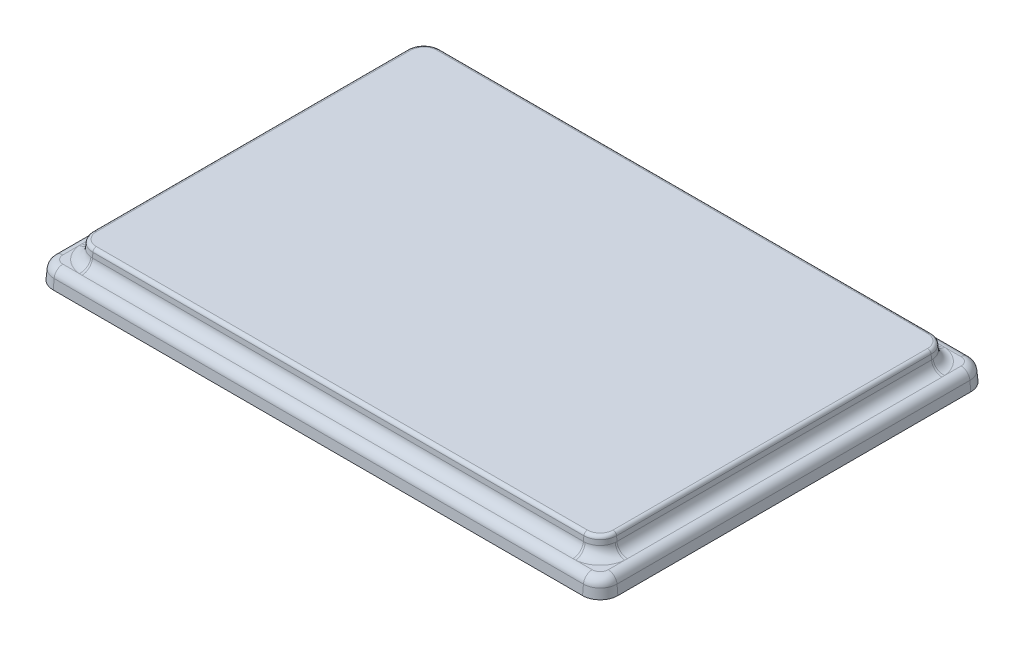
ISO-10303-21;
HEADER;
FILE_DESCRIPTION(('STEP AP214'),'2;1');
FILE_NAME('part.step','',(''),(''),'','','');
FILE_SCHEMA(('AUTOMOTIVE_DESIGN { 1 0 10303 214 1 1 1 1 }'));
ENDSEC;
DATA;
#1=APPLICATION_CONTEXT('core data for automotive mechanical design processes');
#2=APPLICATION_PROTOCOL_DEFINITION('international standard','automotive_design',2000,#1);
#3=PRODUCT_CONTEXT('',#1,'mechanical');
#4=PRODUCT('Part','Part','',(#3));
#5=PRODUCT_RELATED_PRODUCT_CATEGORY('part','',(#4));
#6=PRODUCT_DEFINITION_FORMATION('','',#4);
#7=PRODUCT_DEFINITION_CONTEXT('part definition',#1,'design');
#8=PRODUCT_DEFINITION('design','',#6,#7);
#9=PRODUCT_DEFINITION_SHAPE('','',#8);
#10=(LENGTH_UNIT() NAMED_UNIT(*) SI_UNIT(.MILLI.,.METRE.));
#11=(NAMED_UNIT(*) PLANE_ANGLE_UNIT() SI_UNIT($,.RADIAN.));
#12=(NAMED_UNIT(*) SI_UNIT($,.STERADIAN.) SOLID_ANGLE_UNIT());
#13=UNCERTAINTY_MEASURE_WITH_UNIT(LENGTH_MEASURE(1.E-05),#10,'distance_accuracy_value','');
#14=(GEOMETRIC_REPRESENTATION_CONTEXT(3) GLOBAL_UNCERTAINTY_ASSIGNED_CONTEXT((#13)) GLOBAL_UNIT_ASSIGNED_CONTEXT((#10,
#11,#12)) REPRESENTATION_CONTEXT('',''));
#15=CARTESIAN_POINT('',(0.,0.,0.));
#16=DIRECTION('',(0.,0.,1.));
#17=DIRECTION('',(1.,0.,0.));
#18=AXIS2_PLACEMENT_3D('',#15,#16,#17);
#19=CARTESIAN_POINT('',(75.,5.,-50.));
#20=DIRECTION('',(0.,-1.,0.));
#21=DIRECTION('',(0.,0.,-1.));
#22=AXIS2_PLACEMENT_3D('',#19,#20,#21);
#23=PLANE('',#22);
#24=DIRECTION('',(0.,0.,-1.));
#25=VECTOR('',#24,1.);
#26=CARTESIAN_POINT('',(-77.2717287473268,5.,-50.));
#27=LINE('',#26,#25);
#28=CARTESIAN_POINT('',(-77.2717287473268,5.,-50.));
#29=VERTEX_POINT('',#28);
#30=CARTESIAN_POINT('',(-77.2717287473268,5.,-45.3471372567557));
#31=VERTEX_POINT('',#30);
#32=EDGE_CURVE('E350',#29,#31,#27,.F.);
#33=ORIENTED_EDGE('',*,*,#32,.T.);
#34=CARTESIAN_POINT('',(-69.5625566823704,5.,-44.5625566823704));
#35=DIRECTION('',(0.,-1.,0.));
#36=DIRECTION('',(0.,0.,-1.));
#37=AXIS2_PLACEMENT_3D('',#34,#35,#36);
#38=CIRCLE('',#37,7.74899352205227);
#39=CARTESIAN_POINT('',(-70.347137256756,5.,-52.2717287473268));
#40=VERTEX_POINT('',#39);
#41=EDGE_CURVE('E728',#31,#40,#38,.T.);
#42=ORIENTED_EDGE('',*,*,#41,.T.);
#43=DIRECTION('',(1.,0.,0.));
#44=VECTOR('',#43,1.);
#45=CARTESIAN_POINT('',(75.,5.,-52.2717287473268));
#46=LINE('',#45,#44);
#47=CARTESIAN_POINT('',(-75.,5.,-52.2717287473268));
#48=VERTEX_POINT('',#47);
#49=EDGE_CURVE('E282',#40,#48,#46,.F.);
#50=ORIENTED_EDGE('',*,*,#49,.T.);
#51=CARTESIAN_POINT('',(-75.,5.,-50.));
#52=DIRECTION('',(0.,-1.,0.));
#53=DIRECTION('',(0.,0.,-1.));
#54=AXIS2_PLACEMENT_3D('',#51,#52,#53);
#55=CIRCLE('',#54,2.27172874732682);
#56=EDGE_CURVE('E353',#48,#29,#55,.F.);
#57=ORIENTED_EDGE('',*,*,#56,.T.);
#58=EDGE_LOOP('',(#33,#42,#50,#57));
#59=FACE_BOUND('',#58,.T.);
#60=ADVANCED_FACE('F38',(#59),#23,.F.);
#61=DIRECTION('',(-1.,0.,0.));
#62=VECTOR('',#61,1.);
#63=CARTESIAN_POINT('',(75.,5.,52.2717287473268));
#64=LINE('',#63,#62);
#65=CARTESIAN_POINT('',(-75.,5.,52.2717287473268));
#66=VERTEX_POINT('',#65);
#67=CARTESIAN_POINT('',(-70.347137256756,5.,52.2717287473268));
#68=VERTEX_POINT('',#67);
#69=EDGE_CURVE('E344',#66,#68,#64,.F.);
#70=ORIENTED_EDGE('',*,*,#69,.T.);
#71=CARTESIAN_POINT('',(-69.5625566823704,5.,44.5625566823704));
#72=DIRECTION('',(0.,-1.,0.));
#73=DIRECTION('',(0.,0.,-1.));
#74=AXIS2_PLACEMENT_3D('',#71,#72,#73);
#75=CIRCLE('',#74,7.74899352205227);
#76=CARTESIAN_POINT('',(-77.2717287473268,5.,45.3471372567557));
#77=VERTEX_POINT('',#76);
#78=EDGE_CURVE('E972',#68,#77,#75,.T.);
#79=ORIENTED_EDGE('',*,*,#78,.T.);
#80=CARTESIAN_POINT('',(-77.2717287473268,5.,50.));
#81=VERTEX_POINT('',#80);
#82=EDGE_CURVE('E349',#77,#81,#27,.F.);
#83=ORIENTED_EDGE('',*,*,#82,.T.);
#84=CARTESIAN_POINT('',(-75.,5.,50.));
#85=DIRECTION('',(0.,-1.,0.));
#86=DIRECTION('',(0.,0.,-1.));
#87=AXIS2_PLACEMENT_3D('',#84,#85,#86);
#88=CIRCLE('',#87,2.27172874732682);
#89=EDGE_CURVE('E347',#81,#66,#88,.F.);
#90=ORIENTED_EDGE('',*,*,#89,.T.);
#91=EDGE_LOOP('',(#70,#79,#83,#90));
#92=FACE_BOUND('',#91,.T.);
#93=ADVANCED_FACE('F649',(#92),#23,.F.);
#94=DIRECTION('',(0.,0.,1.));
#95=VECTOR('',#94,1.);
#96=CARTESIAN_POINT('',(77.2717287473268,5.,-50.));
#97=LINE('',#96,#95);
#98=CARTESIAN_POINT('',(77.2717287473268,5.,50.));
#99=VERTEX_POINT('',#98);
#100=CARTESIAN_POINT('',(77.2717287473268,5.,45.3471372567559));
#101=VERTEX_POINT('',#100);
#102=EDGE_CURVE('E338',#99,#101,#97,.F.);
#103=ORIENTED_EDGE('',*,*,#102,.T.);
#104=CARTESIAN_POINT('',(69.5625566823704,5.,44.5625566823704));
#105=DIRECTION('',(0.,-1.,0.));
#106=DIRECTION('',(0.,0.,-1.));
#107=AXIS2_PLACEMENT_3D('',#104,#105,#106);
#108=CIRCLE('',#107,7.74899352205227);
#109=CARTESIAN_POINT('',(70.347137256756,5.,52.2717287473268));
#110=VERTEX_POINT('',#109);
#111=EDGE_CURVE('E681',#101,#110,#108,.T.);
#112=ORIENTED_EDGE('',*,*,#111,.T.);
#113=CARTESIAN_POINT('',(75.,5.,52.2717287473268));
#114=VERTEX_POINT('',#113);
#115=EDGE_CURVE('E343',#110,#114,#64,.F.);
#116=ORIENTED_EDGE('',*,*,#115,.T.);
#117=CARTESIAN_POINT('',(75.,5.,50.));
#118=DIRECTION('',(0.,-1.,0.));
#119=DIRECTION('',(0.,0.,-1.));
#120=AXIS2_PLACEMENT_3D('',#117,#118,#119);
#121=CIRCLE('',#120,2.27172874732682);
#122=EDGE_CURVE('E341',#114,#99,#121,.F.);
#123=ORIENTED_EDGE('',*,*,#122,.T.);
#124=EDGE_LOOP('',(#103,#112,#116,#123));
#125=FACE_BOUND('',#124,.T.);
#126=ADVANCED_FACE('F656',(#125),#23,.F.);
#127=CARTESIAN_POINT('',(75.,5.,-52.2717287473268));
#128=VERTEX_POINT('',#127);
#129=CARTESIAN_POINT('',(70.347137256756,5.,-52.2717287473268));
#130=VERTEX_POINT('',#129);
#131=EDGE_CURVE('E332',#128,#130,#46,.F.);
#132=ORIENTED_EDGE('',*,*,#131,.T.);
#133=CARTESIAN_POINT('',(69.5625566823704,5.,-44.5625566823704));
#134=DIRECTION('',(0.,-1.,0.));
#135=DIRECTION('',(0.,0.,-1.));
#136=AXIS2_PLACEMENT_3D('',#133,#134,#135);
#137=CIRCLE('',#136,7.74899352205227);
#138=CARTESIAN_POINT('',(77.2717287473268,5.,-45.3471372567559));
#139=VERTEX_POINT('',#138);
#140=EDGE_CURVE('E669',#130,#139,#137,.T.);
#141=ORIENTED_EDGE('',*,*,#140,.T.);
#142=CARTESIAN_POINT('',(77.2717287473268,5.,-50.));
#143=VERTEX_POINT('',#142);
#144=EDGE_CURVE('E337',#139,#143,#97,.F.);
#145=ORIENTED_EDGE('',*,*,#144,.T.);
#146=CARTESIAN_POINT('',(75.,5.,-50.));
#147=DIRECTION('',(0.,-1.,0.));
#148=DIRECTION('',(0.,0.,-1.));
#149=AXIS2_PLACEMENT_3D('',#146,#147,#148);
#150=CIRCLE('',#149,2.27172874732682);
#151=EDGE_CURVE('E335',#143,#128,#150,.F.);
#152=ORIENTED_EDGE('',*,*,#151,.T.);
#153=EDGE_LOOP('',(#132,#141,#145,#152));
#154=FACE_BOUND('',#153,.T.);
#155=ADVANCED_FACE('F652',(#154),#23,.F.);
#156=CARTESIAN_POINT('',(75.,0.,-50.));
#157=DIRECTION('',(0.,-1.,0.));
#158=DIRECTION('',(0.,0.,-1.));
#159=AXIS2_PLACEMENT_3D('',#156,#157,#158);
#160=CONICAL_SURFACE('',#159,5.,0.0872664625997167);
#161=DIRECTION('',(0.,-0.996194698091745,-0.0871557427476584));
#162=VECTOR('',#161,1.);
#163=CARTESIAN_POINT('',(75.,0.,-55.));
#164=LINE('',#163,#162);
#165=CARTESIAN_POINT('',(75.,2.71788935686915,-54.7622154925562));
#166=VERTEX_POINT('',#165);
#167=CARTESIAN_POINT('',(75.,0.,-55.));
#168=VERTEX_POINT('',#167);
#169=EDGE_CURVE('E271',#166,#168,#164,.T.);
#170=ORIENTED_EDGE('',*,*,#169,.F.);
#171=CARTESIAN_POINT('',(75.,2.71788935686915,-50.));
#172=DIRECTION('',(0.,1.,0.));
#173=DIRECTION('',(0.,0.,1.));
#174=AXIS2_PLACEMENT_3D('',#171,#172,#173);
#175=CIRCLE('',#174,4.76221549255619);
#176=CARTESIAN_POINT('',(79.7622154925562,2.71788935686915,-50.));
#177=VERTEX_POINT('',#176);
#178=EDGE_CURVE('E369',#166,#177,#175,.F.);
#179=ORIENTED_EDGE('',*,*,#178,.T.);
#180=DIRECTION('',(0.0871557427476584,-0.996194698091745,0.));
#181=VECTOR('',#180,1.);
#182=CARTESIAN_POINT('',(80.,0.,-50.));
#183=LINE('',#182,#181);
#184=CARTESIAN_POINT('',(80.,0.,-50.));
#185=VERTEX_POINT('',#184);
#186=EDGE_CURVE('E296',#177,#185,#183,.T.);
#187=ORIENTED_EDGE('',*,*,#186,.T.);
#188=CARTESIAN_POINT('',(75.,0.,-50.));
#189=DIRECTION('',(0.,1.,0.));
#190=DIRECTION('',(0.,0.,-1.));
#191=AXIS2_PLACEMENT_3D('',#188,#189,#190);
#192=CIRCLE('',#191,5.);
#193=EDGE_CURVE('E289',#185,#168,#192,.T.);
#194=ORIENTED_EDGE('',*,*,#193,.T.);
#195=EDGE_LOOP('',(#170,#179,#187,#194));
#196=FACE_BOUND('',#195,.T.);
#197=ADVANCED_FACE('F294',(#196),#160,.T.);
#198=CARTESIAN_POINT('',(-75.,0.,-55.));
#199=DIRECTION('',(0.,0.0871557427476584,-0.996194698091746));
#200=DIRECTION('',(0.,0.996194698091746,0.0871557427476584));
#201=AXIS2_PLACEMENT_3D('',#198,#199,#200);
#202=PLANE('',#201);
#203=DIRECTION('',(0.,-0.996194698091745,-0.0871557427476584));
#204=VECTOR('',#203,1.);
#205=CARTESIAN_POINT('',(-75.,0.,-55.));
#206=LINE('',#205,#204);
#207=CARTESIAN_POINT('',(-75.,2.71788935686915,-54.7622154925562));
#208=VERTEX_POINT('',#207);
#209=CARTESIAN_POINT('',(-75.,0.,-55.));
#210=VERTEX_POINT('',#209);
#211=EDGE_CURVE('E283',#208,#210,#206,.T.);
#212=ORIENTED_EDGE('',*,*,#211,.F.);
#213=DIRECTION('',(-1.,0.,0.));
#214=VECTOR('',#213,1.);
#215=CARTESIAN_POINT('',(-75.,2.71788935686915,-54.7622154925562));
#216=LINE('',#215,#214);
#217=EDGE_CURVE('E278',#208,#166,#216,.F.);
#218=ORIENTED_EDGE('',*,*,#217,.T.);
#219=ORIENTED_EDGE('',*,*,#169,.T.);
#220=DIRECTION('',(-1.,0.,0.));
#221=VECTOR('',#220,1.);
#222=CARTESIAN_POINT('',(-75.,0.,-55.));
#223=LINE('',#222,#221);
#224=EDGE_CURVE('E275',#168,#210,#223,.T.);
#225=ORIENTED_EDGE('',*,*,#224,.T.);
#226=EDGE_LOOP('',(#212,#218,#219,#225));
#227=FACE_BOUND('',#226,.T.);
#228=ADVANCED_FACE('F274',(#227),#202,.T.);
#229=CARTESIAN_POINT('',(-75.,0.,-50.));
#230=DIRECTION('',(0.,-1.,0.));
#231=DIRECTION('',(0.,0.,-1.));
#232=AXIS2_PLACEMENT_3D('',#229,#230,#231);
#233=CONICAL_SURFACE('',#232,5.,0.0872664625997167);
#234=DIRECTION('',(-0.0871557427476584,-0.996194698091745,0.));
#235=VECTOR('',#234,1.);
#236=CARTESIAN_POINT('',(-80.,0.,-50.));
#237=LINE('',#236,#235);
#238=CARTESIAN_POINT('',(-79.7622154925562,2.71788935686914,-50.));
#239=VERTEX_POINT('',#238);
#240=CARTESIAN_POINT('',(-80.,0.,-50.));
#241=VERTEX_POINT('',#240);
#242=EDGE_CURVE('E329',#239,#241,#237,.T.);
#243=ORIENTED_EDGE('',*,*,#242,.F.);
#244=CARTESIAN_POINT('',(-75.,2.71788935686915,-50.));
#245=DIRECTION('',(0.,1.,0.));
#246=DIRECTION('',(0.,0.,1.));
#247=AXIS2_PLACEMENT_3D('',#244,#245,#246);
#248=CIRCLE('',#247,4.76221549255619);
#249=EDGE_CURVE('E356',#239,#208,#248,.F.);
#250=ORIENTED_EDGE('',*,*,#249,.T.);
#251=ORIENTED_EDGE('',*,*,#211,.T.);
#252=CARTESIAN_POINT('',(-75.,0.,-50.));
#253=DIRECTION('',(0.,1.,0.));
#254=DIRECTION('',(0.,0.,-1.));
#255=AXIS2_PLACEMENT_3D('',#252,#253,#254);
#256=CIRCLE('',#255,5.);
#257=EDGE_CURVE('E292',#210,#241,#256,.T.);
#258=ORIENTED_EDGE('',*,*,#257,.T.);
#259=EDGE_LOOP('',(#243,#250,#251,#258));
#260=FACE_BOUND('',#259,.T.);
#261=ADVANCED_FACE('F993',(#260),#233,.T.);
#262=CARTESIAN_POINT('',(-80.,0.,50.));
#263=DIRECTION('',(-0.996194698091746,0.0871557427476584,0.));
#264=DIRECTION('',(-0.0871557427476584,-0.996194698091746,0.));
#265=AXIS2_PLACEMENT_3D('',#262,#263,#264);
#266=PLANE('',#265);
#267=DIRECTION('',(-0.0871557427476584,-0.996194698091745,0.));
#268=VECTOR('',#267,1.);
#269=CARTESIAN_POINT('',(-80.,0.,50.));
#270=LINE('',#269,#268);
#271=CARTESIAN_POINT('',(-79.7622154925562,2.71788935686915,50.));
#272=VERTEX_POINT('',#271);
#273=CARTESIAN_POINT('',(-80.,0.,50.));
#274=VERTEX_POINT('',#273);
#275=EDGE_CURVE('E327',#272,#274,#270,.T.);
#276=ORIENTED_EDGE('',*,*,#275,.F.);
#277=DIRECTION('',(0.,0.,1.));
#278=VECTOR('',#277,1.);
#279=CARTESIAN_POINT('',(-79.7622154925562,2.71788935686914,50.));
#280=LINE('',#279,#278);
#281=EDGE_CURVE('E359',#272,#239,#280,.F.);
#282=ORIENTED_EDGE('',*,*,#281,.T.);
#283=ORIENTED_EDGE('',*,*,#242,.T.);
#284=DIRECTION('',(0.,0.,1.));
#285=VECTOR('',#284,1.);
#286=CARTESIAN_POINT('',(-80.,0.,50.));
#287=LINE('',#286,#285);
#288=EDGE_CURVE('E306',#241,#274,#287,.T.);
#289=ORIENTED_EDGE('',*,*,#288,.T.);
#290=EDGE_LOOP('',(#276,#282,#283,#289));
#291=FACE_BOUND('',#290,.T.);
#292=ADVANCED_FACE('F990',(#291),#266,.T.);
#293=CARTESIAN_POINT('',(-75.,0.,50.));
#294=DIRECTION('',(0.,-1.,0.));
#295=DIRECTION('',(0.,0.,-1.));
#296=AXIS2_PLACEMENT_3D('',#293,#294,#295);
#297=CONICAL_SURFACE('',#296,5.,0.0872664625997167);
#298=DIRECTION('',(0.,-0.996194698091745,0.0871557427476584));
#299=VECTOR('',#298,1.);
#300=CARTESIAN_POINT('',(-75.,0.,55.));
#301=LINE('',#300,#299);
#302=CARTESIAN_POINT('',(-75.,2.71788935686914,54.7622154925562));
#303=VERTEX_POINT('',#302);
#304=CARTESIAN_POINT('',(-75.,0.,55.));
#305=VERTEX_POINT('',#304);
#306=EDGE_CURVE('E325',#303,#305,#301,.T.);
#307=ORIENTED_EDGE('',*,*,#306,.F.);
#308=CARTESIAN_POINT('',(-75.,2.71788935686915,50.));
#309=DIRECTION('',(0.,1.,0.));
#310=DIRECTION('',(0.,0.,1.));
#311=AXIS2_PLACEMENT_3D('',#308,#309,#310);
#312=CIRCLE('',#311,4.76221549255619);
#313=EDGE_CURVE('E361',#303,#272,#312,.F.);
#314=ORIENTED_EDGE('',*,*,#313,.T.);
#315=ORIENTED_EDGE('',*,*,#275,.T.);
#316=CARTESIAN_POINT('',(-75.,0.,50.));
#317=DIRECTION('',(0.,1.,0.));
#318=DIRECTION('',(0.,0.,-1.));
#319=AXIS2_PLACEMENT_3D('',#316,#317,#318);
#320=CIRCLE('',#319,5.);
#321=EDGE_CURVE('E309',#274,#305,#320,.T.);
#322=ORIENTED_EDGE('',*,*,#321,.T.);
#323=EDGE_LOOP('',(#307,#314,#315,#322));
#324=FACE_BOUND('',#323,.T.);
#325=ADVANCED_FACE('F1023',(#324),#297,.T.);
#326=CARTESIAN_POINT('',(-75.,0.,55.));
#327=DIRECTION('',(0.,0.0871557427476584,0.996194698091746));
#328=DIRECTION('',(0.,-0.996194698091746,0.0871557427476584));
#329=AXIS2_PLACEMENT_3D('',#326,#327,#328);
#330=PLANE('',#329);
#331=DIRECTION('',(0.,-0.996194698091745,0.0871557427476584));
#332=VECTOR('',#331,1.);
#333=CARTESIAN_POINT('',(75.,0.,55.));
#334=LINE('',#333,#332);
#335=CARTESIAN_POINT('',(75.,2.71788935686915,54.7622154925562));
#336=VERTEX_POINT('',#335);
#337=CARTESIAN_POINT('',(75.,0.,55.));
#338=VERTEX_POINT('',#337);
#339=EDGE_CURVE('E323',#336,#338,#334,.T.);
#340=ORIENTED_EDGE('',*,*,#339,.F.);
#341=DIRECTION('',(1.,0.,0.));
#342=VECTOR('',#341,1.);
#343=CARTESIAN_POINT('',(-75.,2.71788935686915,54.7622154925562));
#344=LINE('',#343,#342);
#345=EDGE_CURVE('E363',#336,#303,#344,.F.);
#346=ORIENTED_EDGE('',*,*,#345,.T.);
#347=ORIENTED_EDGE('',*,*,#306,.T.);
#348=DIRECTION('',(1.,0.,0.));
#349=VECTOR('',#348,1.);
#350=CARTESIAN_POINT('',(-75.,0.,55.));
#351=LINE('',#350,#349);
#352=EDGE_CURVE('E312',#305,#338,#351,.T.);
#353=ORIENTED_EDGE('',*,*,#352,.T.);
#354=EDGE_LOOP('',(#340,#346,#347,#353));
#355=FACE_BOUND('',#354,.T.);
#356=ADVANCED_FACE('F1017',(#355),#330,.T.);
#357=CARTESIAN_POINT('',(75.,0.,50.));
#358=DIRECTION('',(0.,-1.,0.));
#359=DIRECTION('',(0.,0.,1.));
#360=AXIS2_PLACEMENT_3D('',#357,#358,#359);
#361=CONICAL_SURFACE('',#360,5.,0.0872664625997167);
#362=DIRECTION('',(0.0871557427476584,-0.996194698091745,0.));
#363=VECTOR('',#362,1.);
#364=CARTESIAN_POINT('',(80.,0.,50.));
#365=LINE('',#364,#363);
#366=CARTESIAN_POINT('',(79.7622154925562,2.71788935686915,50.));
#367=VERTEX_POINT('',#366);
#368=CARTESIAN_POINT('',(80.,0.,50.));
#369=VERTEX_POINT('',#368);
#370=EDGE_CURVE('E321',#367,#369,#365,.T.);
#371=ORIENTED_EDGE('',*,*,#370,.F.);
#372=CARTESIAN_POINT('',(75.,2.71788935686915,50.));
#373=DIRECTION('',(0.,1.,0.));
#374=DIRECTION('',(0.,0.,1.));
#375=AXIS2_PLACEMENT_3D('',#372,#373,#374);
#376=CIRCLE('',#375,4.76221549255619);
#377=EDGE_CURVE('E365',#367,#336,#376,.F.);
#378=ORIENTED_EDGE('',*,*,#377,.T.);
#379=ORIENTED_EDGE('',*,*,#339,.T.);
#380=CARTESIAN_POINT('',(75.,0.,50.));
#381=DIRECTION('',(0.,1.,0.));
#382=DIRECTION('',(0.,0.,1.));
#383=AXIS2_PLACEMENT_3D('',#380,#381,#382);
#384=CIRCLE('',#383,5.);
#385=EDGE_CURVE('E315',#338,#369,#384,.T.);
#386=ORIENTED_EDGE('',*,*,#385,.T.);
#387=EDGE_LOOP('',(#371,#378,#379,#386));
#388=FACE_BOUND('',#387,.T.);
#389=ADVANCED_FACE('F1015',(#388),#361,.T.);
#390=CARTESIAN_POINT('',(80.,0.,50.));
#391=DIRECTION('',(0.996194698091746,0.0871557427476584,0.));
#392=DIRECTION('',(-0.0871557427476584,0.996194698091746,0.));
#393=AXIS2_PLACEMENT_3D('',#390,#391,#392);
#394=PLANE('',#393);
#395=ORIENTED_EDGE('',*,*,#186,.F.);
#396=DIRECTION('',(0.,0.,-1.));
#397=VECTOR('',#396,1.);
#398=CARTESIAN_POINT('',(79.7622154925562,2.71788935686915,50.));
#399=LINE('',#398,#397);
#400=EDGE_CURVE('E367',#177,#367,#399,.F.);
#401=ORIENTED_EDGE('',*,*,#400,.T.);
#402=ORIENTED_EDGE('',*,*,#370,.T.);
#403=DIRECTION('',(0.,0.,-1.));
#404=VECTOR('',#403,1.);
#405=CARTESIAN_POINT('',(80.,0.,50.));
#406=LINE('',#405,#404);
#407=EDGE_CURVE('E318',#369,#185,#406,.T.);
#408=ORIENTED_EDGE('',*,*,#407,.T.);
#409=EDGE_LOOP('',(#395,#401,#402,#408));
#410=FACE_BOUND('',#409,.T.);
#411=ADVANCED_FACE('F1003',(#410),#394,.T.);
#412=CARTESIAN_POINT('',(75.,0.,-50.));
#413=DIRECTION('',(0.,-1.,0.));
#414=DIRECTION('',(0.,0.,-1.));
#415=AXIS2_PLACEMENT_3D('',#412,#413,#414);
#416=PLANE('',#415);
#417=ORIENTED_EDGE('',*,*,#193,.F.);
#418=ORIENTED_EDGE('',*,*,#407,.F.);
#419=ORIENTED_EDGE('',*,*,#385,.F.);
#420=ORIENTED_EDGE('',*,*,#352,.F.);
#421=ORIENTED_EDGE('',*,*,#321,.F.);
#422=ORIENTED_EDGE('',*,*,#288,.F.);
#423=ORIENTED_EDGE('',*,*,#257,.F.);
#424=ORIENTED_EDGE('',*,*,#224,.F.);
#425=EDGE_LOOP('',(#417,#418,#419,#420,#421,#422,#423,#424));
#426=FACE_BOUND('',#425,.T.);
#427=ADVANCED_FACE('F287',(#426),#416,.T.);
#428=CARTESIAN_POINT('',(69.5625566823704,5.,44.5625566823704));
#429=DIRECTION('',(0.,-1.,0.));
#430=DIRECTION('',(0.,0.,1.));
#431=AXIS2_PLACEMENT_3D('',#428,#429,#430);
#432=CONICAL_SURFACE('',#431,5.,0.0872664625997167);
#433=DIRECTION('',(0.0871557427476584,-0.996194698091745,0.));
#434=VECTOR('',#433,1.);
#435=CARTESIAN_POINT('',(74.5625566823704,5.,44.5625566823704));
#436=LINE('',#435,#434);
#437=CARTESIAN_POINT('',(74.2049768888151,9.08715574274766,44.5625566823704));
#438=VERTEX_POINT('',#437);
#439=CARTESIAN_POINT('',(74.3229787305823,7.73838851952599,44.5625566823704));
#440=VERTEX_POINT('',#439);
#441=EDGE_CURVE('E298',#438,#440,#436,.T.);
#442=ORIENTED_EDGE('',*,*,#441,.F.);
#443=CARTESIAN_POINT('',(69.5625566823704,9.08715574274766,44.5625566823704));
#444=DIRECTION('',(0.,-1.,0.));
#445=DIRECTION('',(0.,0.,-1.));
#446=AXIS2_PLACEMENT_3D('',#443,#444,#445);
#447=CIRCLE('',#446,4.6424202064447);
#448=CARTESIAN_POINT('',(69.5625566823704,9.08715574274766,49.2049768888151));
#449=VERTEX_POINT('',#448);
#450=EDGE_CURVE('E879',#438,#449,#447,.T.);
#451=ORIENTED_EDGE('',*,*,#450,.T.);
#452=DIRECTION('',(0.,-0.996194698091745,0.0871557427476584));
#453=VECTOR('',#452,1.);
#454=CARTESIAN_POINT('',(69.5625566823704,5.,49.5625566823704));
#455=LINE('',#454,#453);
#456=CARTESIAN_POINT('',(69.5625566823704,7.73838851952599,49.3229787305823));
#457=VERTEX_POINT('',#456);
#458=EDGE_CURVE('E396',#449,#457,#455,.T.);
#459=ORIENTED_EDGE('',*,*,#458,.T.);
#460=CARTESIAN_POINT('',(68.0979541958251,7.72831822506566,49.09300330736));
#461=CARTESIAN_POINT('',(68.0718281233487,4.82642035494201,49.3513774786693));
#462=CARTESIAN_POINT('',(67.178649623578,4.9953570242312,52.1194352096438));
#463=CARTESIAN_POINT('',(68.2163318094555,7.73203536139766,49.1309425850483));
#464=CARTESIAN_POINT('',(68.1827707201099,4.85955423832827,49.3828708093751));
#465=CARTESIAN_POINT('',(67.371271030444,4.99704663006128,52.1475937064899));
#466=CARTESIAN_POINT('',(68.3361770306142,7.73436944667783,49.1643437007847));
#467=CARTESIAN_POINT('',(68.2993005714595,4.88828298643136,49.4121315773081));
#468=CARTESIAN_POINT('',(67.5663138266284,4.99810757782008,52.1723627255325));
#469=CARTESIAN_POINT('',(68.5781444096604,7.7373324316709,49.2218347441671));
#470=CARTESIAN_POINT('',(68.5394365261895,4.9369265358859,49.4638928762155));
#471=CARTESIAN_POINT('',(67.9601412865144,4.99945438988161,52.2149716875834));
#472=CARTESIAN_POINT('',(68.7002676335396,7.73796051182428,49.2459201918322));
#473=CARTESIAN_POINT('',(68.6632677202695,4.95695995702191,49.4865009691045));
#474=CARTESIAN_POINT('',(68.1589277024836,4.99973988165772,52.2328082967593));
#475=CARTESIAN_POINT('',(68.9454125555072,7.73856936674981,49.2844130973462));
#476=CARTESIAN_POINT('',(68.9150061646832,4.98858661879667,49.5230781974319));
#477=CARTESIAN_POINT('',(68.5579692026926,5.00001663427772,52.2613046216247));
#478=CARTESIAN_POINT('',(69.0684268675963,7.73855331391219,49.2988676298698));
#479=CARTESIAN_POINT('',(69.0431743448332,5.00030230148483,49.5371776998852));
#480=CARTESIAN_POINT('',(68.7582122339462,5.00000933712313,52.2719992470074));
#481=CARTESIAN_POINT('',(69.3151525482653,7.73846401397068,49.3181475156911));
#482=CARTESIAN_POINT('',(69.3015924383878,5.01583663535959,49.5560259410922));
#483=CARTESIAN_POINT('',(69.1598325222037,4.99996874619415,52.2862623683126));
#484=CARTESIAN_POINT('',(69.4388635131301,7.73839079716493,49.3229779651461));
#485=CARTESIAN_POINT('',(69.4321684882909,5.01969996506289,49.5608281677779));
#486=CARTESIAN_POINT('',(69.3612091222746,4.99993546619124,52.2898346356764));
#487=CARTESIAN_POINT('',(69.6430306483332,7.73838703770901,49.3229792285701));
#488=CARTESIAN_POINT('',(69.6473863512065,5.01969987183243,49.5608364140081));
#489=CARTESIAN_POINT('',(69.6935520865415,4.99993375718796,52.2898354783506));
#490=CARTESIAN_POINT('',(69.7234970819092,7.73841558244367,49.3209354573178));
#491=CARTESIAN_POINT('',(69.7322557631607,5.01806519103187,49.5588099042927));
#492=CARTESIAN_POINT('',(69.8245351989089,4.99994673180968,52.2883239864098));
#493=CARTESIAN_POINT('',(69.8842237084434,7.73848777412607,49.3127714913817));
#494=CARTESIAN_POINT('',(69.9012255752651,5.01151305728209,49.5507822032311));
#495=CARTESIAN_POINT('',(70.0861659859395,4.99997954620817,52.2822852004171));
#496=CARTESIAN_POINT('',(69.964483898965,7.73853142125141,49.3066512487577));
#497=CARTESIAN_POINT('',(69.9854181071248,5.00658833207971,49.5447721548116));
#498=CARTESIAN_POINT('',(70.2168136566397,4.99999938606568,52.2777578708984));
#499=CARTESIAN_POINT('',(70.1676035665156,7.73853484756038,49.2859780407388));
#500=CARTESIAN_POINT('',(70.197329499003,4.9898450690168,49.52466988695));
#501=CARTESIAN_POINT('',(70.5474519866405,5.00000094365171,52.2624616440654));
#502=CARTESIAN_POINT('',(70.2901918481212,7.73843699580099,49.2686614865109));
#503=CARTESIAN_POINT('',(70.3242105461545,4.97571472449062,49.5079360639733));
#504=CARTESIAN_POINT('',(70.7470010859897,4.99995646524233,52.2496464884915));
#505=CARTESIAN_POINT('',(70.5337167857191,7.73733115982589,49.2246025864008));
#506=CARTESIAN_POINT('',(70.5721450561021,4.93923092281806,49.4666351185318));
#507=CARTESIAN_POINT('',(71.1433981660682,4.99945381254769,52.2170199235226));
#508=CARTESIAN_POINT('',(70.6546525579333,7.73632270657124,49.1978553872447));
#509=CARTESIAN_POINT('',(70.6934634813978,4.91677973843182,49.4419669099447));
#510=CARTESIAN_POINT('',(71.3402447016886,4.99899542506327,52.1972049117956));
#511=CARTESIAN_POINT('',(70.8946958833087,7.73232029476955,49.1350323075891));
#512=CARTESIAN_POINT('',(70.9284993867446,4.8630637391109,49.3864753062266));
#513=CARTESIAN_POINT('',(71.7309202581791,4.99717614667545,52.1506260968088));
#514=CARTESIAN_POINT('',(71.0137918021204,7.72931678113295,49.0989120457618));
#515=CARTESIAN_POINT('',(71.0423702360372,4.83162320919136,49.3555097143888));
#516=CARTESIAN_POINT('',(71.924730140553,4.99581091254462,52.1238292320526));
#517=CARTESIAN_POINT('',(71.2488228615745,7.71982487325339,49.0177864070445));
#518=CARTESIAN_POINT('',(71.25992723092,4.75970528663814,49.2901586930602));
#519=CARTESIAN_POINT('',(72.3071019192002,4.9914964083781,52.0635865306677));
#520=CARTESIAN_POINT('',(71.3647592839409,7.71333791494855,48.9727846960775));
#521=CARTESIAN_POINT('',(71.3637218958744,4.71906450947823,49.2556740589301));
#522=CARTESIAN_POINT('',(72.4956659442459,4.98854779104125,52.0301434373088));
#523=CARTESIAN_POINT('',(71.4787996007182,7.70436397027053,48.9235177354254));
#524=CARTESIAN_POINT('',(71.4606278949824,4.67398743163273,49.2210922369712));
#525=CARTESIAN_POINT('',(72.6810615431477,4.98446872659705,51.9934929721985));
#526=(BOUNDED_SURFACE() B_SPLINE_SURFACE(3,2,((#460,#461,#462),(#463,#464,#465),(#466,#467,
#468),(#469,#470,#471),(#472,#473,#474),(#475,#476,#477),(#478,#479,#480),(#481,#482,#483),
(#484,#485,#486),(#487,#488,#489),(#490,#491,#492),(#493,#494,#495),(#496,#497,#498),(#499,#500,
#501),(#502,#503,#504),(#505,#506,#507),(#508,#509,#510),(#511,#512,#513),(#514,#515,#516),
(#517,#518,#519),(#520,#521,#522),(#523,#524,#525)),.UNSPECIFIED.,.F.,.F.,
.F.) B_SPLINE_SURFACE_WITH_KNOTS((4,2,2,2,2,2,2,2,2,2,4),(3,3),(0.,0.6069591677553,
1.21420986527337,1.81847018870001,2.42241045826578,2.81533004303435,3.20825424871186,
3.81220093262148,4.41645887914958,5.02363191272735,5.63055485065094),(0.,1.),
.UNSPECIFIED.) GEOMETRIC_REPRESENTATION_ITEM() RATIONAL_B_SPLINE_SURFACE(((1.,0.717373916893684,
1.),(1.,0.720950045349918,1.),(1.,0.724149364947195,1.),(1.,0.729712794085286,1.),(1.,
0.732076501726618,1.),(1.,0.735874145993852,1.),(1.,0.737312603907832,1.),(1.,0.739234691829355,
1.),(1.,0.739718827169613,1.),(1.,0.73971914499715,1.),(1.,0.739514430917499,1.),(1.,
0.738698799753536,1.),(1.,0.738087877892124,1.),(1.,0.736031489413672,1.),(1.,0.73431403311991,
1.),(1.,0.729988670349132,1.),(1.,0.727380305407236,1.),(1.,0.721341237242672,1.),(1.,
0.717906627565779,1.),(1.,0.710349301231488,1.),(1.,0.706226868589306,1.),(1.,0.701822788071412,1.))) REPRESENTATION_ITEM('') SURFACE());
#527=CARTESIAN_POINT('',(68.0979541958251,7.72831822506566,49.09300330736));
#528=CARTESIAN_POINT('',(68.2163318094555,7.73203536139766,49.1309425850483));
#529=CARTESIAN_POINT('',(68.3361770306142,7.73436944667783,49.1643437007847));
#530=CARTESIAN_POINT('',(68.5781444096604,7.73733243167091,49.2218347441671));
#531=CARTESIAN_POINT('',(68.7002676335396,7.73796051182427,49.2459201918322));
#532=CARTESIAN_POINT('',(68.9454125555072,7.73856936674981,49.2844130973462));
#533=CARTESIAN_POINT('',(69.0684268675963,7.73855331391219,49.2988676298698));
#534=CARTESIAN_POINT('',(69.3151525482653,7.73846401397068,49.3181475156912));
#535=CARTESIAN_POINT('',(69.4388635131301,7.73839079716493,49.3229779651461));
#536=CARTESIAN_POINT('',(69.6430306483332,7.73838703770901,49.3229792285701));
#537=CARTESIAN_POINT('',(69.7234970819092,7.73841558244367,49.3209354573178));
#538=CARTESIAN_POINT('',(69.8842237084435,7.73848777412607,49.3127714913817));
#539=CARTESIAN_POINT('',(69.964483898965,7.73853142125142,49.3066512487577));
#540=CARTESIAN_POINT('',(70.1676035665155,7.73853484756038,49.2859780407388));
#541=CARTESIAN_POINT('',(70.2901918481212,7.73843699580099,49.2686614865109));
#542=CARTESIAN_POINT('',(70.5337167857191,7.73733115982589,49.2246025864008));
#543=CARTESIAN_POINT('',(70.6546525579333,7.73632270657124,49.1978553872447));
#544=CARTESIAN_POINT('',(70.8946958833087,7.73232029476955,49.1350323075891));
#545=CARTESIAN_POINT('',(71.0137918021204,7.72931678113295,49.0989120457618));
#546=CARTESIAN_POINT('',(71.2488228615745,7.71982487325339,49.0177864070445));
#547=CARTESIAN_POINT('',(71.3647592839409,7.71333791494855,48.9727846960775));
#548=CARTESIAN_POINT('',(71.4787996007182,7.70436397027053,48.9235177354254));
#549=B_SPLINE_CURVE_WITH_KNOTS('',3,(#527,#528,#529,#530,#531,#532,#533,#534,#535,#536,#537,
#538,#539,#540,#541,#542,#543,#544,#545,#546,#547,#548),.UNSPECIFIED.,.F.,.F.,(4,2,2,2,2,2,2,2,
2,2,4),(0.,0.6069591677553,1.21420986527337,1.81847018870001,2.42241045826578,2.81533004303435,
3.20825424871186,3.81220093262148,4.41645887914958,5.02363191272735,5.63055485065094),.UNSPECIFIED.);
#550=CARTESIAN_POINT('',(70.0445450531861,7.73853277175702,49.2985027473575));
#551=VERTEX_POINT('',#550);
#552=EDGE_CURVE('E797',#457,#551,#549,.T.);
#553=ORIENTED_EDGE('',*,*,#552,.T.);
#554=CARTESIAN_POINT('',(69.5625566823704,7.73853277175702,44.5625566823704));
#555=DIRECTION('',(0.,-1.,0.));
#556=DIRECTION('',(0.,0.,-1.));
#557=AXIS2_PLACEMENT_3D('',#554,#555,#556);
#558=CIRCLE('',#557,4.76040942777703);
#559=CARTESIAN_POINT('',(74.2985027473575,7.73853277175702,45.0445450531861));
#560=VERTEX_POINT('',#559);
#561=EDGE_CURVE('E795',#551,#560,#558,.F.);
#562=ORIENTED_EDGE('',*,*,#561,.T.);
#563=CARTESIAN_POINT('',(73.9235177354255,7.70436397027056,46.4787996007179));
#564=CARTESIAN_POINT('',(74.2210922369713,4.67398743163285,46.4606278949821));
#565=CARTESIAN_POINT('',(76.9934929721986,4.98446872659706,47.6810615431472));
#566=CARTESIAN_POINT('',(73.9727846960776,7.71333791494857,46.3647592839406));
#567=CARTESIAN_POINT('',(74.2556740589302,4.71906450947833,46.3637218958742));
#568=CARTESIAN_POINT('',(77.0301434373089,4.98854779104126,47.4956659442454));
#569=CARTESIAN_POINT('',(74.0177864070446,7.7198248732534,46.2488228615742));
#570=CARTESIAN_POINT('',(74.2901586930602,4.75970528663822,46.2599272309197));
#571=CARTESIAN_POINT('',(77.0635865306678,4.99149640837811,47.3071019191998));
#572=CARTESIAN_POINT('',(74.0989120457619,7.72931678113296,46.0137918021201));
#573=CARTESIAN_POINT('',(74.3555097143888,4.83162320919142,46.042370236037));
#574=CARTESIAN_POINT('',(77.1238292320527,4.99581091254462,46.9247301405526));
#575=CARTESIAN_POINT('',(74.1350323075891,7.73232029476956,45.8946958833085));
#576=CARTESIAN_POINT('',(74.3864753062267,4.86306373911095,45.9284993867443));
#577=CARTESIAN_POINT('',(77.1506260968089,4.99717614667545,46.7309202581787));
#578=CARTESIAN_POINT('',(74.1978553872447,7.73632270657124,45.6546525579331));
#579=CARTESIAN_POINT('',(74.4419669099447,4.91677973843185,45.6934634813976));
#580=CARTESIAN_POINT('',(77.1972049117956,4.99899542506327,46.3402447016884));
#581=CARTESIAN_POINT('',(74.2246025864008,7.73733115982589,45.5337167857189));
#582=CARTESIAN_POINT('',(74.4666351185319,4.93923092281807,45.5721450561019));
#583=CARTESIAN_POINT('',(77.2170199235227,4.99945381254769,46.1433981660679));
#584=CARTESIAN_POINT('',(74.2686614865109,7.73843699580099,45.2901918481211));
#585=CARTESIAN_POINT('',(74.5079360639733,4.97571472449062,45.3242105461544));
#586=CARTESIAN_POINT('',(77.2496464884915,4.99995646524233,45.7470010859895));
#587=CARTESIAN_POINT('',(74.2859780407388,7.73853484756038,45.1676035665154));
#588=CARTESIAN_POINT('',(74.5246698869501,4.9898450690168,45.1973294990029));
#589=CARTESIAN_POINT('',(77.2624616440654,5.00000094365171,45.5474519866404));
#590=CARTESIAN_POINT('',(74.3066512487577,7.73853142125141,44.964483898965));
#591=CARTESIAN_POINT('',(74.5447721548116,5.00658833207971,44.9854181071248));
#592=CARTESIAN_POINT('',(77.2777578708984,4.99999938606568,45.2168136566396));
#593=CARTESIAN_POINT('',(74.3127714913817,7.73848777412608,44.8842237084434));
#594=CARTESIAN_POINT('',(74.5507822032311,5.0115130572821,44.901225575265));
#595=CARTESIAN_POINT('',(77.2822852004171,4.99997954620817,45.0861659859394));
#596=CARTESIAN_POINT('',(74.3209354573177,7.73841558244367,44.7234970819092));
#597=CARTESIAN_POINT('',(74.5588099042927,5.01806519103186,44.7322557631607));
#598=CARTESIAN_POINT('',(77.2883239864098,4.99994673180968,44.8245351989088));
#599=CARTESIAN_POINT('',(74.3229792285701,7.738387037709,44.6430306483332));
#600=CARTESIAN_POINT('',(74.5608364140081,5.01969987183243,44.6473863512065));
#601=CARTESIAN_POINT('',(77.2898354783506,4.99993375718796,44.6935520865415));
#602=CARTESIAN_POINT('',(74.3229779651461,7.73839079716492,44.4388635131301));
#603=CARTESIAN_POINT('',(74.5608281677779,5.01969996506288,44.432168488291));
#604=CARTESIAN_POINT('',(77.2898346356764,4.99993546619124,44.3612091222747));
#605=CARTESIAN_POINT('',(74.3181475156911,7.73846401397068,44.3151525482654));
#606=CARTESIAN_POINT('',(74.5560259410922,5.01583663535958,44.3015924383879));
#607=CARTESIAN_POINT('',(77.2862623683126,4.99996874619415,44.1598325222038));
#608=CARTESIAN_POINT('',(74.2988676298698,7.73855331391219,44.0684268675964));
#609=CARTESIAN_POINT('',(74.5371776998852,5.00030230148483,44.0431743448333));
#610=CARTESIAN_POINT('',(77.2719992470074,5.00000933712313,43.7582122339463));
#611=CARTESIAN_POINT('',(74.2844130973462,7.73856936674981,43.9454125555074));
#612=CARTESIAN_POINT('',(74.5230781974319,4.98858661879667,43.9150061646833));
#613=CARTESIAN_POINT('',(77.2613046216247,5.00001663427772,43.5579692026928));
#614=CARTESIAN_POINT('',(74.2459201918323,7.73796051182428,43.7002676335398));
#615=CARTESIAN_POINT('',(74.4865009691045,4.95695995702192,43.6632677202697));
#616=CARTESIAN_POINT('',(77.2328082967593,4.99973988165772,43.1589277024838));
#617=CARTESIAN_POINT('',(74.2218347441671,7.73733243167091,43.5781444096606));
#618=CARTESIAN_POINT('',(74.4638928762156,4.93692653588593,43.5394365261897));
#619=CARTESIAN_POINT('',(77.2149716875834,4.99945438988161,42.9601412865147));
#620=CARTESIAN_POINT('',(74.1643437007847,7.73436944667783,43.3361770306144));
#621=CARTESIAN_POINT('',(74.4121315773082,4.88828298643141,43.2993005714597));
#622=CARTESIAN_POINT('',(77.1723627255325,4.99810757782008,42.5663138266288));
#623=CARTESIAN_POINT('',(74.1309425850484,7.73203536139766,43.2163318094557));
#624=CARTESIAN_POINT('',(74.3828708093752,4.85955423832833,43.1827707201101));
#625=CARTESIAN_POINT('',(77.1475937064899,4.99704663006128,42.3712710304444));
#626=CARTESIAN_POINT('',(74.0930033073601,7.72831822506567,43.0979541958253));
#627=CARTESIAN_POINT('',(74.3513774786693,4.82642035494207,43.0718281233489));
#628=CARTESIAN_POINT('',(77.1194352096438,4.9953570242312,42.1786496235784));
#629=(BOUNDED_SURFACE() B_SPLINE_SURFACE(3,2,((#563,#564,#565),(#566,#567,#568),(#569,#570,
#571),(#572,#573,#574),(#575,#576,#577),(#578,#579,#580),(#581,#582,#583),(#584,#585,#586),
(#587,#588,#589),(#590,#591,#592),(#593,#594,#595),(#596,#597,#598),(#599,#600,#601),(#602,#603,
#604),(#605,#606,#607),(#608,#609,#610),(#611,#612,#613),(#614,#615,#616),(#617,#618,#619),
(#620,#621,#622),(#623,#624,#625),(#626,#627,#628)),.UNSPECIFIED.,.F.,.F.,
.F.) B_SPLINE_SURFACE_WITH_KNOTS((4,2,2,2,2,2,2,2,2,2,4),(3,3),(0.,0.606922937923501,
1.21409597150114,1.81835391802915,2.42230060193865,2.81522480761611,3.2081443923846,
3.81208466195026,4.4163449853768,5.02359568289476,5.63055485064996),(0.,1.),
.UNSPECIFIED.) GEOMETRIC_REPRESENTATION_ITEM() RATIONAL_B_SPLINE_SURFACE(((1.,0.701822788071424,
1.),(1.,0.706226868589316,1.),(1.,0.710349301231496,1.),(1.,0.717906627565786,1.),(1.,
0.721341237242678,1.),(1.,0.72738030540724,1.),(1.,0.729988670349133,1.),(1.,0.73431403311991,
1.),(1.,0.736031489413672,1.),(1.,0.738087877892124,1.),(1.,0.738698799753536,1.),(1.,
0.739514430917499,1.),(1.,0.73971914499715,1.),(1.,0.739718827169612,1.),(1.,0.739234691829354,
1.),(1.,0.737312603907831,1.),(1.,0.735874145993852,1.),(1.,0.73207650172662,1.),(1.,
0.729712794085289,1.),(1.,0.724149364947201,1.),(1.,0.720950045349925,1.),(1.,0.717373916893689,1.))) REPRESENTATION_ITEM('') SURFACE());
#630=CARTESIAN_POINT('',(73.9235177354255,7.70436397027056,46.4787996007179));
#631=CARTESIAN_POINT('',(73.9727846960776,7.71333791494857,46.3647592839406));
#632=CARTESIAN_POINT('',(74.0177864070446,7.7198248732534,46.2488228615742));
#633=CARTESIAN_POINT('',(74.0989120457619,7.72931678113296,46.0137918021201));
#634=CARTESIAN_POINT('',(74.1350323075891,7.73232029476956,45.8946958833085));
#635=CARTESIAN_POINT('',(74.1978553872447,7.73632270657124,45.6546525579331));
#636=CARTESIAN_POINT('',(74.2246025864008,7.73733115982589,45.5337167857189));
#637=CARTESIAN_POINT('',(74.2686614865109,7.73843699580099,45.2901918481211));
#638=CARTESIAN_POINT('',(74.2859780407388,7.73853484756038,45.1676035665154));
#639=CARTESIAN_POINT('',(74.3066512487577,7.73853142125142,44.964483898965));
#640=CARTESIAN_POINT('',(74.3127714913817,7.73848777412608,44.8842237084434));
#641=CARTESIAN_POINT('',(74.3209354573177,7.73841558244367,44.7234970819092));
#642=CARTESIAN_POINT('',(74.3229792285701,7.738387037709,44.6430306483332));
#643=CARTESIAN_POINT('',(74.3229779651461,7.73839079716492,44.4388635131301));
#644=CARTESIAN_POINT('',(74.3181475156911,7.73846401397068,44.3151525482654));
#645=CARTESIAN_POINT('',(74.2988676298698,7.73855331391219,44.0684268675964));
#646=CARTESIAN_POINT('',(74.2844130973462,7.73856936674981,43.9454125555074));
#647=CARTESIAN_POINT('',(74.2459201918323,7.73796051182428,43.7002676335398));
#648=CARTESIAN_POINT('',(74.2218347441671,7.73733243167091,43.5781444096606));
#649=CARTESIAN_POINT('',(74.1643437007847,7.73436944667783,43.3361770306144));
#650=CARTESIAN_POINT('',(74.1309425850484,7.73203536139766,43.2163318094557));
#651=CARTESIAN_POINT('',(74.0930033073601,7.72831822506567,43.0979541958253));
#652=B_SPLINE_CURVE_WITH_KNOTS('',3,(#630,#631,#632,#633,#634,#635,#636,#637,#638,#639,#640,
#641,#642,#643,#644,#645,#646,#647,#648,#649,#650,#651),.UNSPECIFIED.,.F.,.F.,(4,2,2,2,2,2,2,2,
2,2,4),(0.,0.606922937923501,1.21409597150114,1.81835391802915,2.42230060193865,
2.81522480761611,3.2081443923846,3.81208466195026,4.4163449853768,5.02359568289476,
5.63055485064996),.UNSPECIFIED.);
#653=EDGE_CURVE('E788',#560,#440,#652,.T.);
#654=ORIENTED_EDGE('',*,*,#653,.T.);
#655=EDGE_LOOP('',(#442,#451,#459,#553,#562,#654));
#656=FACE_BOUND('',#655,.T.);
#657=ADVANCED_FACE('F575',(#656),#432,.T.);
#658=CARTESIAN_POINT('',(74.5625566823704,5.,44.5625566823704));
#659=DIRECTION('',(0.996194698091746,0.0871557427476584,0.));
#660=DIRECTION('',(-0.0871557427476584,0.996194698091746,0.));
#661=AXIS2_PLACEMENT_3D('',#658,#659,#660);
#662=PLANE('',#661);
#663=DIRECTION('',(0.0871557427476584,-0.996194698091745,0.));
#664=VECTOR('',#663,1.);
#665=CARTESIAN_POINT('',(74.5625566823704,5.,-44.5625566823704));
#666=LINE('',#665,#664);
#667=CARTESIAN_POINT('',(74.2049768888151,9.08715574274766,-44.5625566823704));
#668=VERTEX_POINT('',#667);
#669=CARTESIAN_POINT('',(74.3229787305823,7.73838851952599,-44.5625566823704));
#670=VERTEX_POINT('',#669);
#671=EDGE_CURVE('E300',#668,#670,#666,.T.);
#672=ORIENTED_EDGE('',*,*,#671,.F.);
#673=DIRECTION('',(0.,0.,-1.));
#674=VECTOR('',#673,1.);
#675=CARTESIAN_POINT('',(74.2049768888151,9.08715574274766,44.5625566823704));
#676=LINE('',#675,#674);
#677=EDGE_CURVE('E877',#668,#438,#676,.F.);
#678=ORIENTED_EDGE('',*,*,#677,.T.);
#679=ORIENTED_EDGE('',*,*,#441,.T.);
#680=DIRECTION('',(0.,0.,-1.));
#681=VECTOR('',#680,1.);
#682=CARTESIAN_POINT('',(74.3229787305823,7.73838851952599,44.5625566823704));
#683=LINE('',#682,#681);
#684=EDGE_CURVE('E823',#440,#670,#683,.T.);
#685=ORIENTED_EDGE('',*,*,#684,.T.);
#686=EDGE_LOOP('',(#672,#678,#679,#685));
#687=FACE_BOUND('',#686,.T.);
#688=ADVANCED_FACE('F1027',(#687),#662,.T.);
#689=CARTESIAN_POINT('',(69.5625566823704,5.,-44.5625566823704));
#690=DIRECTION('',(0.,-1.,0.));
#691=DIRECTION('',(0.,0.,-1.));
#692=AXIS2_PLACEMENT_3D('',#689,#690,#691);
#693=CONICAL_SURFACE('',#692,5.,0.0872664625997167);
#694=DIRECTION('',(0.,-0.996194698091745,-0.0871557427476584));
#695=VECTOR('',#694,1.);
#696=CARTESIAN_POINT('',(69.5625566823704,5.,-49.5625566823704));
#697=LINE('',#696,#695);
#698=CARTESIAN_POINT('',(69.5625566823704,9.08715574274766,-49.2049768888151));
#699=VERTEX_POINT('',#698);
#700=CARTESIAN_POINT('',(69.5625566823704,7.73838851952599,-49.3229787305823));
#701=VERTEX_POINT('',#700);
#702=EDGE_CURVE('E920',#699,#701,#697,.T.);
#703=ORIENTED_EDGE('',*,*,#702,.F.);
#704=CARTESIAN_POINT('',(69.5625566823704,9.08715574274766,-44.5625566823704));
#705=DIRECTION('',(0.,-1.,0.));
#706=DIRECTION('',(0.,0.,-1.));
#707=AXIS2_PLACEMENT_3D('',#704,#705,#706);
#708=CIRCLE('',#707,4.6424202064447);
#709=EDGE_CURVE('E875',#699,#668,#708,.T.);
#710=ORIENTED_EDGE('',*,*,#709,.T.);
#711=ORIENTED_EDGE('',*,*,#671,.T.);
#712=CARTESIAN_POINT('',(74.0930033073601,7.72831822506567,-43.0979541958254));
#713=CARTESIAN_POINT('',(74.3513774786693,4.82642035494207,-43.0718281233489));
#714=CARTESIAN_POINT('',(77.1194352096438,4.9953570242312,-42.1786496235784));
#715=CARTESIAN_POINT('',(74.1309425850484,7.73203536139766,-43.2163318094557));
#716=CARTESIAN_POINT('',(74.3828708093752,4.85955423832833,-43.1827707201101));
#717=CARTESIAN_POINT('',(77.1475937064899,4.99704663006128,-42.3712710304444));
#718=CARTESIAN_POINT('',(74.1643437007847,7.73436944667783,-43.3361770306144));
#719=CARTESIAN_POINT('',(74.4121315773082,4.88828298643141,-43.2993005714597));
#720=CARTESIAN_POINT('',(77.1723627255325,4.99810757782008,-42.5663138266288));
#721=CARTESIAN_POINT('',(74.2218347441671,7.73733243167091,-43.5781444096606));
#722=CARTESIAN_POINT('',(74.4638928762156,4.93692653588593,-43.5394365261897));
#723=CARTESIAN_POINT('',(77.2149716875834,4.99945438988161,-42.9601412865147));
#724=CARTESIAN_POINT('',(74.2459201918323,7.73796051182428,-43.7002676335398));
#725=CARTESIAN_POINT('',(74.4865009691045,4.95695995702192,-43.6632677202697));
#726=CARTESIAN_POINT('',(77.2328082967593,4.99973988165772,-43.1589277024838));
#727=CARTESIAN_POINT('',(74.2844130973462,7.73856936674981,-43.9454125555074));
#728=CARTESIAN_POINT('',(74.5230781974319,4.98858661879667,-43.9150061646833));
#729=CARTESIAN_POINT('',(77.2613046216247,5.00001663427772,-43.5579692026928));
#730=CARTESIAN_POINT('',(74.2988676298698,7.73855331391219,-44.0684268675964));
#731=CARTESIAN_POINT('',(74.5371776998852,5.00030230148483,-44.0431743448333));
#732=CARTESIAN_POINT('',(77.2719992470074,5.00000933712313,-43.7582122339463));
#733=CARTESIAN_POINT('',(74.3181475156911,7.73846401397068,-44.3151525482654));
#734=CARTESIAN_POINT('',(74.5560259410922,5.01583663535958,-44.3015924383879));
#735=CARTESIAN_POINT('',(77.2862623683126,4.99996874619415,-44.1598325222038));
#736=CARTESIAN_POINT('',(74.3229779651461,7.73839079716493,-44.4388635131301));
#737=CARTESIAN_POINT('',(74.5608281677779,5.01969996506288,-44.432168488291));
#738=CARTESIAN_POINT('',(77.2898346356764,4.99993546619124,-44.3612091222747));
#739=CARTESIAN_POINT('',(74.3229792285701,7.73838703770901,-44.6430306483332));
#740=CARTESIAN_POINT('',(74.5608364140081,5.01969987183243,-44.6473863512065));
#741=CARTESIAN_POINT('',(77.2898354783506,4.99993375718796,-44.6935520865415));
#742=CARTESIAN_POINT('',(74.3209354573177,7.73841558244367,-44.7234970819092));
#743=CARTESIAN_POINT('',(74.5588099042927,5.01806519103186,-44.7322557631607));
#744=CARTESIAN_POINT('',(77.2883239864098,4.99994673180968,-44.8245351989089));
#745=CARTESIAN_POINT('',(74.3127714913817,7.73848777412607,-44.8842237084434));
#746=CARTESIAN_POINT('',(74.5507822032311,5.0115130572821,-44.901225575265));
#747=CARTESIAN_POINT('',(77.2822852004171,4.99997954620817,-45.0861659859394));
#748=CARTESIAN_POINT('',(74.3066512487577,7.73853142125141,-44.964483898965));
#749=CARTESIAN_POINT('',(74.5447721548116,5.00658833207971,-44.9854181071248));
#750=CARTESIAN_POINT('',(77.2777578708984,4.99999938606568,-45.2168136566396));
#751=CARTESIAN_POINT('',(74.2859780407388,7.73853484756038,-45.1676035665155));
#752=CARTESIAN_POINT('',(74.5246698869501,4.9898450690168,-45.1973294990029));
#753=CARTESIAN_POINT('',(77.2624616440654,5.00000094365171,-45.5474519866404));
#754=CARTESIAN_POINT('',(74.2686614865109,7.73843699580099,-45.2901918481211));
#755=CARTESIAN_POINT('',(74.5079360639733,4.97571472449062,-45.3242105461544));
#756=CARTESIAN_POINT('',(77.2496464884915,4.99995646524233,-45.7470010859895));
#757=CARTESIAN_POINT('',(74.2246025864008,7.73733115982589,-45.5337167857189));
#758=CARTESIAN_POINT('',(74.4666351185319,4.93923092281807,-45.5721450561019));
#759=CARTESIAN_POINT('',(77.2170199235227,4.99945381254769,-46.1433981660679));
#760=CARTESIAN_POINT('',(74.1978553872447,7.73632270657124,-45.6546525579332));
#761=CARTESIAN_POINT('',(74.4419669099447,4.91677973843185,-45.6934634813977));
#762=CARTESIAN_POINT('',(77.1972049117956,4.99899542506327,-46.3402447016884));
#763=CARTESIAN_POINT('',(74.1350323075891,7.73232029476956,-45.8946958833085));
#764=CARTESIAN_POINT('',(74.3864753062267,4.86306373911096,-45.9284993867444));
#765=CARTESIAN_POINT('',(77.1506260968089,4.99717614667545,-46.7309202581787));
#766=CARTESIAN_POINT('',(74.0989120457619,7.72931678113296,-46.0137918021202));
#767=CARTESIAN_POINT('',(74.3555097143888,4.83162320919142,-46.042370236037));
#768=CARTESIAN_POINT('',(77.1238292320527,4.99581091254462,-46.9247301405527));
#769=CARTESIAN_POINT('',(74.0177864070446,7.7198248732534,-46.2488228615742));
#770=CARTESIAN_POINT('',(74.2901586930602,4.75970528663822,-46.2599272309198));
#771=CARTESIAN_POINT('',(77.0635865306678,4.99149640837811,-47.3071019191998));
#772=CARTESIAN_POINT('',(73.9727846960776,7.71333791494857,-46.3647592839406));
#773=CARTESIAN_POINT('',(74.2556740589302,4.71906450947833,-46.3637218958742));
#774=CARTESIAN_POINT('',(77.0301434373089,4.98854779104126,-47.4956659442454));
#775=CARTESIAN_POINT('',(73.9235177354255,7.70436397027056,-46.4787996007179));
#776=CARTESIAN_POINT('',(74.2210922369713,4.67398743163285,-46.4606278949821));
#777=CARTESIAN_POINT('',(76.9934929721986,4.98446872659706,-47.6810615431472));
#778=(BOUNDED_SURFACE() B_SPLINE_SURFACE(3,2,((#712,#713,#714),(#715,#716,#717),(#718,#719,
#720),(#721,#722,#723),(#724,#725,#726),(#727,#728,#729),(#730,#731,#732),(#733,#734,#735),
(#736,#737,#738),(#739,#740,#741),(#742,#743,#744),(#745,#746,#747),(#748,#749,#750),(#751,#752,
#753),(#754,#755,#756),(#757,#758,#759),(#760,#761,#762),(#763,#764,#765),(#766,#767,#768),
(#769,#770,#771),(#772,#773,#774),(#775,#776,#777)),.UNSPECIFIED.,.F.,.F.,
.F.) B_SPLINE_SURFACE_WITH_KNOTS((4,2,2,2,2,2,2,2,2,2,4),(3,3),(0.,0.606959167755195,
1.21420986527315,1.8184701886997,2.42241045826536,2.81533004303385,3.20825424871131,
3.8122009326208,4.41645887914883,5.02363191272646,5.63055485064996),(0.,1.),
.UNSPECIFIED.) GEOMETRIC_REPRESENTATION_ITEM() RATIONAL_B_SPLINE_SURFACE(((1.,0.717373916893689,
1.),(1.,0.720950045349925,1.),(1.,0.724149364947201,1.),(1.,0.729712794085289,1.),(1.,
0.73207650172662,1.),(1.,0.735874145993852,1.),(1.,0.737312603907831,1.),(1.,0.739234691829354,
1.),(1.,0.739718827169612,1.),(1.,0.73971914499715,1.),(1.,0.739514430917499,1.),(1.,
0.738698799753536,1.),(1.,0.738087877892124,1.),(1.,0.736031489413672,1.),(1.,0.73431403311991,
1.),(1.,0.729988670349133,1.),(1.,0.72738030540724,1.),(1.,0.721341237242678,1.),(1.,
0.717906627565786,1.),(1.,0.710349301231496,1.),(1.,0.706226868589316,1.),(1.,0.701822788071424,1.))) REPRESENTATION_ITEM('') SURFACE());
#779=CARTESIAN_POINT('',(74.0930033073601,7.72831822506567,-43.0979541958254));
#780=CARTESIAN_POINT('',(74.1309425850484,7.73203536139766,-43.2163318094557));
#781=CARTESIAN_POINT('',(74.1643437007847,7.73436944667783,-43.3361770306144));
#782=CARTESIAN_POINT('',(74.2218347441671,7.73733243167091,-43.5781444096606));
#783=CARTESIAN_POINT('',(74.2459201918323,7.73796051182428,-43.7002676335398));
#784=CARTESIAN_POINT('',(74.2844130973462,7.73856936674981,-43.9454125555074));
#785=CARTESIAN_POINT('',(74.2988676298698,7.73855331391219,-44.0684268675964));
#786=CARTESIAN_POINT('',(74.3181475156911,7.73846401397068,-44.3151525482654));
#787=CARTESIAN_POINT('',(74.3229779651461,7.73839079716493,-44.4388635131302));
#788=CARTESIAN_POINT('',(74.3229792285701,7.73838703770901,-44.6430306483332));
#789=CARTESIAN_POINT('',(74.3209354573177,7.73841558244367,-44.7234970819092));
#790=CARTESIAN_POINT('',(74.3127714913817,7.73848777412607,-44.8842237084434));
#791=CARTESIAN_POINT('',(74.3066512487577,7.73853142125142,-44.964483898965));
#792=CARTESIAN_POINT('',(74.2859780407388,7.73853484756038,-45.1676035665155));
#793=CARTESIAN_POINT('',(74.2686614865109,7.73843699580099,-45.2901918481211));
#794=CARTESIAN_POINT('',(74.2246025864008,7.73733115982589,-45.5337167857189));
#795=CARTESIAN_POINT('',(74.1978553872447,7.73632270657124,-45.6546525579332));
#796=CARTESIAN_POINT('',(74.1350323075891,7.73232029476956,-45.8946958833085));
#797=CARTESIAN_POINT('',(74.0989120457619,7.72931678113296,-46.0137918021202));
#798=CARTESIAN_POINT('',(74.0177864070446,7.7198248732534,-46.2488228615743));
#799=CARTESIAN_POINT('',(73.9727846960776,7.71333791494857,-46.3647592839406));
#800=CARTESIAN_POINT('',(73.9235177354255,7.70436397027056,-46.4787996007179));
#801=B_SPLINE_CURVE_WITH_KNOTS('',3,(#779,#780,#781,#782,#783,#784,#785,#786,#787,#788,#789,
#790,#791,#792,#793,#794,#795,#796,#797,#798,#799,#800),.UNSPECIFIED.,.F.,.F.,(4,2,2,2,2,2,2,2,
2,2,4),(0.,0.606959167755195,1.21420986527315,1.8184701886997,2.42241045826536,2.81533004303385,
3.20825424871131,3.8122009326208,4.41645887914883,5.02363191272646,5.63055485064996),.UNSPECIFIED.);
#802=CARTESIAN_POINT('',(74.2985027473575,7.73853277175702,-45.0445450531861));
#803=VERTEX_POINT('',#802);
#804=EDGE_CURVE('E833',#670,#803,#801,.T.);
#805=ORIENTED_EDGE('',*,*,#804,.T.);
#806=CARTESIAN_POINT('',(69.5625566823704,7.73853277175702,-44.5625566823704));
#807=DIRECTION('',(0.,-1.,0.));
#808=DIRECTION('',(0.,0.,-1.));
#809=AXIS2_PLACEMENT_3D('',#806,#807,#808);
#810=CIRCLE('',#809,4.76040942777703);
#811=CARTESIAN_POINT('',(70.0445450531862,7.73853277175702,-49.2985027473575));
#812=VERTEX_POINT('',#811);
#813=EDGE_CURVE('E831',#803,#812,#810,.F.);
#814=ORIENTED_EDGE('',*,*,#813,.T.);
#815=CARTESIAN_POINT('',(71.4787996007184,7.70436397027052,-48.9235177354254));
#816=CARTESIAN_POINT('',(71.4606278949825,4.67398743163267,-49.2210922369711));
#817=CARTESIAN_POINT('',(72.6810615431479,4.98446872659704,-51.9934929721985));
#818=CARTESIAN_POINT('',(71.364759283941,7.71333791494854,-48.9727846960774));
#819=CARTESIAN_POINT('',(71.3637218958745,4.71906450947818,-49.2556740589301));
#820=CARTESIAN_POINT('',(72.4956659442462,4.98854779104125,-52.0301434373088));
#821=CARTESIAN_POINT('',(71.2488228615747,7.71982487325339,-49.0177864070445));
#822=CARTESIAN_POINT('',(71.2599272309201,4.7597052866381,-49.2901586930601));
#823=CARTESIAN_POINT('',(72.3071019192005,4.9914964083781,-52.0635865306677));
#824=CARTESIAN_POINT('',(71.0137918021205,7.72931678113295,-49.0989120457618));
#825=CARTESIAN_POINT('',(71.0423702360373,4.83162320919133,-49.3555097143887));
#826=CARTESIAN_POINT('',(71.9247301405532,4.99581091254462,-52.1238292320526));
#827=CARTESIAN_POINT('',(70.8946958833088,7.73232029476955,-49.135032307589));
#828=CARTESIAN_POINT('',(70.9284993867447,4.86306373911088,-49.3864753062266));
#829=CARTESIAN_POINT('',(71.7309202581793,4.99717614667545,-52.1506260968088));
#830=CARTESIAN_POINT('',(70.6546525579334,7.73632270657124,-49.1978553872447));
#831=CARTESIAN_POINT('',(70.6934634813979,4.9167797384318,-49.4419669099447));
#832=CARTESIAN_POINT('',(71.3402447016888,4.99899542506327,-52.1972049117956));
#833=CARTESIAN_POINT('',(70.5337167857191,7.73733115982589,-49.2246025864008));
#834=CARTESIAN_POINT('',(70.5721450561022,4.93923092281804,-49.4666351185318));
#835=CARTESIAN_POINT('',(71.1433981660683,4.99945381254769,-52.2170199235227));
#836=CARTESIAN_POINT('',(70.2901918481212,7.73843699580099,-49.2686614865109));
#837=CARTESIAN_POINT('',(70.3242105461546,4.97571472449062,-49.5079360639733));
#838=CARTESIAN_POINT('',(70.7470010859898,4.99995646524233,-52.2496464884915));
#839=CARTESIAN_POINT('',(70.1676035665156,7.73853484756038,-49.2859780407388));
#840=CARTESIAN_POINT('',(70.1973294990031,4.9898450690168,-49.5246698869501));
#841=CARTESIAN_POINT('',(70.5474519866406,5.00000094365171,-52.2624616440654));
#842=CARTESIAN_POINT('',(69.9644838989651,7.73853142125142,-49.3066512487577));
#843=CARTESIAN_POINT('',(69.9854181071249,5.00658833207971,-49.5447721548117));
#844=CARTESIAN_POINT('',(70.2168136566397,4.99999938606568,-52.2777578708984));
#845=CARTESIAN_POINT('',(69.8842237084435,7.73848777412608,-49.3127714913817));
#846=CARTESIAN_POINT('',(69.9012255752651,5.01151305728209,-49.5507822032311));
#847=CARTESIAN_POINT('',(70.0861659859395,4.99997954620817,-52.2822852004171));
#848=CARTESIAN_POINT('',(69.7234970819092,7.73841558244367,-49.3209354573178));
#849=CARTESIAN_POINT('',(69.7322557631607,5.01806519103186,-49.5588099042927));
#850=CARTESIAN_POINT('',(69.8245351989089,4.99994673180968,-52.2883239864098));
#851=CARTESIAN_POINT('',(69.6430306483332,7.73838703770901,-49.3229792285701));
#852=CARTESIAN_POINT('',(69.6473863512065,5.01969987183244,-49.5608364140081));
#853=CARTESIAN_POINT('',(69.6935520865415,4.99993375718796,-52.2898354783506));
#854=CARTESIAN_POINT('',(69.4388635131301,7.73839079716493,-49.3229779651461));
#855=CARTESIAN_POINT('',(69.4321684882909,5.0196999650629,-49.560828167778));
#856=CARTESIAN_POINT('',(69.3612091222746,4.99993546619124,-52.2898346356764));
#857=CARTESIAN_POINT('',(69.3151525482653,7.73846401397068,-49.3181475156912));
#858=CARTESIAN_POINT('',(69.3015924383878,5.0158366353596,-49.5560259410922));
#859=CARTESIAN_POINT('',(69.1598325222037,4.99996874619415,-52.2862623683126));
#860=CARTESIAN_POINT('',(69.0684268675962,7.73855331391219,-49.2988676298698));
#861=CARTESIAN_POINT('',(69.0431743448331,5.00030230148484,-49.5371776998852));
#862=CARTESIAN_POINT('',(68.7582122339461,5.00000933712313,-52.2719992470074));
#863=CARTESIAN_POINT('',(68.9454125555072,7.73856936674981,-49.2844130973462));
#864=CARTESIAN_POINT('',(68.9150061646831,4.98858661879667,-49.5230781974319));
#865=CARTESIAN_POINT('',(68.5579692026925,5.00001663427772,-52.2613046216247));
#866=CARTESIAN_POINT('',(68.7002676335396,7.73796051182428,-49.2459201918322));
#867=CARTESIAN_POINT('',(68.6632677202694,4.9569599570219,-49.4865009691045));
#868=CARTESIAN_POINT('',(68.1589277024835,4.99973988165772,-52.2328082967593));
#869=CARTESIAN_POINT('',(68.5781444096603,7.7373324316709,-49.2218347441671));
#870=CARTESIAN_POINT('',(68.5394365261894,4.93692653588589,-49.4638928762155));
#871=CARTESIAN_POINT('',(67.9601412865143,4.99945438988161,-52.2149716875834));
#872=CARTESIAN_POINT('',(68.3361770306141,7.73436944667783,-49.1643437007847));
#873=CARTESIAN_POINT('',(68.2993005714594,4.88828298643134,-49.4121315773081));
#874=CARTESIAN_POINT('',(67.5663138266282,4.99810757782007,-52.1723627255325));
#875=CARTESIAN_POINT('',(68.2163318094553,7.73203536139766,-49.1309425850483));
#876=CARTESIAN_POINT('',(68.1827707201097,4.85955423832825,-49.3828708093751));
#877=CARTESIAN_POINT('',(67.3712710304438,4.99704663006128,-52.1475937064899));
#878=CARTESIAN_POINT('',(68.097954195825,7.72831822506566,-49.09300330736));
#879=CARTESIAN_POINT('',(68.0718281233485,4.82642035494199,-49.3513774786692));
#880=CARTESIAN_POINT('',(67.1786496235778,4.9953570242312,-52.1194352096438));
#881=(BOUNDED_SURFACE() B_SPLINE_SURFACE(3,2,((#815,#816,#817),(#818,#819,#820),(#821,#822,
#823),(#824,#825,#826),(#827,#828,#829),(#830,#831,#832),(#833,#834,#835),(#836,#837,#838),
(#839,#840,#841),(#842,#843,#844),(#845,#846,#847),(#848,#849,#850),(#851,#852,#853),(#854,#855,
#856),(#857,#858,#859),(#860,#861,#862),(#863,#864,#865),(#866,#867,#868),(#869,#870,#871),
(#872,#873,#874),(#875,#876,#877),(#878,#879,#880)),.UNSPECIFIED.,.F.,.F.,
.F.) B_SPLINE_SURFACE_WITH_KNOTS((4,2,2,2,2,2,2,2,2,2,4),(3,3),(0.,0.606922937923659,
1.21409597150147,1.81835391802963,2.42230060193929,2.81522480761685,3.20814439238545,
3.81208466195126,4.41634498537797,5.02359568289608,5.63055485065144),(0.,1.),
.UNSPECIFIED.) GEOMETRIC_REPRESENTATION_ITEM() RATIONAL_B_SPLINE_SURFACE(((1.,0.701822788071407,
1.),(1.,0.706226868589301,1.),(1.,0.710349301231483,1.),(1.,0.717906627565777,1.),(1.,
0.72134123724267,1.),(1.,0.727380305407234,1.),(1.,0.72998867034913,1.),(1.,0.734314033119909,
1.),(1.,0.736031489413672,1.),(1.,0.738087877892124,1.),(1.,0.738698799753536,1.),(1.,
0.739514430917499,1.),(1.,0.739719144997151,1.),(1.,0.739718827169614,1.),(1.,0.739234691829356,
1.),(1.,0.737312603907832,1.),(1.,0.735874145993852,1.),(1.,0.732076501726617,1.),(1.,
0.729712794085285,1.),(1.,0.724149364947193,1.),(1.,0.720950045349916,1.),(1.,0.717373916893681,1.))) REPRESENTATION_ITEM('') SURFACE());
#882=CARTESIAN_POINT('',(71.4787996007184,7.70436397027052,-48.9235177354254));
#883=CARTESIAN_POINT('',(71.3647592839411,7.71333791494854,-48.9727846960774));
#884=CARTESIAN_POINT('',(71.2488228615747,7.71982487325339,-49.0177864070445));
#885=CARTESIAN_POINT('',(71.0137918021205,7.72931678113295,-49.0989120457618));
#886=CARTESIAN_POINT('',(70.8946958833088,7.73232029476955,-49.135032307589));
#887=CARTESIAN_POINT('',(70.6546525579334,7.73632270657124,-49.1978553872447));
#888=CARTESIAN_POINT('',(70.5337167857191,7.73733115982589,-49.2246025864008));
#889=CARTESIAN_POINT('',(70.2901918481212,7.73843699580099,-49.2686614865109));
#890=CARTESIAN_POINT('',(70.1676035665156,7.73853484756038,-49.2859780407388));
#891=CARTESIAN_POINT('',(69.9644838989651,7.73853142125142,-49.3066512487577));
#892=CARTESIAN_POINT('',(69.8842237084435,7.73848777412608,-49.3127714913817));
#893=CARTESIAN_POINT('',(69.7234970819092,7.73841558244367,-49.3209354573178));
#894=CARTESIAN_POINT('',(69.6430306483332,7.73838703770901,-49.3229792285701));
#895=CARTESIAN_POINT('',(69.4388635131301,7.73839079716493,-49.3229779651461));
#896=CARTESIAN_POINT('',(69.3151525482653,7.73846401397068,-49.3181475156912));
#897=CARTESIAN_POINT('',(69.0684268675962,7.73855331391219,-49.2988676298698));
#898=CARTESIAN_POINT('',(68.9454125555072,7.73856936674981,-49.2844130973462));
#899=CARTESIAN_POINT('',(68.7002676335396,7.73796051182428,-49.2459201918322));
#900=CARTESIAN_POINT('',(68.5781444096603,7.7373324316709,-49.2218347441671));
#901=CARTESIAN_POINT('',(68.3361770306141,7.73436944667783,-49.1643437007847));
#902=CARTESIAN_POINT('',(68.2163318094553,7.73203536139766,-49.1309425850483));
#903=CARTESIAN_POINT('',(68.097954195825,7.72831822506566,-49.09300330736));
#904=B_SPLINE_CURVE_WITH_KNOTS('',3,(#882,#883,#884,#885,#886,#887,#888,#889,#890,#891,#892,
#893,#894,#895,#896,#897,#898,#899,#900,#901,#902,#903),.UNSPECIFIED.,.F.,.F.,(4,2,2,2,2,2,2,2,
2,2,4),(0.,0.606922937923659,1.21409597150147,1.81835391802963,2.42230060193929,
2.81522480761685,3.20814439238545,3.81208466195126,4.41634498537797,5.02359568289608,
5.63055485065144),.UNSPECIFIED.);
#905=EDGE_CURVE('E689',#812,#701,#904,.T.);
#906=ORIENTED_EDGE('',*,*,#905,.T.);
#907=EDGE_LOOP('',(#703,#710,#711,#805,#814,#906));
#908=FACE_BOUND('',#907,.T.);
#909=ADVANCED_FACE('F461',(#908),#693,.T.);
#910=CARTESIAN_POINT('',(69.5625566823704,5.,-49.5625566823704));
#911=DIRECTION('',(0.,0.0871557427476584,-0.996194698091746));
#912=DIRECTION('',(0.,0.996194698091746,0.0871557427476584));
#913=AXIS2_PLACEMENT_3D('',#910,#911,#912);
#914=PLANE('',#913);
#915=DIRECTION('',(0.,-0.996194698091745,-0.0871557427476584));
#916=VECTOR('',#915,1.);
#917=CARTESIAN_POINT('',(-69.5625566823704,5.,-49.5625566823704));
#918=LINE('',#917,#916);
#919=CARTESIAN_POINT('',(-69.5625566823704,9.08715574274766,-49.2049768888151));
#920=VERTEX_POINT('',#919);
#921=CARTESIAN_POINT('',(-69.5625566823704,7.73838851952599,-49.3229787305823));
#922=VERTEX_POINT('',#921);
#923=EDGE_CURVE('E921',#920,#922,#918,.T.);
#924=ORIENTED_EDGE('',*,*,#923,.F.);
#925=DIRECTION('',(-1.,0.,0.));
#926=VECTOR('',#925,1.);
#927=CARTESIAN_POINT('',(69.5625566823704,9.08715574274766,-49.2049768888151));
#928=LINE('',#927,#926);
#929=EDGE_CURVE('E873',#920,#699,#928,.F.);
#930=ORIENTED_EDGE('',*,*,#929,.T.);
#931=ORIENTED_EDGE('',*,*,#702,.T.);
#932=DIRECTION('',(-1.,0.,0.));
#933=VECTOR('',#932,1.);
#934=CARTESIAN_POINT('',(69.5625566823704,7.73838851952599,-49.3229787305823));
#935=LINE('',#934,#933);
#936=EDGE_CURVE('E839',#701,#922,#935,.T.);
#937=ORIENTED_EDGE('',*,*,#936,.T.);
#938=EDGE_LOOP('',(#924,#930,#931,#937));
#939=FACE_BOUND('',#938,.T.);
#940=ADVANCED_FACE('F919',(#939),#914,.T.);
#941=CARTESIAN_POINT('',(-69.5625566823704,5.,-44.5625566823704));
#942=DIRECTION('',(0.,-1.,0.));
#943=DIRECTION('',(0.,0.,1.));
#944=AXIS2_PLACEMENT_3D('',#941,#942,#943);
#945=CONICAL_SURFACE('',#944,5.,0.0872664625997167);
#946=DIRECTION('',(-0.0871557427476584,-0.996194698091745,0.));
#947=VECTOR('',#946,1.);
#948=CARTESIAN_POINT('',(-74.5625566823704,5.,-44.5625566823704));
#949=LINE('',#948,#947);
#950=CARTESIAN_POINT('',(-74.2049768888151,9.08715574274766,-44.5625566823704));
#951=VERTEX_POINT('',#950);
#952=CARTESIAN_POINT('',(-74.3229787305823,7.73838851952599,-44.5625566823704));
#953=VERTEX_POINT('',#952);
#954=EDGE_CURVE('E730',#951,#953,#949,.T.);
#955=ORIENTED_EDGE('',*,*,#954,.F.);
#956=CARTESIAN_POINT('',(-69.5625566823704,9.08715574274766,-44.5625566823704));
#957=DIRECTION('',(0.,-1.,0.));
#958=DIRECTION('',(0.,0.,-1.));
#959=AXIS2_PLACEMENT_3D('',#956,#957,#958);
#960=CIRCLE('',#959,4.6424202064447);
#961=EDGE_CURVE('E47',#951,#920,#960,.T.);
#962=ORIENTED_EDGE('',*,*,#961,.T.);
#963=ORIENTED_EDGE('',*,*,#923,.T.);
#964=CARTESIAN_POINT('',(-68.097954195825,7.72831822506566,-49.09300330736));
#965=CARTESIAN_POINT('',(-68.0718281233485,4.82642035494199,-49.3513774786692));
#966=CARTESIAN_POINT('',(-67.1786496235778,4.9953570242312,-52.1194352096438));
#967=CARTESIAN_POINT('',(-68.2163318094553,7.73203536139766,-49.1309425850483));
#968=CARTESIAN_POINT('',(-68.1827707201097,4.85955423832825,-49.3828708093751));
#969=CARTESIAN_POINT('',(-67.3712710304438,4.99704663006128,-52.1475937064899));
#970=CARTESIAN_POINT('',(-68.3361770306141,7.73436944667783,-49.1643437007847));
#971=CARTESIAN_POINT('',(-68.2993005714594,4.88828298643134,-49.4121315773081));
#972=CARTESIAN_POINT('',(-67.5663138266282,4.99810757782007,-52.1723627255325));
#973=CARTESIAN_POINT('',(-68.5781444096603,7.7373324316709,-49.2218347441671));
#974=CARTESIAN_POINT('',(-68.5394365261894,4.93692653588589,-49.4638928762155));
#975=CARTESIAN_POINT('',(-67.9601412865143,4.99945438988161,-52.2149716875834));
#976=CARTESIAN_POINT('',(-68.7002676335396,7.73796051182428,-49.2459201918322));
#977=CARTESIAN_POINT('',(-68.6632677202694,4.9569599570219,-49.4865009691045));
#978=CARTESIAN_POINT('',(-68.1589277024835,4.99973988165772,-52.2328082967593));
#979=CARTESIAN_POINT('',(-68.9454125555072,7.73856936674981,-49.2844130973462));
#980=CARTESIAN_POINT('',(-68.9150061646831,4.98858661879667,-49.5230781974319));
#981=CARTESIAN_POINT('',(-68.5579692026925,5.00001663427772,-52.2613046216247));
#982=CARTESIAN_POINT('',(-69.0684268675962,7.73855331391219,-49.2988676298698));
#983=CARTESIAN_POINT('',(-69.0431743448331,5.00030230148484,-49.5371776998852));
#984=CARTESIAN_POINT('',(-68.7582122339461,5.00000933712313,-52.2719992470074));
#985=CARTESIAN_POINT('',(-69.3151525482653,7.73846401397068,-49.3181475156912));
#986=CARTESIAN_POINT('',(-69.3015924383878,5.0158366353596,-49.5560259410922));
#987=CARTESIAN_POINT('',(-69.1598325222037,4.99996874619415,-52.2862623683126));
#988=CARTESIAN_POINT('',(-69.4388635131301,7.73839079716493,-49.3229779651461));
#989=CARTESIAN_POINT('',(-69.4321684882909,5.0196999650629,-49.560828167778));
#990=CARTESIAN_POINT('',(-69.3612091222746,4.99993546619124,-52.2898346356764));
#991=CARTESIAN_POINT('',(-69.6430306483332,7.73838703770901,-49.3229792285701));
#992=CARTESIAN_POINT('',(-69.6473863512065,5.01969987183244,-49.5608364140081));
#993=CARTESIAN_POINT('',(-69.6935520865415,4.99993375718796,-52.2898354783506));
#994=CARTESIAN_POINT('',(-69.7234970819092,7.73841558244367,-49.3209354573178));
#995=CARTESIAN_POINT('',(-69.7322557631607,5.01806519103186,-49.5588099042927));
#996=CARTESIAN_POINT('',(-69.8245351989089,4.99994673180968,-52.2883239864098));
#997=CARTESIAN_POINT('',(-69.8842237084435,7.73848777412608,-49.3127714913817));
#998=CARTESIAN_POINT('',(-69.9012255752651,5.01151305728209,-49.5507822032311));
#999=CARTESIAN_POINT('',(-70.0861659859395,4.99997954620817,-52.2822852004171));
#1000=CARTESIAN_POINT('',(-69.9644838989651,7.73853142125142,-49.3066512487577));
#1001=CARTESIAN_POINT('',(-69.9854181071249,5.00658833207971,-49.5447721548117));
#1002=CARTESIAN_POINT('',(-70.2168136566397,4.99999938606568,-52.2777578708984));
#1003=CARTESIAN_POINT('',(-70.1676035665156,7.73853484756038,-49.2859780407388));
#1004=CARTESIAN_POINT('',(-70.1973294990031,4.9898450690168,-49.5246698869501));
#1005=CARTESIAN_POINT('',(-70.5474519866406,5.00000094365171,-52.2624616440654));
#1006=CARTESIAN_POINT('',(-70.2901918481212,7.73843699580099,-49.2686614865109));
#1007=CARTESIAN_POINT('',(-70.3242105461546,4.97571472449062,-49.5079360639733));
#1008=CARTESIAN_POINT('',(-70.7470010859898,4.99995646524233,-52.2496464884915));
#1009=CARTESIAN_POINT('',(-70.5337167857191,7.73733115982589,-49.2246025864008));
#1010=CARTESIAN_POINT('',(-70.5721450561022,4.93923092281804,-49.4666351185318));
#1011=CARTESIAN_POINT('',(-71.1433981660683,4.99945381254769,-52.2170199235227));
#1012=CARTESIAN_POINT('',(-70.6546525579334,7.73632270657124,-49.1978553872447));
#1013=CARTESIAN_POINT('',(-70.6934634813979,4.9167797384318,-49.4419669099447));
#1014=CARTESIAN_POINT('',(-71.3402447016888,4.99899542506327,-52.1972049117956));
#1015=CARTESIAN_POINT('',(-70.8946958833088,7.73232029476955,-49.135032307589));
#1016=CARTESIAN_POINT('',(-70.9284993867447,4.86306373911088,-49.3864753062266));
#1017=CARTESIAN_POINT('',(-71.7309202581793,4.99717614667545,-52.1506260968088));
#1018=CARTESIAN_POINT('',(-71.0137918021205,7.72931678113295,-49.0989120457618));
#1019=CARTESIAN_POINT('',(-71.0423702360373,4.83162320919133,-49.3555097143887));
#1020=CARTESIAN_POINT('',(-71.9247301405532,4.99581091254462,-52.1238292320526));
#1021=CARTESIAN_POINT('',(-71.2488228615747,7.71982487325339,-49.0177864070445));
#1022=CARTESIAN_POINT('',(-71.2599272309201,4.7597052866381,-49.2901586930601));
#1023=CARTESIAN_POINT('',(-72.3071019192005,4.9914964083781,-52.0635865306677));
#1024=CARTESIAN_POINT('',(-71.364759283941,7.71333791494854,-48.9727846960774));
#1025=CARTESIAN_POINT('',(-71.3637218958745,4.71906450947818,-49.2556740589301));
#1026=CARTESIAN_POINT('',(-72.4956659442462,4.98854779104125,-52.0301434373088));
#1027=CARTESIAN_POINT('',(-71.4787996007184,7.70436397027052,-48.9235177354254));
#1028=CARTESIAN_POINT('',(-71.4606278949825,4.67398743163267,-49.2210922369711));
#1029=CARTESIAN_POINT('',(-72.6810615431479,4.98446872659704,-51.9934929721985));
#1030=(BOUNDED_SURFACE() B_SPLINE_SURFACE(3,2,((#964,#965,#966),(#967,#968,#969),(#970,#971,
#972),(#973,#974,#975),(#976,#977,#978),(#979,#980,#981),(#982,#983,#984),(#985,#986,#987),
(#988,#989,#990),(#991,#992,#993),(#994,#995,#996),(#997,#998,#999),(#1000,#1001,#1002),(#1003,
#1004,#1005),(#1006,#1007,#1008),(#1009,#1010,#1011),(#1012,#1013,#1014),(#1015,#1016,#1017),
(#1018,#1019,#1020),(#1021,#1022,#1023),(#1024,#1025,#1026),(#1027,#1028,#1029)),.UNSPECIFIED.,
.F.,.F.,.F.) B_SPLINE_SURFACE_WITH_KNOTS((4,2,2,2,2,2,2,2,2,2,4),(3,3),(0.,0.606959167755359,
1.21420986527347,1.81847018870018,2.422410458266,2.8153300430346,3.20825424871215,
3.81220093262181,4.41645887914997,5.02363191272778,5.63055485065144),(0.,1.),
.UNSPECIFIED.) GEOMETRIC_REPRESENTATION_ITEM() RATIONAL_B_SPLINE_SURFACE(((1.,0.717373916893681,
1.),(1.,0.720950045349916,1.),(1.,0.724149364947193,1.),(1.,0.729712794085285,1.),(1.,
0.732076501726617,1.),(1.,0.735874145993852,1.),(1.,0.737312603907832,1.),(1.,0.739234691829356,
1.),(1.,0.739718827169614,1.),(1.,0.739719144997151,1.),(1.,0.739514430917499,1.),(1.,
0.738698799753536,1.),(1.,0.738087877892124,1.),(1.,0.736031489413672,1.),(1.,0.734314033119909,
1.),(1.,0.72998867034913,1.),(1.,0.727380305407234,1.),(1.,0.72134123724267,1.),(1.,
0.717906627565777,1.),(1.,0.710349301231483,1.),(1.,0.706226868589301,1.),(1.,0.701822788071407,1.))) REPRESENTATION_ITEM('') SURFACE());
#1031=CARTESIAN_POINT('',(-68.097954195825,7.72831822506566,-49.09300330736));
#1032=CARTESIAN_POINT('',(-68.2163318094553,7.73203536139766,-49.1309425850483));
#1033=CARTESIAN_POINT('',(-68.3361770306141,7.73436944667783,-49.1643437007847));
#1034=CARTESIAN_POINT('',(-68.5781444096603,7.7373324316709,-49.2218347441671));
#1035=CARTESIAN_POINT('',(-68.7002676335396,7.73796051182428,-49.2459201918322));
#1036=CARTESIAN_POINT('',(-68.9454125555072,7.73856936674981,-49.2844130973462));
#1037=CARTESIAN_POINT('',(-69.0684268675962,7.73855331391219,-49.2988676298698));
#1038=CARTESIAN_POINT('',(-69.3151525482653,7.73846401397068,-49.3181475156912));
#1039=CARTESIAN_POINT('',(-69.4388635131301,7.73839079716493,-49.3229779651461));
#1040=CARTESIAN_POINT('',(-69.6430306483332,7.73838703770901,-49.3229792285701));
#1041=CARTESIAN_POINT('',(-69.7234970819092,7.73841558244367,-49.3209354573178));
#1042=CARTESIAN_POINT('',(-69.8842237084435,7.73848777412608,-49.3127714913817));
#1043=CARTESIAN_POINT('',(-69.9644838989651,7.73853142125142,-49.3066512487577));
#1044=CARTESIAN_POINT('',(-70.1676035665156,7.73853484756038,-49.2859780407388));
#1045=CARTESIAN_POINT('',(-70.2901918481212,7.73843699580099,-49.2686614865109));
#1046=CARTESIAN_POINT('',(-70.5337167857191,7.73733115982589,-49.2246025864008));
#1047=CARTESIAN_POINT('',(-70.6546525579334,7.73632270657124,-49.1978553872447));
#1048=CARTESIAN_POINT('',(-70.8946958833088,7.73232029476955,-49.135032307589));
#1049=CARTESIAN_POINT('',(-71.0137918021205,7.72931678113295,-49.0989120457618));
#1050=CARTESIAN_POINT('',(-71.2488228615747,7.71982487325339,-49.0177864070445));
#1051=CARTESIAN_POINT('',(-71.3647592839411,7.71333791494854,-48.9727846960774));
#1052=CARTESIAN_POINT('',(-71.4787996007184,7.70436397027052,-48.9235177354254));
#1053=B_SPLINE_CURVE_WITH_KNOTS('',3,(#1031,#1032,#1033,#1034,#1035,#1036,#1037,#1038,#1039,
#1040,#1041,#1042,#1043,#1044,#1045,#1046,#1047,#1048,#1049,#1050,#1051,#1052),.UNSPECIFIED.,
.F.,.F.,(4,2,2,2,2,2,2,2,2,2,4),(0.,0.606959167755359,1.21420986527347,1.81847018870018,
2.422410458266,2.8153300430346,3.20825424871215,3.81220093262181,4.41645887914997,
5.02363191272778,5.63055485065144),.UNSPECIFIED.);
#1054=CARTESIAN_POINT('',(-70.0445450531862,7.73853277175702,-49.2985027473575));
#1055=VERTEX_POINT('',#1054);
#1056=EDGE_CURVE('E1053',#922,#1055,#1053,.T.);
#1057=ORIENTED_EDGE('',*,*,#1056,.T.);
#1058=CARTESIAN_POINT('',(-69.5625566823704,7.73853277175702,-44.5625566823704));
#1059=DIRECTION('',(0.,-1.,0.));
#1060=DIRECTION('',(0.,0.,-1.));
#1061=AXIS2_PLACEMENT_3D('',#1058,#1059,#1060);
#1062=CIRCLE('',#1061,4.76040942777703);
#1063=CARTESIAN_POINT('',(-74.2985027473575,7.73853277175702,-45.044545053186));
#1064=VERTEX_POINT('',#1063);
#1065=EDGE_CURVE('E405',#1055,#1064,#1062,.F.);
#1066=ORIENTED_EDGE('',*,*,#1065,.T.);
#1067=CARTESIAN_POINT('',(-73.9235177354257,7.70436397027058,-46.4787996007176));
#1068=CARTESIAN_POINT('',(-74.2210922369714,4.67398743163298,-46.4606278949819));
#1069=CARTESIAN_POINT('',(-76.9934929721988,4.98446872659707,-47.6810615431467));
#1070=CARTESIAN_POINT('',(-73.9727846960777,7.71333791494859,-46.3647592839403));
#1071=CARTESIAN_POINT('',(-74.2556740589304,4.71906450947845,-46.3637218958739));
#1072=CARTESIAN_POINT('',(-77.030143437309,4.98854779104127,-47.4956659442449));
#1073=CARTESIAN_POINT('',(-74.0177864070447,7.71982487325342,-46.2488228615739));
#1074=CARTESIAN_POINT('',(-74.2901586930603,4.75970528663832,-46.2599272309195));
#1075=CARTESIAN_POINT('',(-77.0635865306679,4.99149640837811,-47.3071019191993));
#1076=CARTESIAN_POINT('',(-74.0989120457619,7.72931678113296,-46.0137918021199));
#1077=CARTESIAN_POINT('',(-74.3555097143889,4.83162320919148,-46.0423702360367));
#1078=CARTESIAN_POINT('',(-77.1238292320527,4.99581091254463,-46.9247301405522));
#1079=CARTESIAN_POINT('',(-74.1350323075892,7.73232029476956,-45.8946958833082));
#1080=CARTESIAN_POINT('',(-74.3864753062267,4.863063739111,-45.9284993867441));
#1081=CARTESIAN_POINT('',(-77.1506260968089,4.99717614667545,-46.7309202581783));
#1082=CARTESIAN_POINT('',(-74.1978553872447,7.73632270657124,-45.654652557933));
#1083=CARTESIAN_POINT('',(-74.4419669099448,4.91677973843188,-45.6934634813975));
#1084=CARTESIAN_POINT('',(-77.1972049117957,4.99899542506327,-46.3402447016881));
#1085=CARTESIAN_POINT('',(-74.2246025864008,7.7373311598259,-45.5337167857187));
#1086=CARTESIAN_POINT('',(-74.4666351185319,4.93923092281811,-45.5721450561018));
#1087=CARTESIAN_POINT('',(-77.2170199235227,4.99945381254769,-46.1433981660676));
#1088=CARTESIAN_POINT('',(-74.2686614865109,7.73843699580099,-45.2901918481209));
#1089=CARTESIAN_POINT('',(-74.5079360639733,4.97571472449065,-45.3242105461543));
#1090=CARTESIAN_POINT('',(-77.2496464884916,4.99995646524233,-45.7470010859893));
#1091=CARTESIAN_POINT('',(-74.2859780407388,7.73853484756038,-45.1676035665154));
#1092=CARTESIAN_POINT('',(-74.5246698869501,4.98984506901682,-45.1973294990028));
#1093=CARTESIAN_POINT('',(-77.2624616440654,5.00000094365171,-45.5474519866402));
#1094=CARTESIAN_POINT('',(-74.3066512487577,7.73853142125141,-44.9644838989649));
#1095=CARTESIAN_POINT('',(-74.5447721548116,5.0065883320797,-44.9854181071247));
#1096=CARTESIAN_POINT('',(-77.2777578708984,4.99999938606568,-45.2168136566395));
#1097=CARTESIAN_POINT('',(-74.3127714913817,7.73848777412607,-44.8842237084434));
#1098=CARTESIAN_POINT('',(-74.5507822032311,5.01151305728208,-44.901225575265));
#1099=CARTESIAN_POINT('',(-77.2822852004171,4.99997954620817,-45.0861659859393));
#1100=CARTESIAN_POINT('',(-74.3209354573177,7.73841558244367,-44.7234970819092));
#1101=CARTESIAN_POINT('',(-74.5588099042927,5.01806519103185,-44.7322557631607));
#1102=CARTESIAN_POINT('',(-77.2883239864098,4.99994673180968,-44.8245351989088));
#1103=CARTESIAN_POINT('',(-74.3229792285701,7.73838703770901,-44.6430306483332));
#1104=CARTESIAN_POINT('',(-74.5608364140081,5.01969987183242,-44.6473863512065));
#1105=CARTESIAN_POINT('',(-77.2898354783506,4.99993375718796,-44.6935520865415));
#1106=CARTESIAN_POINT('',(-74.3229779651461,7.73839079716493,-44.4388635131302));
#1107=CARTESIAN_POINT('',(-74.5608281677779,5.01969996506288,-44.432168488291));
#1108=CARTESIAN_POINT('',(-77.2898346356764,4.99993546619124,-44.3612091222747));
#1109=CARTESIAN_POINT('',(-74.3181475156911,7.73846401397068,-44.3151525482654));
#1110=CARTESIAN_POINT('',(-74.5560259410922,5.01583663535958,-44.3015924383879));
#1111=CARTESIAN_POINT('',(-77.2862623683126,4.99996874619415,-44.1598325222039));
#1112=CARTESIAN_POINT('',(-74.2988676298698,7.73855331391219,-44.0684268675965));
#1113=CARTESIAN_POINT('',(-74.5371776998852,5.00030230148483,-44.0431743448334));
#1114=CARTESIAN_POINT('',(-77.2719992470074,5.00000933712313,-43.7582122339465));
#1115=CARTESIAN_POINT('',(-74.2844130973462,7.73856936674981,-43.9454125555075));
#1116=CARTESIAN_POINT('',(-74.5230781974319,4.98858661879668,-43.9150061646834));
#1117=CARTESIAN_POINT('',(-77.2613046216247,5.00001663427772,-43.557969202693));
#1118=CARTESIAN_POINT('',(-74.2459201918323,7.73796051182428,-43.70026763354));
#1119=CARTESIAN_POINT('',(-74.4865009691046,4.95695995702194,-43.6632677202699));
#1120=CARTESIAN_POINT('',(-77.2328082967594,4.99973988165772,-43.1589277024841));
#1121=CARTESIAN_POINT('',(-74.2218347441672,7.73733243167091,-43.5781444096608));
#1122=CARTESIAN_POINT('',(-74.4638928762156,4.93692653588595,-43.5394365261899));
#1123=CARTESIAN_POINT('',(-77.2149716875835,4.99945438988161,-42.960141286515));
#1124=CARTESIAN_POINT('',(-74.1643437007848,7.73436944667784,-43.3361770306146));
#1125=CARTESIAN_POINT('',(-74.4121315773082,4.88828298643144,-43.29930057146));
#1126=CARTESIAN_POINT('',(-77.1723627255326,4.99810757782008,-42.5663138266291));
#1127=CARTESIAN_POINT('',(-74.1309425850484,7.73203536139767,-43.216331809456));
#1128=CARTESIAN_POINT('',(-74.3828708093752,4.85955423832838,-43.1827707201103));
#1129=CARTESIAN_POINT('',(-77.14759370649,4.99704663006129,-42.3712710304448));
#1130=CARTESIAN_POINT('',(-74.0930033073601,7.72831822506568,-43.0979541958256));
#1131=CARTESIAN_POINT('',(-74.3513774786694,4.82642035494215,-43.0718281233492));
#1132=CARTESIAN_POINT('',(-77.1194352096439,4.99535702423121,-42.1786496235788));
#1133=(BOUNDED_SURFACE() B_SPLINE_SURFACE(3,2,((#1067,#1068,#1069),(#1070,#1071,#1072),(#1073,
#1074,#1075),(#1076,#1077,#1078),(#1079,#1080,#1081),(#1082,#1083,#1084),(#1085,#1086,#1087),
(#1088,#1089,#1090),(#1091,#1092,#1093),(#1094,#1095,#1096),(#1097,#1098,#1099),(#1100,#1101,
#1102),(#1103,#1104,#1105),(#1106,#1107,#1108),(#1109,#1110,#1111),(#1112,#1113,#1114),(#1115,
#1116,#1117),(#1118,#1119,#1120),(#1121,#1122,#1123),(#1124,#1125,#1126),(#1127,#1128,#1129),
(#1130,#1131,#1132)),.UNSPECIFIED.,.F.,.F.,.F.) B_SPLINE_SURFACE_WITH_KNOTS((4,2,2,2,2,2,2,2,2,
2,4),(3,3),(0.,0.606922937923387,1.2140959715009,1.8183539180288,2.4223006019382,
2.81522480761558,3.20814439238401,3.81208466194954,4.41634498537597,5.02359568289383,
5.6305548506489),(0.,1.),
.UNSPECIFIED.) GEOMETRIC_REPRESENTATION_ITEM() RATIONAL_B_SPLINE_SURFACE(((1.,0.701822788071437,
1.),(1.,0.706226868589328,1.),(1.,0.710349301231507,1.),(1.,0.717906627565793,1.),(1.,
0.721341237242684,1.),(1.,0.727380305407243,1.),(1.,0.729988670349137,1.),(1.,0.734314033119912,
1.),(1.,0.736031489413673,1.),(1.,0.738087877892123,1.),(1.,0.738698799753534,1.),(1.,
0.739514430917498,1.),(1.,0.73971914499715,1.),(1.,0.739718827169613,1.),(1.,0.739234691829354,
1.),(1.,0.737312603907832,1.),(1.,0.735874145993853,1.),(1.,0.732076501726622,1.),(1.,
0.729712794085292,1.),(1.,0.724149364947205,1.),(1.,0.72095004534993,1.),(1.,0.717373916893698,1.))) REPRESENTATION_ITEM('') SURFACE());
#1134=CARTESIAN_POINT('',(-73.9235177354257,7.70436397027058,-46.4787996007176));
#1135=CARTESIAN_POINT('',(-73.9727846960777,7.71333791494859,-46.3647592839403));
#1136=CARTESIAN_POINT('',(-74.0177864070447,7.71982487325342,-46.248822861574));
#1137=CARTESIAN_POINT('',(-74.0989120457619,7.72931678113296,-46.0137918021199));
#1138=CARTESIAN_POINT('',(-74.1350323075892,7.73232029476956,-45.8946958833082));
#1139=CARTESIAN_POINT('',(-74.1978553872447,7.73632270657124,-45.654652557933));
#1140=CARTESIAN_POINT('',(-74.2246025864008,7.7373311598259,-45.5337167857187));
#1141=CARTESIAN_POINT('',(-74.2686614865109,7.73843699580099,-45.2901918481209));
#1142=CARTESIAN_POINT('',(-74.2859780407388,7.73853484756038,-45.1676035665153));
#1143=CARTESIAN_POINT('',(-74.3066512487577,7.73853142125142,-44.9644838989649));
#1144=CARTESIAN_POINT('',(-74.3127714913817,7.73848777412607,-44.8842237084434));
#1145=CARTESIAN_POINT('',(-74.3209354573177,7.73841558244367,-44.7234970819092));
#1146=CARTESIAN_POINT('',(-74.3229792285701,7.73838703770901,-44.6430306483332));
#1147=CARTESIAN_POINT('',(-74.3229779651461,7.73839079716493,-44.4388635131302));
#1148=CARTESIAN_POINT('',(-74.3181475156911,7.73846401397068,-44.3151525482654));
#1149=CARTESIAN_POINT('',(-74.2988676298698,7.73855331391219,-44.0684268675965));
#1150=CARTESIAN_POINT('',(-74.2844130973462,7.73856936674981,-43.9454125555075));
#1151=CARTESIAN_POINT('',(-74.2459201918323,7.73796051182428,-43.70026763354));
#1152=CARTESIAN_POINT('',(-74.2218347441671,7.73733243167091,-43.5781444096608));
#1153=CARTESIAN_POINT('',(-74.1643437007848,7.73436944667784,-43.3361770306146));
#1154=CARTESIAN_POINT('',(-74.1309425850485,7.73203536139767,-43.216331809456));
#1155=CARTESIAN_POINT('',(-74.0930033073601,7.72831822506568,-43.0979541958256));
#1156=B_SPLINE_CURVE_WITH_KNOTS('',3,(#1134,#1135,#1136,#1137,#1138,#1139,#1140,#1141,#1142,
#1143,#1144,#1145,#1146,#1147,#1148,#1149,#1150,#1151,#1152,#1153,#1154,#1155),.UNSPECIFIED.,
.F.,.F.,(4,2,2,2,2,2,2,2,2,2,4),(0.,0.606922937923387,1.2140959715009,1.8183539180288,
2.4223006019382,2.81522480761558,3.20814439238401,3.81208466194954,4.41634498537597,
5.02359568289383,5.6305548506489),.UNSPECIFIED.);
#1157=EDGE_CURVE('E372',#1064,#953,#1156,.T.);
#1158=ORIENTED_EDGE('',*,*,#1157,.T.);
#1159=EDGE_LOOP('',(#955,#962,#963,#1057,#1066,#1158));
#1160=FACE_BOUND('',#1159,.T.);
#1161=ADVANCED_FACE('F407',(#1160),#945,.T.);
#1162=CARTESIAN_POINT('',(-74.5625566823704,5.,-44.5625566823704));
#1163=DIRECTION('',(-0.996194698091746,0.0871557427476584,0.));
#1164=DIRECTION('',(-0.0871557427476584,-0.996194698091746,0.));
#1165=AXIS2_PLACEMENT_3D('',#1162,#1163,#1164);
#1166=PLANE('',#1165);
#1167=DIRECTION('',(-0.0871557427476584,-0.996194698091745,0.));
#1168=VECTOR('',#1167,1.);
#1169=CARTESIAN_POINT('',(-74.5625566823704,5.,44.5625566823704));
#1170=LINE('',#1169,#1168);
#1171=CARTESIAN_POINT('',(-74.2049768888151,9.08715574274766,44.5625566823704));
#1172=VERTEX_POINT('',#1171);
#1173=CARTESIAN_POINT('',(-74.3229787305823,7.73838851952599,44.5625566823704));
#1174=VERTEX_POINT('',#1173);
#1175=EDGE_CURVE('E927',#1172,#1174,#1170,.T.);
#1176=ORIENTED_EDGE('',*,*,#1175,.F.);
#1177=DIRECTION('',(0.,0.,1.));
#1178=VECTOR('',#1177,1.);
#1179=CARTESIAN_POINT('',(-74.2049768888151,9.08715574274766,-44.5625566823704));
#1180=LINE('',#1179,#1178);
#1181=EDGE_CURVE('E11',#1172,#951,#1180,.F.);
#1182=ORIENTED_EDGE('',*,*,#1181,.T.);
#1183=ORIENTED_EDGE('',*,*,#954,.T.);
#1184=DIRECTION('',(0.,0.,1.));
#1185=VECTOR('',#1184,1.);
#1186=CARTESIAN_POINT('',(-74.3229787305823,7.73838851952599,-44.5625566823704));
#1187=LINE('',#1186,#1185);
#1188=EDGE_CURVE('E732',#953,#1174,#1187,.T.);
#1189=ORIENTED_EDGE('',*,*,#1188,.T.);
#1190=EDGE_LOOP('',(#1176,#1182,#1183,#1189));
#1191=FACE_BOUND('',#1190,.T.);
#1192=ADVANCED_FACE('F1114',(#1191),#1166,.T.);
#1193=CARTESIAN_POINT('',(-69.5625566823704,5.,44.5625566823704));
#1194=DIRECTION('',(0.,-1.,0.));
#1195=DIRECTION('',(0.,0.,1.));
#1196=AXIS2_PLACEMENT_3D('',#1193,#1194,#1195);
#1197=CONICAL_SURFACE('',#1196,5.,0.0872664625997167);
#1198=DIRECTION('',(0.,-0.996194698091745,0.0871557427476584));
#1199=VECTOR('',#1198,1.);
#1200=CARTESIAN_POINT('',(-69.5625566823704,5.,49.5625566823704));
#1201=LINE('',#1200,#1199);
#1202=CARTESIAN_POINT('',(-69.5625566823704,9.08715574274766,49.2049768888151));
#1203=VERTEX_POINT('',#1202);
#1204=CARTESIAN_POINT('',(-69.5625566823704,7.73838851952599,49.3229787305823));
#1205=VERTEX_POINT('',#1204);
#1206=EDGE_CURVE('E929',#1203,#1205,#1201,.T.);
#1207=ORIENTED_EDGE('',*,*,#1206,.F.);
#1208=CARTESIAN_POINT('',(-69.5625566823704,9.08715574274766,44.5625566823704));
#1209=DIRECTION('',(0.,-1.,0.));
#1210=DIRECTION('',(0.,0.,-1.));
#1211=AXIS2_PLACEMENT_3D('',#1208,#1209,#1210);
#1212=CIRCLE('',#1211,4.6424202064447);
#1213=EDGE_CURVE('E883',#1203,#1172,#1212,.T.);
#1214=ORIENTED_EDGE('',*,*,#1213,.T.);
#1215=ORIENTED_EDGE('',*,*,#1175,.T.);
#1216=CARTESIAN_POINT('',(-74.0930033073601,7.72831822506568,43.0979541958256));
#1217=CARTESIAN_POINT('',(-74.3513774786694,4.82642035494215,43.0718281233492));
#1218=CARTESIAN_POINT('',(-77.1194352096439,4.99535702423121,42.1786496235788));
#1219=CARTESIAN_POINT('',(-74.1309425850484,7.73203536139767,43.2163318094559));
#1220=CARTESIAN_POINT('',(-74.3828708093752,4.85955423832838,43.1827707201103));
#1221=CARTESIAN_POINT('',(-77.14759370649,4.99704663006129,42.3712710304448));
#1222=CARTESIAN_POINT('',(-74.1643437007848,7.73436944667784,43.3361770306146));
#1223=CARTESIAN_POINT('',(-74.4121315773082,4.88828298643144,43.2993005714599));
#1224=CARTESIAN_POINT('',(-77.1723627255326,4.99810757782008,42.5663138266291));
#1225=CARTESIAN_POINT('',(-74.2218347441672,7.73733243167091,43.5781444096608));
#1226=CARTESIAN_POINT('',(-74.4638928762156,4.93692653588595,43.5394365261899));
#1227=CARTESIAN_POINT('',(-77.2149716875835,4.99945438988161,42.960141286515));
#1228=CARTESIAN_POINT('',(-74.2459201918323,7.73796051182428,43.70026763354));
#1229=CARTESIAN_POINT('',(-74.4865009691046,4.95695995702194,43.6632677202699));
#1230=CARTESIAN_POINT('',(-77.2328082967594,4.99973988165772,43.1589277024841));
#1231=CARTESIAN_POINT('',(-74.2844130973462,7.73856936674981,43.9454125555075));
#1232=CARTESIAN_POINT('',(-74.5230781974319,4.98858661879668,43.9150061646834));
#1233=CARTESIAN_POINT('',(-77.2613046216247,5.00001663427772,43.557969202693));
#1234=CARTESIAN_POINT('',(-74.2988676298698,7.73855331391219,44.0684268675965));
#1235=CARTESIAN_POINT('',(-74.5371776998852,5.00030230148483,44.0431743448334));
#1236=CARTESIAN_POINT('',(-77.2719992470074,5.00000933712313,43.7582122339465));
#1237=CARTESIAN_POINT('',(-74.3181475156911,7.73846401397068,44.3151525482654));
#1238=CARTESIAN_POINT('',(-74.5560259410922,5.01583663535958,44.3015924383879));
#1239=CARTESIAN_POINT('',(-77.2862623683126,4.99996874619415,44.1598325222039));
#1240=CARTESIAN_POINT('',(-74.3229779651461,7.73839079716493,44.4388635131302));
#1241=CARTESIAN_POINT('',(-74.5608281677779,5.01969996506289,44.432168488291));
#1242=CARTESIAN_POINT('',(-77.2898346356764,4.99993546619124,44.3612091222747));
#1243=CARTESIAN_POINT('',(-74.3229792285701,7.73838703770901,44.6430306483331));
#1244=CARTESIAN_POINT('',(-74.5608364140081,5.01969987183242,44.6473863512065));
#1245=CARTESIAN_POINT('',(-77.2898354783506,4.99993375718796,44.6935520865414));
#1246=CARTESIAN_POINT('',(-74.3209354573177,7.73841558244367,44.7234970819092));
#1247=CARTESIAN_POINT('',(-74.5588099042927,5.01806519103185,44.7322557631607));
#1248=CARTESIAN_POINT('',(-77.2883239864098,4.99994673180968,44.8245351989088));
#1249=CARTESIAN_POINT('',(-74.3127714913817,7.73848777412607,44.8842237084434));
#1250=CARTESIAN_POINT('',(-74.5507822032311,5.01151305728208,44.901225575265));
#1251=CARTESIAN_POINT('',(-77.2822852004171,4.99997954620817,45.0861659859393));
#1252=CARTESIAN_POINT('',(-74.3066512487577,7.73853142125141,44.9644838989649));
#1253=CARTESIAN_POINT('',(-74.5447721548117,5.0065883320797,44.9854181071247));
#1254=CARTESIAN_POINT('',(-77.2777578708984,4.99999938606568,45.2168136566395));
#1255=CARTESIAN_POINT('',(-74.2859780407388,7.73853484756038,45.1676035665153));
#1256=CARTESIAN_POINT('',(-74.5246698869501,4.98984506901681,45.1973294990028));
#1257=CARTESIAN_POINT('',(-77.2624616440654,5.00000094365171,45.5474519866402));
#1258=CARTESIAN_POINT('',(-74.2686614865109,7.73843699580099,45.2901918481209));
#1259=CARTESIAN_POINT('',(-74.5079360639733,4.97571472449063,45.3242105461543));
#1260=CARTESIAN_POINT('',(-77.2496464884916,4.99995646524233,45.7470010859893));
#1261=CARTESIAN_POINT('',(-74.2246025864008,7.7373311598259,45.5337167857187));
#1262=CARTESIAN_POINT('',(-74.4666351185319,4.93923092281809,45.5721450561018));
#1263=CARTESIAN_POINT('',(-77.2170199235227,4.99945381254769,46.1433981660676));
#1264=CARTESIAN_POINT('',(-74.1978553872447,7.73632270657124,45.654652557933));
#1265=CARTESIAN_POINT('',(-74.4419669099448,4.91677973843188,45.6934634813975));
#1266=CARTESIAN_POINT('',(-77.1972049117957,4.99899542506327,46.3402447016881));
#1267=CARTESIAN_POINT('',(-74.1350323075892,7.73232029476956,45.8946958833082));
#1268=CARTESIAN_POINT('',(-74.3864753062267,4.863063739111,45.9284993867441));
#1269=CARTESIAN_POINT('',(-77.1506260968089,4.99717614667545,46.7309202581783));
#1270=CARTESIAN_POINT('',(-74.0989120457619,7.72931678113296,46.0137918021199));
#1271=CARTESIAN_POINT('',(-74.3555097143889,4.83162320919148,46.0423702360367));
#1272=CARTESIAN_POINT('',(-77.1238292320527,4.99581091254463,46.9247301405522));
#1273=CARTESIAN_POINT('',(-74.0177864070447,7.71982487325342,46.2488228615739));
#1274=CARTESIAN_POINT('',(-74.2901586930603,4.75970528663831,46.2599272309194));
#1275=CARTESIAN_POINT('',(-77.0635865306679,4.99149640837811,47.3071019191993));
#1276=CARTESIAN_POINT('',(-73.9727846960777,7.71333791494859,46.3647592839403));
#1277=CARTESIAN_POINT('',(-74.2556740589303,4.71906450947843,46.3637218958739));
#1278=CARTESIAN_POINT('',(-77.030143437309,4.98854779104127,47.4956659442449));
#1279=CARTESIAN_POINT('',(-73.9235177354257,7.70436397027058,46.4787996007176));
#1280=CARTESIAN_POINT('',(-74.2210922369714,4.67398743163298,46.4606278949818));
#1281=CARTESIAN_POINT('',(-76.9934929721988,4.98446872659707,47.6810615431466));
#1282=(BOUNDED_SURFACE() B_SPLINE_SURFACE(3,2,((#1216,#1217,#1218),(#1219,#1220,#1221),(#1222,
#1223,#1224),(#1225,#1226,#1227),(#1228,#1229,#1230),(#1231,#1232,#1233),(#1234,#1235,#1236),
(#1237,#1238,#1239),(#1240,#1241,#1242),(#1243,#1244,#1245),(#1246,#1247,#1248),(#1249,#1250,
#1251),(#1252,#1253,#1254),(#1255,#1256,#1257),(#1258,#1259,#1260),(#1261,#1262,#1263),(#1264,
#1265,#1266),(#1267,#1268,#1269),(#1270,#1271,#1272),(#1273,#1274,#1275),(#1276,#1277,#1278),
(#1279,#1280,#1281)),.UNSPECIFIED.,.F.,.F.,.F.) B_SPLINE_SURFACE_WITH_KNOTS((4,2,2,2,2,2,2,2,2,
2,4),(3,3),(0.,0.606959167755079,1.21420986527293,1.81847018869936,2.4224104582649,
2.81533004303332,3.20825424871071,3.81220093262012,4.416458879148,5.02363191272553,
5.6305548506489),(0.,1.),
.UNSPECIFIED.) GEOMETRIC_REPRESENTATION_ITEM() RATIONAL_B_SPLINE_SURFACE(((1.,0.717373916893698,
1.),(1.,0.72095004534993,1.),(1.,0.724149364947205,1.),(1.,0.729712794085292,1.),(1.,
0.732076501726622,1.),(1.,0.735874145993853,1.),(1.,0.737312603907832,1.),(1.,0.739234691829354,
1.),(1.,0.739718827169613,1.),(1.,0.73971914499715,1.),(1.,0.739514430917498,1.),(1.,
0.738698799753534,1.),(1.,0.738087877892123,1.),(1.,0.736031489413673,1.),(1.,0.734314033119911,
1.),(1.,0.729988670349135,1.),(1.,0.727380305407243,1.),(1.,0.721341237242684,1.),(1.,
0.717906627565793,1.),(1.,0.710349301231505,1.),(1.,0.706226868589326,1.),(1.,0.701822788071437,1.))) REPRESENTATION_ITEM('') SURFACE());
#1283=CARTESIAN_POINT('',(-74.0930033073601,7.72831822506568,43.0979541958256));
#1284=CARTESIAN_POINT('',(-74.1309425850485,7.73203536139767,43.2163318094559));
#1285=CARTESIAN_POINT('',(-74.1643437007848,7.73436944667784,43.3361770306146));
#1286=CARTESIAN_POINT('',(-74.2218347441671,7.73733243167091,43.5781444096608));
#1287=CARTESIAN_POINT('',(-74.2459201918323,7.73796051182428,43.70026763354));
#1288=CARTESIAN_POINT('',(-74.2844130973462,7.73856936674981,43.9454125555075));
#1289=CARTESIAN_POINT('',(-74.2988676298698,7.73855331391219,44.0684268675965));
#1290=CARTESIAN_POINT('',(-74.3181475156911,7.73846401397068,44.3151525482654));
#1291=CARTESIAN_POINT('',(-74.3229779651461,7.73839079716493,44.4388635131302));
#1292=CARTESIAN_POINT('',(-74.3229792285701,7.73838703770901,44.6430306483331));
#1293=CARTESIAN_POINT('',(-74.3209354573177,7.73841558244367,44.7234970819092));
#1294=CARTESIAN_POINT('',(-74.3127714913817,7.73848777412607,44.8842237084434));
#1295=CARTESIAN_POINT('',(-74.3066512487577,7.73853142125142,44.9644838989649));
#1296=CARTESIAN_POINT('',(-74.2859780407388,7.73853484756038,45.1676035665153));
#1297=CARTESIAN_POINT('',(-74.2686614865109,7.73843699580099,45.2901918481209));
#1298=CARTESIAN_POINT('',(-74.2246025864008,7.7373311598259,45.5337167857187));
#1299=CARTESIAN_POINT('',(-74.1978553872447,7.73632270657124,45.654652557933));
#1300=CARTESIAN_POINT('',(-74.1350323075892,7.73232029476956,45.8946958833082));
#1301=CARTESIAN_POINT('',(-74.0989120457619,7.72931678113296,46.0137918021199));
#1302=CARTESIAN_POINT('',(-74.0177864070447,7.71982487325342,46.2488228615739));
#1303=CARTESIAN_POINT('',(-73.9727846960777,7.71333791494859,46.3647592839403));
#1304=CARTESIAN_POINT('',(-73.9235177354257,7.70436397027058,46.4787996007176));
#1305=B_SPLINE_CURVE_WITH_KNOTS('',3,(#1283,#1284,#1285,#1286,#1287,#1288,#1289,#1290,#1291,
#1292,#1293,#1294,#1295,#1296,#1297,#1298,#1299,#1300,#1301,#1302,#1303,#1304),.UNSPECIFIED.,
.F.,.F.,(4,2,2,2,2,2,2,2,2,2,4),(0.,0.606959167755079,1.21420986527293,1.81847018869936,
2.4224104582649,2.81533004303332,3.20825424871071,3.81220093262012,4.416458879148,
5.02363191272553,5.6305548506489),.UNSPECIFIED.);
#1306=CARTESIAN_POINT('',(-74.2985027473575,7.73853277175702,45.044545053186));
#1307=VERTEX_POINT('',#1306);
#1308=EDGE_CURVE('E762',#1174,#1307,#1305,.T.);
#1309=ORIENTED_EDGE('',*,*,#1308,.T.);
#1310=CARTESIAN_POINT('',(-69.5625566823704,7.73853277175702,44.5625566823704));
#1311=DIRECTION('',(0.,-1.,0.));
#1312=DIRECTION('',(0.,0.,-1.));
#1313=AXIS2_PLACEMENT_3D('',#1310,#1311,#1312);
#1314=CIRCLE('',#1313,4.76040942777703);
#1315=CARTESIAN_POINT('',(-70.0445450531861,7.73853277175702,49.2985027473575));
#1316=VERTEX_POINT('',#1315);
#1317=EDGE_CURVE('E740',#1307,#1316,#1314,.F.);
#1318=ORIENTED_EDGE('',*,*,#1317,.T.);
#1319=CARTESIAN_POINT('',(-71.4787996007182,7.70436397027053,48.9235177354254));
#1320=CARTESIAN_POINT('',(-71.4606278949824,4.67398743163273,49.2210922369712));
#1321=CARTESIAN_POINT('',(-72.6810615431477,4.98446872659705,51.9934929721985));
#1322=CARTESIAN_POINT('',(-71.3647592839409,7.71333791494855,48.9727846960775));
#1323=CARTESIAN_POINT('',(-71.3637218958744,4.71906450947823,49.2556740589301));
#1324=CARTESIAN_POINT('',(-72.4956659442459,4.98854779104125,52.0301434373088));
#1325=CARTESIAN_POINT('',(-71.2488228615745,7.71982487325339,49.0177864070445));
#1326=CARTESIAN_POINT('',(-71.25992723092,4.75970528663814,49.2901586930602));
#1327=CARTESIAN_POINT('',(-72.3071019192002,4.9914964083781,52.0635865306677));
#1328=CARTESIAN_POINT('',(-71.0137918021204,7.72931678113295,49.0989120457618));
#1329=CARTESIAN_POINT('',(-71.0423702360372,4.83162320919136,49.3555097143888));
#1330=CARTESIAN_POINT('',(-71.924730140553,4.99581091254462,52.1238292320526));
#1331=CARTESIAN_POINT('',(-70.8946958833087,7.73232029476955,49.1350323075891));
#1332=CARTESIAN_POINT('',(-70.9284993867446,4.8630637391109,49.3864753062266));
#1333=CARTESIAN_POINT('',(-71.7309202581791,4.99717614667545,52.1506260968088));
#1334=CARTESIAN_POINT('',(-70.6546525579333,7.73632270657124,49.1978553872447));
#1335=CARTESIAN_POINT('',(-70.6934634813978,4.91677973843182,49.4419669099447));
#1336=CARTESIAN_POINT('',(-71.3402447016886,4.99899542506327,52.1972049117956));
#1337=CARTESIAN_POINT('',(-70.5337167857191,7.73733115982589,49.2246025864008));
#1338=CARTESIAN_POINT('',(-70.5721450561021,4.93923092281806,49.4666351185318));
#1339=CARTESIAN_POINT('',(-71.1433981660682,4.99945381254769,52.2170199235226));
#1340=CARTESIAN_POINT('',(-70.2901918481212,7.73843699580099,49.2686614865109));
#1341=CARTESIAN_POINT('',(-70.3242105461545,4.97571472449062,49.5079360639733));
#1342=CARTESIAN_POINT('',(-70.7470010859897,4.99995646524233,52.2496464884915));
#1343=CARTESIAN_POINT('',(-70.1676035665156,7.73853484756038,49.2859780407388));
#1344=CARTESIAN_POINT('',(-70.197329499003,4.9898450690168,49.52466988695));
#1345=CARTESIAN_POINT('',(-70.5474519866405,5.00000094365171,52.2624616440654));
#1346=CARTESIAN_POINT('',(-69.964483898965,7.73853142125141,49.3066512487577));
#1347=CARTESIAN_POINT('',(-69.9854181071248,5.00658833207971,49.5447721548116));
#1348=CARTESIAN_POINT('',(-70.2168136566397,4.99999938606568,52.2777578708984));
#1349=CARTESIAN_POINT('',(-69.8842237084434,7.73848777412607,49.3127714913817));
#1350=CARTESIAN_POINT('',(-69.9012255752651,5.01151305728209,49.5507822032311));
#1351=CARTESIAN_POINT('',(-70.0861659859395,4.99997954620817,52.2822852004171));
#1352=CARTESIAN_POINT('',(-69.7234970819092,7.73841558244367,49.3209354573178));
#1353=CARTESIAN_POINT('',(-69.7322557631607,5.01806519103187,49.5588099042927));
#1354=CARTESIAN_POINT('',(-69.8245351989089,4.99994673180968,52.2883239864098));
#1355=CARTESIAN_POINT('',(-69.6430306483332,7.73838703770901,49.3229792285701));
#1356=CARTESIAN_POINT('',(-69.6473863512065,5.01969987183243,49.5608364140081));
#1357=CARTESIAN_POINT('',(-69.6935520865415,4.99993375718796,52.2898354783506));
#1358=CARTESIAN_POINT('',(-69.4388635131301,7.73839079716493,49.3229779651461));
#1359=CARTESIAN_POINT('',(-69.4321684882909,5.01969996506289,49.5608281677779));
#1360=CARTESIAN_POINT('',(-69.3612091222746,4.99993546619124,52.2898346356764));
#1361=CARTESIAN_POINT('',(-69.3151525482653,7.73846401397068,49.3181475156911));
#1362=CARTESIAN_POINT('',(-69.3015924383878,5.01583663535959,49.5560259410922));
#1363=CARTESIAN_POINT('',(-69.1598325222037,4.99996874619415,52.2862623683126));
#1364=CARTESIAN_POINT('',(-69.0684268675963,7.73855331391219,49.2988676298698));
#1365=CARTESIAN_POINT('',(-69.0431743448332,5.00030230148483,49.5371776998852));
#1366=CARTESIAN_POINT('',(-68.7582122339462,5.00000933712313,52.2719992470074));
#1367=CARTESIAN_POINT('',(-68.9454125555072,7.73856936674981,49.2844130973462));
#1368=CARTESIAN_POINT('',(-68.9150061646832,4.98858661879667,49.5230781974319));
#1369=CARTESIAN_POINT('',(-68.5579692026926,5.00001663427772,52.2613046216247));
#1370=CARTESIAN_POINT('',(-68.7002676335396,7.73796051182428,49.2459201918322));
#1371=CARTESIAN_POINT('',(-68.6632677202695,4.95695995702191,49.4865009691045));
#1372=CARTESIAN_POINT('',(-68.1589277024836,4.99973988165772,52.2328082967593));
#1373=CARTESIAN_POINT('',(-68.5781444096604,7.7373324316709,49.2218347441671));
#1374=CARTESIAN_POINT('',(-68.5394365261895,4.9369265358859,49.4638928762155));
#1375=CARTESIAN_POINT('',(-67.9601412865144,4.99945438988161,52.2149716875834));
#1376=CARTESIAN_POINT('',(-68.3361770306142,7.73436944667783,49.1643437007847));
#1377=CARTESIAN_POINT('',(-68.2993005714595,4.88828298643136,49.4121315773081));
#1378=CARTESIAN_POINT('',(-67.5663138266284,4.99810757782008,52.1723627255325));
#1379=CARTESIAN_POINT('',(-68.2163318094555,7.73203536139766,49.1309425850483));
#1380=CARTESIAN_POINT('',(-68.1827707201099,4.85955423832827,49.3828708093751));
#1381=CARTESIAN_POINT('',(-67.371271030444,4.99704663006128,52.1475937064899));
#1382=CARTESIAN_POINT('',(-68.0979541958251,7.72831822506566,49.09300330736));
#1383=CARTESIAN_POINT('',(-68.0718281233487,4.82642035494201,49.3513774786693));
#1384=CARTESIAN_POINT('',(-67.178649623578,4.9953570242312,52.1194352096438));
#1385=(BOUNDED_SURFACE() B_SPLINE_SURFACE(3,2,((#1319,#1320,#1321),(#1322,#1323,#1324),(#1325,
#1326,#1327),(#1328,#1329,#1330),(#1331,#1332,#1333),(#1334,#1335,#1336),(#1337,#1338,#1339),
(#1340,#1341,#1342),(#1343,#1344,#1345),(#1346,#1347,#1348),(#1349,#1350,#1351),(#1352,#1353,
#1354),(#1355,#1356,#1357),(#1358,#1359,#1360),(#1361,#1362,#1363),(#1364,#1365,#1366),(#1367,
#1368,#1369),(#1370,#1371,#1372),(#1373,#1374,#1375),(#1376,#1377,#1378),(#1379,#1380,#1381),
(#1382,#1383,#1384)),.UNSPECIFIED.,.F.,.F.,.F.) B_SPLINE_SURFACE_WITH_KNOTS((4,2,2,2,2,2,2,2,2,
2,4),(3,3),(0.,0.606922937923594,1.21409597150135,1.81835391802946,2.42230060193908,
2.81522480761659,3.20814439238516,3.81208466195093,4.41634498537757,5.02359568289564,
5.63055485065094),(0.,1.),
.UNSPECIFIED.) GEOMETRIC_REPRESENTATION_ITEM() RATIONAL_B_SPLINE_SURFACE(((1.,0.701822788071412,
1.),(1.,0.706226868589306,1.),(1.,0.710349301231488,1.),(1.,0.717906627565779,1.),(1.,
0.721341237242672,1.),(1.,0.727380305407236,1.),(1.,0.729988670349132,1.),(1.,0.73431403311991,
1.),(1.,0.736031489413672,1.),(1.,0.738087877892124,1.),(1.,0.738698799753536,1.),(1.,
0.739514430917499,1.),(1.,0.73971914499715,1.),(1.,0.739718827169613,1.),(1.,0.739234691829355,
1.),(1.,0.737312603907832,1.),(1.,0.735874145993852,1.),(1.,0.732076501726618,1.),(1.,
0.729712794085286,1.),(1.,0.724149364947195,1.),(1.,0.720950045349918,1.),(1.,0.717373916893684,1.))) REPRESENTATION_ITEM('') SURFACE());
#1386=CARTESIAN_POINT('',(-71.4787996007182,7.70436397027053,48.9235177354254));
#1387=CARTESIAN_POINT('',(-71.3647592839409,7.71333791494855,48.9727846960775));
#1388=CARTESIAN_POINT('',(-71.2488228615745,7.71982487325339,49.0177864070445));
#1389=CARTESIAN_POINT('',(-71.0137918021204,7.72931678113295,49.0989120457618));
#1390=CARTESIAN_POINT('',(-70.8946958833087,7.73232029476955,49.1350323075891));
#1391=CARTESIAN_POINT('',(-70.6546525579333,7.73632270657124,49.1978553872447));
#1392=CARTESIAN_POINT('',(-70.5337167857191,7.73733115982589,49.2246025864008));
#1393=CARTESIAN_POINT('',(-70.2901918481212,7.73843699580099,49.2686614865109));
#1394=CARTESIAN_POINT('',(-70.1676035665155,7.73853484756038,49.2859780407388));
#1395=CARTESIAN_POINT('',(-69.964483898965,7.73853142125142,49.3066512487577));
#1396=CARTESIAN_POINT('',(-69.8842237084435,7.73848777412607,49.3127714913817));
#1397=CARTESIAN_POINT('',(-69.7234970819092,7.73841558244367,49.3209354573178));
#1398=CARTESIAN_POINT('',(-69.6430306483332,7.73838703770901,49.3229792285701));
#1399=CARTESIAN_POINT('',(-69.4388635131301,7.73839079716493,49.3229779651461));
#1400=CARTESIAN_POINT('',(-69.3151525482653,7.73846401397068,49.3181475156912));
#1401=CARTESIAN_POINT('',(-69.0684268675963,7.73855331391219,49.2988676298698));
#1402=CARTESIAN_POINT('',(-68.9454125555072,7.73856936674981,49.2844130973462));
#1403=CARTESIAN_POINT('',(-68.7002676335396,7.73796051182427,49.2459201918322));
#1404=CARTESIAN_POINT('',(-68.5781444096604,7.73733243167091,49.2218347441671));
#1405=CARTESIAN_POINT('',(-68.3361770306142,7.73436944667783,49.1643437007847));
#1406=CARTESIAN_POINT('',(-68.2163318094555,7.73203536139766,49.1309425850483));
#1407=CARTESIAN_POINT('',(-68.0979541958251,7.72831822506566,49.09300330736));
#1408=B_SPLINE_CURVE_WITH_KNOTS('',3,(#1386,#1387,#1388,#1389,#1390,#1391,#1392,#1393,#1394,
#1395,#1396,#1397,#1398,#1399,#1400,#1401,#1402,#1403,#1404,#1405,#1406,#1407),.UNSPECIFIED.,
.F.,.F.,(4,2,2,2,2,2,2,2,2,2,4),(0.,0.606922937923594,1.21409597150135,1.81835391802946,
2.42230060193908,2.81522480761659,3.20814439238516,3.81208466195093,4.41634498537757,
5.02359568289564,5.63055485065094),.UNSPECIFIED.);
#1409=EDGE_CURVE('E736',#1316,#1205,#1408,.T.);
#1410=ORIENTED_EDGE('',*,*,#1409,.T.);
#1411=EDGE_LOOP('',(#1207,#1214,#1215,#1309,#1318,#1410));
#1412=FACE_BOUND('',#1411,.T.);
#1413=ADVANCED_FACE('F495',(#1412),#1197,.T.);
#1414=CARTESIAN_POINT('',(-69.5625566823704,5.,49.5625566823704));
#1415=DIRECTION('',(0.,0.0871557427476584,0.996194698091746));
#1416=DIRECTION('',(0.,-0.996194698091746,0.0871557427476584));
#1417=AXIS2_PLACEMENT_3D('',#1414,#1415,#1416);
#1418=PLANE('',#1417);
#1419=ORIENTED_EDGE('',*,*,#458,.F.);
#1420=DIRECTION('',(1.,0.,0.));
#1421=VECTOR('',#1420,1.);
#1422=CARTESIAN_POINT('',(-69.5625566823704,9.08715574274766,49.2049768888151));
#1423=LINE('',#1422,#1421);
#1424=EDGE_CURVE('E881',#449,#1203,#1423,.F.);
#1425=ORIENTED_EDGE('',*,*,#1424,.T.);
#1426=ORIENTED_EDGE('',*,*,#1206,.T.);
#1427=DIRECTION('',(1.,0.,0.));
#1428=VECTOR('',#1427,1.);
#1429=CARTESIAN_POINT('',(-69.5625566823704,7.73838851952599,49.3229787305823));
#1430=LINE('',#1429,#1428);
#1431=EDGE_CURVE('E782',#1205,#457,#1430,.T.);
#1432=ORIENTED_EDGE('',*,*,#1431,.T.);
#1433=EDGE_LOOP('',(#1419,#1425,#1426,#1432));
#1434=FACE_BOUND('',#1433,.T.);
#1435=ADVANCED_FACE('F939',(#1434),#1418,.T.);
#1436=CARTESIAN_POINT('',(69.5625566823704,10.,44.5625566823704));
#1437=DIRECTION('',(0.,1.,0.));
#1438=DIRECTION('',(0.,0.,1.));
#1439=AXIS2_PLACEMENT_3D('',#1436,#1437,#1438);
#1440=PLANE('',#1439);
#1441=DIRECTION('',(0.,0.,-1.));
#1442=VECTOR('',#1441,1.);
#1443=CARTESIAN_POINT('',(-73.2087821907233,10.,44.5625566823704));
#1444=LINE('',#1443,#1442);
#1445=CARTESIAN_POINT('',(-73.2087821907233,10.,-44.5625566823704));
#1446=VERTEX_POINT('',#1445);
#1447=CARTESIAN_POINT('',(-73.2087821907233,10.,44.5625566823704));
#1448=VERTEX_POINT('',#1447);
#1449=EDGE_CURVE('E612',#1446,#1448,#1444,.F.);
#1450=ORIENTED_EDGE('',*,*,#1449,.T.);
#1451=CARTESIAN_POINT('',(-69.5625566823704,10.,44.5625566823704));
#1452=DIRECTION('',(0.,1.,0.));
#1453=DIRECTION('',(0.,0.,1.));
#1454=AXIS2_PLACEMENT_3D('',#1451,#1452,#1453);
#1455=CIRCLE('',#1454,3.64622550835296);
#1456=CARTESIAN_POINT('',(-69.5625566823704,10.,48.2087821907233));
#1457=VERTEX_POINT('',#1456);
#1458=EDGE_CURVE('E886',#1448,#1457,#1455,.T.);
#1459=ORIENTED_EDGE('',*,*,#1458,.T.);
#1460=DIRECTION('',(-1.,0.,0.));
#1461=VECTOR('',#1460,1.);
#1462=CARTESIAN_POINT('',(69.5625566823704,10.,48.2087821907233));
#1463=LINE('',#1462,#1461);
#1464=CARTESIAN_POINT('',(69.5625566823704,10.,48.2087821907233));
#1465=VERTEX_POINT('',#1464);
#1466=EDGE_CURVE('E889',#1457,#1465,#1463,.F.);
#1467=ORIENTED_EDGE('',*,*,#1466,.T.);
#1468=CARTESIAN_POINT('',(69.5625566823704,10.,44.5625566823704));
#1469=DIRECTION('',(0.,1.,0.));
#1470=DIRECTION('',(0.,0.,1.));
#1471=AXIS2_PLACEMENT_3D('',#1468,#1469,#1470);
#1472=CIRCLE('',#1471,3.64622550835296);
#1473=CARTESIAN_POINT('',(73.2087821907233,10.,44.5625566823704));
#1474=VERTEX_POINT('',#1473);
#1475=EDGE_CURVE('E891',#1465,#1474,#1472,.T.);
#1476=ORIENTED_EDGE('',*,*,#1475,.T.);
#1477=DIRECTION('',(0.,0.,1.));
#1478=VECTOR('',#1477,1.);
#1479=CARTESIAN_POINT('',(73.2087821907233,10.,-44.5625566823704));
#1480=LINE('',#1479,#1478);
#1481=CARTESIAN_POINT('',(73.2087821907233,10.,-44.5625566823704));
#1482=VERTEX_POINT('',#1481);
#1483=EDGE_CURVE('E893',#1474,#1482,#1480,.F.);
#1484=ORIENTED_EDGE('',*,*,#1483,.T.);
#1485=CARTESIAN_POINT('',(69.5625566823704,10.,-44.5625566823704));
#1486=DIRECTION('',(0.,1.,0.));
#1487=DIRECTION('',(0.,0.,1.));
#1488=AXIS2_PLACEMENT_3D('',#1485,#1486,#1487);
#1489=CIRCLE('',#1488,3.64622550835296);
#1490=CARTESIAN_POINT('',(69.5625566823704,10.,-48.2087821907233));
#1491=VERTEX_POINT('',#1490);
#1492=EDGE_CURVE('E895',#1482,#1491,#1489,.T.);
#1493=ORIENTED_EDGE('',*,*,#1492,.T.);
#1494=DIRECTION('',(1.,0.,0.));
#1495=VECTOR('',#1494,1.);
#1496=CARTESIAN_POINT('',(-69.5625566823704,10.,-48.2087821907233));
#1497=LINE('',#1496,#1495);
#1498=CARTESIAN_POINT('',(-69.5625566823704,10.,-48.2087821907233));
#1499=VERTEX_POINT('',#1498);
#1500=EDGE_CURVE('E897',#1491,#1499,#1497,.F.);
#1501=ORIENTED_EDGE('',*,*,#1500,.T.);
#1502=CARTESIAN_POINT('',(-69.5625566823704,10.,-44.5625566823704));
#1503=DIRECTION('',(0.,1.,0.));
#1504=DIRECTION('',(0.,0.,1.));
#1505=AXIS2_PLACEMENT_3D('',#1502,#1503,#1504);
#1506=CIRCLE('',#1505,3.64622550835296);
#1507=EDGE_CURVE('E898',#1499,#1446,#1506,.T.);
#1508=ORIENTED_EDGE('',*,*,#1507,.T.);
#1509=EDGE_LOOP('',(#1450,#1459,#1467,#1476,#1484,#1493,#1501,#1508));
#1510=FACE_BOUND('',#1509,.T.);
#1511=ADVANCED_FACE('F904',(#1510),#1440,.T.);
#1512=CARTESIAN_POINT('',(75.,2.5,50.));
#1513=DIRECTION('',(0.,-1.,0.));
#1514=DIRECTION('',(0.,0.,-1.));
#1515=AXIS2_PLACEMENT_3D('',#1512,#1513,#1514);
#1516=DEGENERATE_TOROIDAL_SURFACE('',#1515,2.27172874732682,2.5,.T.);
#1517=CARTESIAN_POINT('',(75.,2.5,52.2717287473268));
#1518=DIRECTION('',(-1.,0.,0.));
#1519=DIRECTION('',(0.,-1.,0.));
#1520=AXIS2_PLACEMENT_3D('',#1517,#1518,#1519);
#1521=CIRCLE('',#1520,2.5);
#1522=EDGE_CURVE('E390',#336,#114,#1521,.T.);
#1523=ORIENTED_EDGE('',*,*,#1522,.F.);
#1524=ORIENTED_EDGE('',*,*,#377,.F.);
#1525=CARTESIAN_POINT('',(77.2717287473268,2.5,50.));
#1526=DIRECTION('',(0.,0.,-1.));
#1527=DIRECTION('',(-1.,0.,0.));
#1528=AXIS2_PLACEMENT_3D('',#1525,#1526,#1527);
#1529=CIRCLE('',#1528,2.5);
#1530=EDGE_CURVE('E393',#99,#367,#1529,.T.);
#1531=ORIENTED_EDGE('',*,*,#1530,.F.);
#1532=ORIENTED_EDGE('',*,*,#122,.F.);
#1533=EDGE_LOOP('',(#1523,#1524,#1531,#1532));
#1534=FACE_BOUND('',#1533,.T.);
#1535=ADVANCED_FACE('F415',(#1534),#1516,.T.);
#1536=CARTESIAN_POINT('',(77.2717287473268,2.5,-50.));
#1537=DIRECTION('',(0.,0.,1.));
#1538=DIRECTION('',(1.,0.,0.));
#1539=AXIS2_PLACEMENT_3D('',#1536,#1537,#1538);
#1540=CYLINDRICAL_SURFACE('',#1539,2.5);
#1541=DIRECTION('',(0.,0.,1.));
#1542=VECTOR('',#1541,1.);
#1543=CARTESIAN_POINT('',(77.2898351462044,4.99993443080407,-50.));
#1544=LINE('',#1543,#1542);
#1545=CARTESIAN_POINT('',(77.2898351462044,4.99993443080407,-44.5625566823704));
#1546=VERTEX_POINT('',#1545);
#1547=CARTESIAN_POINT('',(77.2898351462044,4.99993443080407,44.5625566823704));
#1548=VERTEX_POINT('',#1547);
#1549=EDGE_CURVE('E809',#1546,#1548,#1544,.T.);
#1550=ORIENTED_EDGE('',*,*,#1549,.T.);
#1551=CARTESIAN_POINT('',(77.1194352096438,4.9953570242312,42.1786496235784));
#1552=CARTESIAN_POINT('',(77.14759370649,4.99704663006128,42.3712710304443));
#1553=CARTESIAN_POINT('',(77.1723627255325,4.99810757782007,42.5663138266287));
#1554=CARTESIAN_POINT('',(77.2149716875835,4.99945438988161,42.9601412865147));
#1555=CARTESIAN_POINT('',(77.2328082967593,4.99973988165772,43.1589277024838));
#1556=CARTESIAN_POINT('',(77.2613046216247,5.00001663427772,43.5579692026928));
#1557=CARTESIAN_POINT('',(77.2719992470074,5.00000933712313,43.7582122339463));
#1558=CARTESIAN_POINT('',(77.2862623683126,4.99996874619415,44.1598325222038));
#1559=CARTESIAN_POINT('',(77.2898346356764,4.99993546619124,44.3612091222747));
#1560=CARTESIAN_POINT('',(77.2898354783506,4.99993375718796,44.6935520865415));
#1561=CARTESIAN_POINT('',(77.2883239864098,4.99994673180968,44.8245351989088));
#1562=CARTESIAN_POINT('',(77.2822852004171,4.99997954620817,45.0861659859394));
#1563=CARTESIAN_POINT('',(77.2777578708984,4.99999938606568,45.2168136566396));
#1564=CARTESIAN_POINT('',(77.2624616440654,5.00000094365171,45.5474519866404));
#1565=CARTESIAN_POINT('',(77.2496464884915,4.99995646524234,45.7470010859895));
#1566=CARTESIAN_POINT('',(77.2170199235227,4.99945381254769,46.1433981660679));
#1567=CARTESIAN_POINT('',(77.1972049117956,4.99899542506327,46.3402447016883));
#1568=CARTESIAN_POINT('',(77.1506260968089,4.99717614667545,46.7309202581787));
#1569=CARTESIAN_POINT('',(77.1238292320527,4.99581091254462,46.9247301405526));
#1570=CARTESIAN_POINT('',(77.0635865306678,4.99149640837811,47.3071019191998));
#1571=CARTESIAN_POINT('',(77.0301434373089,4.98854779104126,47.4956659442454));
#1572=CARTESIAN_POINT('',(76.9934929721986,4.98446872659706,47.6810615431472));
#1573=B_SPLINE_CURVE_WITH_KNOTS('',3,(#1551,#1552,#1553,#1554,#1555,#1556,#1557,#1558,#1559,
#1560,#1561,#1562,#1563,#1564,#1565,#1566,#1567,#1568,#1569,#1570,#1571,#1572),.UNSPECIFIED.,
.F.,.F.,(4,2,2,2,2,2,2,2,2,2,4),(0.,0.606959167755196,1.21420986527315,1.8184701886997,
2.42241045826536,2.81533004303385,3.20825424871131,3.81220093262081,4.41645887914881,
5.02363191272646,5.63055485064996),.UNSPECIFIED.);
#1574=EDGE_CURVE('E817',#1548,#101,#1573,.T.);
#1575=ORIENTED_EDGE('',*,*,#1574,.T.);
#1576=ORIENTED_EDGE('',*,*,#102,.F.);
#1577=ORIENTED_EDGE('',*,*,#1530,.T.);
#1578=ORIENTED_EDGE('',*,*,#400,.F.);
#1579=CARTESIAN_POINT('',(77.2717287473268,2.5,-50.));
#1580=DIRECTION('',(0.,0.,-1.));
#1581=DIRECTION('',(-1.,0.,0.));
#1582=AXIS2_PLACEMENT_3D('',#1579,#1580,#1581);
#1583=CIRCLE('',#1582,2.5);
#1584=EDGE_CURVE('E387',#143,#177,#1583,.T.);
#1585=ORIENTED_EDGE('',*,*,#1584,.F.);
#1586=ORIENTED_EDGE('',*,*,#144,.F.);
#1587=CARTESIAN_POINT('',(76.9934929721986,4.98446872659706,-47.6810615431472));
#1588=CARTESIAN_POINT('',(77.0301434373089,4.98854779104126,-47.4956659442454));
#1589=CARTESIAN_POINT('',(77.0635865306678,4.99149640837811,-47.3071019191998));
#1590=CARTESIAN_POINT('',(77.1238292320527,4.99581091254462,-46.9247301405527));
#1591=CARTESIAN_POINT('',(77.1506260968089,4.99717614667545,-46.7309202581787));
#1592=CARTESIAN_POINT('',(77.1972049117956,4.99899542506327,-46.3402447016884));
#1593=CARTESIAN_POINT('',(77.2170199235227,4.99945381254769,-46.1433981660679));
#1594=CARTESIAN_POINT('',(77.2496464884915,4.99995646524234,-45.7470010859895));
#1595=CARTESIAN_POINT('',(77.2624616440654,5.00000094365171,-45.5474519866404));
#1596=CARTESIAN_POINT('',(77.2777578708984,4.99999938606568,-45.2168136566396));
#1597=CARTESIAN_POINT('',(77.2822852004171,4.99997954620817,-45.0861659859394));
#1598=CARTESIAN_POINT('',(77.2883239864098,4.99994673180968,-44.8245351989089));
#1599=CARTESIAN_POINT('',(77.2898354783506,4.99993375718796,-44.6935520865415));
#1600=CARTESIAN_POINT('',(77.2898346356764,4.99993546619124,-44.3612091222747));
#1601=CARTESIAN_POINT('',(77.2862623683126,4.99996874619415,-44.1598325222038));
#1602=CARTESIAN_POINT('',(77.2719992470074,5.00000933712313,-43.7582122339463));
#1603=CARTESIAN_POINT('',(77.2613046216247,5.00001663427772,-43.5579692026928));
#1604=CARTESIAN_POINT('',(77.2328082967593,4.99973988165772,-43.1589277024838));
#1605=CARTESIAN_POINT('',(77.2149716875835,4.99945438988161,-42.9601412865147));
#1606=CARTESIAN_POINT('',(77.1723627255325,4.99810757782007,-42.5663138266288));
#1607=CARTESIAN_POINT('',(77.14759370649,4.99704663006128,-42.3712710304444));
#1608=CARTESIAN_POINT('',(77.1194352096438,4.9953570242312,-42.1786496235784));
#1609=B_SPLINE_CURVE_WITH_KNOTS('',3,(#1587,#1588,#1589,#1590,#1591,#1592,#1593,#1594,#1595,
#1596,#1597,#1598,#1599,#1600,#1601,#1602,#1603,#1604,#1605,#1606,#1607,#1608),.UNSPECIFIED.,
.F.,.F.,(4,2,2,2,2,2,2,2,2,2,4),(0.,0.606922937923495,1.21409597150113,1.81835391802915,
2.42230060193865,2.81522480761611,3.2081443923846,3.81208466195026,4.4163449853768,
5.02359568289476,5.63055485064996),.UNSPECIFIED.);
#1610=EDGE_CURVE('E803',#139,#1546,#1609,.T.);
#1611=ORIENTED_EDGE('',*,*,#1610,.T.);
#1612=EDGE_LOOP('',(#1550,#1575,#1576,#1577,#1578,#1585,#1586,#1611));
#1613=FACE_BOUND('',#1612,.T.);
#1614=ADVANCED_FACE('F519',(#1613),#1540,.T.);
#1615=CARTESIAN_POINT('',(75.,2.5,52.2717287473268));
#1616=DIRECTION('',(-1.,0.,0.));
#1617=DIRECTION('',(0.,0.,1.));
#1618=AXIS2_PLACEMENT_3D('',#1615,#1616,#1617);
#1619=CYLINDRICAL_SURFACE('',#1618,2.5);
#1620=DIRECTION('',(-1.,0.,0.));
#1621=VECTOR('',#1620,1.);
#1622=CARTESIAN_POINT('',(75.,4.99993443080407,52.2898351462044));
#1623=LINE('',#1622,#1621);
#1624=CARTESIAN_POINT('',(69.5625566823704,4.99993443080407,52.2898351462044));
#1625=VERTEX_POINT('',#1624);
#1626=CARTESIAN_POINT('',(-69.5625566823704,4.99993443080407,52.2898351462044));
#1627=VERTEX_POINT('',#1626);
#1628=EDGE_CURVE('E774',#1625,#1627,#1623,.T.);
#1629=ORIENTED_EDGE('',*,*,#1628,.T.);
#1630=CARTESIAN_POINT('',(-67.178649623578,4.9953570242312,52.1194352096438));
#1631=CARTESIAN_POINT('',(-67.371271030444,4.99704663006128,52.1475937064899));
#1632=CARTESIAN_POINT('',(-67.5663138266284,4.99810757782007,52.1723627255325));
#1633=CARTESIAN_POINT('',(-67.9601412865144,4.99945438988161,52.2149716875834));
#1634=CARTESIAN_POINT('',(-68.1589277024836,4.99973988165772,52.2328082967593));
#1635=CARTESIAN_POINT('',(-68.5579692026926,5.00001663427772,52.2613046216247));
#1636=CARTESIAN_POINT('',(-68.7582122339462,5.00000933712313,52.2719992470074));
#1637=CARTESIAN_POINT('',(-69.1598325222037,4.99996874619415,52.2862623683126));
#1638=CARTESIAN_POINT('',(-69.3612091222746,4.99993546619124,52.2898346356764));
#1639=CARTESIAN_POINT('',(-69.6935520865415,4.99993375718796,52.2898354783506));
#1640=CARTESIAN_POINT('',(-69.8245351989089,4.99994673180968,52.2883239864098));
#1641=CARTESIAN_POINT('',(-70.0861659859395,4.99997954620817,52.2822852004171));
#1642=CARTESIAN_POINT('',(-70.2168136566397,4.99999938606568,52.2777578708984));
#1643=CARTESIAN_POINT('',(-70.5474519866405,5.00000094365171,52.2624616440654));
#1644=CARTESIAN_POINT('',(-70.7470010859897,4.99995646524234,52.2496464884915));
#1645=CARTESIAN_POINT('',(-71.1433981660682,4.99945381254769,52.2170199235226));
#1646=CARTESIAN_POINT('',(-71.3402447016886,4.99899542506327,52.1972049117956));
#1647=CARTESIAN_POINT('',(-71.7309202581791,4.99717614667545,52.1506260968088));
#1648=CARTESIAN_POINT('',(-71.924730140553,4.99581091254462,52.1238292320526));
#1649=CARTESIAN_POINT('',(-72.3071019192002,4.9914964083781,52.0635865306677));
#1650=CARTESIAN_POINT('',(-72.4956659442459,4.98854779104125,52.0301434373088));
#1651=CARTESIAN_POINT('',(-72.6810615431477,4.98446872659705,51.9934929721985));
#1652=B_SPLINE_CURVE_WITH_KNOTS('',3,(#1630,#1631,#1632,#1633,#1634,#1635,#1636,#1637,#1638,
#1639,#1640,#1641,#1642,#1643,#1644,#1645,#1646,#1647,#1648,#1649,#1650,#1651),.UNSPECIFIED.,
.F.,.F.,(4,2,2,2,2,2,2,2,2,2,4),(0.,0.6069591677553,1.21420986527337,1.81847018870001,
2.42241045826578,2.81533004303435,3.20825424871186,3.81220093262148,4.41645887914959,
5.02363191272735,5.63055485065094),.UNSPECIFIED.);
#1653=EDGE_CURVE('E776',#1627,#68,#1652,.T.);
#1654=ORIENTED_EDGE('',*,*,#1653,.T.);
#1655=ORIENTED_EDGE('',*,*,#69,.F.);
#1656=CARTESIAN_POINT('',(-75.,2.5,52.2717287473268));
#1657=DIRECTION('',(-1.,0.,0.));
#1658=DIRECTION('',(0.,-1.,0.));
#1659=AXIS2_PLACEMENT_3D('',#1656,#1657,#1658);
#1660=CIRCLE('',#1659,2.5);
#1661=EDGE_CURVE('E384',#303,#66,#1660,.T.);
#1662=ORIENTED_EDGE('',*,*,#1661,.F.);
#1663=ORIENTED_EDGE('',*,*,#345,.F.);
#1664=ORIENTED_EDGE('',*,*,#1522,.T.);
#1665=ORIENTED_EDGE('',*,*,#115,.F.);
#1666=CARTESIAN_POINT('',(72.6810615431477,4.98446872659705,51.9934929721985));
#1667=CARTESIAN_POINT('',(72.4956659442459,4.98854779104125,52.0301434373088));
#1668=CARTESIAN_POINT('',(72.3071019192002,4.9914964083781,52.0635865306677));
#1669=CARTESIAN_POINT('',(71.924730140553,4.99581091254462,52.1238292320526));
#1670=CARTESIAN_POINT('',(71.7309202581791,4.99717614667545,52.1506260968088));
#1671=CARTESIAN_POINT('',(71.3402447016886,4.99899542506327,52.1972049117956));
#1672=CARTESIAN_POINT('',(71.1433981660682,4.99945381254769,52.2170199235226));
#1673=CARTESIAN_POINT('',(70.7470010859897,4.99995646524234,52.2496464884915));
#1674=CARTESIAN_POINT('',(70.5474519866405,5.00000094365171,52.2624616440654));
#1675=CARTESIAN_POINT('',(70.2168136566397,4.99999938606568,52.2777578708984));
#1676=CARTESIAN_POINT('',(70.0861659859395,4.99997954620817,52.2822852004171));
#1677=CARTESIAN_POINT('',(69.8245351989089,4.99994673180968,52.2883239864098));
#1678=CARTESIAN_POINT('',(69.6935520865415,4.99993375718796,52.2898354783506));
#1679=CARTESIAN_POINT('',(69.3612091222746,4.99993546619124,52.2898346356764));
#1680=CARTESIAN_POINT('',(69.1598325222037,4.99996874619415,52.2862623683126));
#1681=CARTESIAN_POINT('',(68.7582122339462,5.00000933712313,52.2719992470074));
#1682=CARTESIAN_POINT('',(68.5579692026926,5.00001663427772,52.2613046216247));
#1683=CARTESIAN_POINT('',(68.1589277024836,4.99973988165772,52.2328082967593));
#1684=CARTESIAN_POINT('',(67.9601412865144,4.99945438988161,52.2149716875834));
#1685=CARTESIAN_POINT('',(67.5663138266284,4.99810757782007,52.1723627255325));
#1686=CARTESIAN_POINT('',(67.371271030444,4.99704663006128,52.1475937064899));
#1687=CARTESIAN_POINT('',(67.178649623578,4.9953570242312,52.1194352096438));
#1688=B_SPLINE_CURVE_WITH_KNOTS('',3,(#1666,#1667,#1668,#1669,#1670,#1671,#1672,#1673,#1674,
#1675,#1676,#1677,#1678,#1679,#1680,#1681,#1682,#1683,#1684,#1685,#1686,#1687),.UNSPECIFIED.,
.F.,.F.,(4,2,2,2,2,2,2,2,2,2,4),(0.,0.606922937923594,1.21409597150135,1.81835391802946,
2.42230060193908,2.81522480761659,3.20814439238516,3.81208466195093,4.41634498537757,
5.02359568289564,5.63055485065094),.UNSPECIFIED.);
#1689=EDGE_CURVE('E768',#110,#1625,#1688,.T.);
#1690=ORIENTED_EDGE('',*,*,#1689,.T.);
#1691=EDGE_LOOP('',(#1629,#1654,#1655,#1662,#1663,#1664,#1665,#1690));
#1692=FACE_BOUND('',#1691,.T.);
#1693=ADVANCED_FACE('F550',(#1692),#1619,.T.);
#1694=CARTESIAN_POINT('',(75.,2.5,-50.));
#1695=DIRECTION('',(0.,-1.,0.));
#1696=DIRECTION('',(0.,0.,-1.));
#1697=AXIS2_PLACEMENT_3D('',#1694,#1695,#1696);
#1698=DEGENERATE_TOROIDAL_SURFACE('',#1697,2.27172874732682,2.5,.T.);
#1699=ORIENTED_EDGE('',*,*,#1584,.T.);
#1700=ORIENTED_EDGE('',*,*,#178,.F.);
#1701=CARTESIAN_POINT('',(75.,2.5,-52.2717287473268));
#1702=DIRECTION('',(-1.,0.,0.));
#1703=DIRECTION('',(0.,0.,1.));
#1704=AXIS2_PLACEMENT_3D('',#1701,#1702,#1703);
#1705=CIRCLE('',#1704,2.5);
#1706=EDGE_CURVE('E381',#128,#166,#1705,.T.);
#1707=ORIENTED_EDGE('',*,*,#1706,.F.);
#1708=ORIENTED_EDGE('',*,*,#151,.F.);
#1709=EDGE_LOOP('',(#1699,#1700,#1707,#1708));
#1710=FACE_BOUND('',#1709,.T.);
#1711=ADVANCED_FACE('F999',(#1710),#1698,.T.);
#1712=CARTESIAN_POINT('',(-75.,2.5,50.));
#1713=DIRECTION('',(0.,-1.,0.));
#1714=DIRECTION('',(0.,0.,-1.));
#1715=AXIS2_PLACEMENT_3D('',#1712,#1713,#1714);
#1716=DEGENERATE_TOROIDAL_SURFACE('',#1715,2.27172874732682,2.5,.T.);
#1717=ORIENTED_EDGE('',*,*,#1661,.T.);
#1718=ORIENTED_EDGE('',*,*,#89,.F.);
#1719=CARTESIAN_POINT('',(-77.2717287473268,2.5,50.));
#1720=DIRECTION('',(0.,0.,-1.));
#1721=DIRECTION('',(0.,1.,0.));
#1722=AXIS2_PLACEMENT_3D('',#1719,#1720,#1721);
#1723=CIRCLE('',#1722,2.5);
#1724=EDGE_CURVE('E378',#272,#81,#1723,.T.);
#1725=ORIENTED_EDGE('',*,*,#1724,.F.);
#1726=ORIENTED_EDGE('',*,*,#313,.F.);
#1727=EDGE_LOOP('',(#1717,#1718,#1725,#1726));
#1728=FACE_BOUND('',#1727,.T.);
#1729=ADVANCED_FACE('F981',(#1728),#1716,.T.);
#1730=CARTESIAN_POINT('',(75.,2.5,-52.2717287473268));
#1731=DIRECTION('',(1.,0.,0.));
#1732=DIRECTION('',(0.,0.,-1.));
#1733=AXIS2_PLACEMENT_3D('',#1730,#1731,#1732);
#1734=CYLINDRICAL_SURFACE('',#1733,2.5);
#1735=ORIENTED_EDGE('',*,*,#49,.F.);
#1736=CARTESIAN_POINT('',(-72.6810615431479,4.98446872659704,-51.9934929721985));
#1737=CARTESIAN_POINT('',(-72.4956659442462,4.98854779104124,-52.0301434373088));
#1738=CARTESIAN_POINT('',(-72.3071019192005,4.9914964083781,-52.0635865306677));
#1739=CARTESIAN_POINT('',(-71.9247301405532,4.99581091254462,-52.1238292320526));
#1740=CARTESIAN_POINT('',(-71.7309202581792,4.99717614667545,-52.1506260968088));
#1741=CARTESIAN_POINT('',(-71.3402447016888,4.99899542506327,-52.1972049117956));
#1742=CARTESIAN_POINT('',(-71.1433981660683,4.99945381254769,-52.2170199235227));
#1743=CARTESIAN_POINT('',(-70.7470010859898,4.99995646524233,-52.2496464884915));
#1744=CARTESIAN_POINT('',(-70.5474519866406,5.00000094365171,-52.2624616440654));
#1745=CARTESIAN_POINT('',(-70.2168136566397,4.99999938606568,-52.2777578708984));
#1746=CARTESIAN_POINT('',(-70.0861659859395,4.99997954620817,-52.2822852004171));
#1747=CARTESIAN_POINT('',(-69.8245351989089,4.99994673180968,-52.2883239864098));
#1748=CARTESIAN_POINT('',(-69.6935520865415,4.99993375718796,-52.2898354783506));
#1749=CARTESIAN_POINT('',(-69.3612091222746,4.99993546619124,-52.2898346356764));
#1750=CARTESIAN_POINT('',(-69.1598325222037,4.99996874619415,-52.2862623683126));
#1751=CARTESIAN_POINT('',(-68.7582122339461,5.00000933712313,-52.2719992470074));
#1752=CARTESIAN_POINT('',(-68.5579692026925,5.00001663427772,-52.2613046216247));
#1753=CARTESIAN_POINT('',(-68.1589277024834,4.99973988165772,-52.2328082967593));
#1754=CARTESIAN_POINT('',(-67.9601412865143,4.99945438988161,-52.2149716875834));
#1755=CARTESIAN_POINT('',(-67.5663138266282,4.99810757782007,-52.1723627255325));
#1756=CARTESIAN_POINT('',(-67.3712710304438,4.99704663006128,-52.1475937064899));
#1757=CARTESIAN_POINT('',(-67.1786496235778,4.9953570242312,-52.1194352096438));
#1758=B_SPLINE_CURVE_WITH_KNOTS('',3,(#1736,#1737,#1738,#1739,#1740,#1741,#1742,#1743,#1744,
#1745,#1746,#1747,#1748,#1749,#1750,#1751,#1752,#1753,#1754,#1755,#1756,#1757),.UNSPECIFIED.,
.F.,.F.,(4,2,2,2,2,2,2,2,2,2,4),(0.,0.606922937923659,1.21409597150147,1.81835391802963,
2.42230060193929,2.81522480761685,3.20814439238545,3.81208466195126,4.41634498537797,
5.02359568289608,5.63055485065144),.UNSPECIFIED.);
#1759=CARTESIAN_POINT('',(-69.5625566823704,4.99993443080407,-52.2898351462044));
#1760=VERTEX_POINT('',#1759);
#1761=EDGE_CURVE('E737',#40,#1760,#1758,.T.);
#1762=ORIENTED_EDGE('',*,*,#1761,.T.);
#1763=DIRECTION('',(1.,0.,0.));
#1764=VECTOR('',#1763,1.);
#1765=CARTESIAN_POINT('',(75.,4.99993443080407,-52.2898351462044));
#1766=LINE('',#1765,#1764);
#1767=CARTESIAN_POINT('',(69.5625566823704,4.99993443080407,-52.2898351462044));
#1768=VERTEX_POINT('',#1767);
#1769=EDGE_CURVE('E1033',#1760,#1768,#1766,.T.);
#1770=ORIENTED_EDGE('',*,*,#1769,.T.);
#1771=CARTESIAN_POINT('',(67.1786496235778,4.9953570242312,-52.1194352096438));
#1772=CARTESIAN_POINT('',(67.3712710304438,4.99704663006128,-52.1475937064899));
#1773=CARTESIAN_POINT('',(67.5663138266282,4.99810757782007,-52.1723627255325));
#1774=CARTESIAN_POINT('',(67.9601412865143,4.99945438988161,-52.2149716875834));
#1775=CARTESIAN_POINT('',(68.1589277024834,4.99973988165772,-52.2328082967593));
#1776=CARTESIAN_POINT('',(68.5579692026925,5.00001663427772,-52.2613046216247));
#1777=CARTESIAN_POINT('',(68.7582122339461,5.00000933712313,-52.2719992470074));
#1778=CARTESIAN_POINT('',(69.1598325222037,4.99996874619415,-52.2862623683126));
#1779=CARTESIAN_POINT('',(69.3612091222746,4.99993546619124,-52.2898346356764));
#1780=CARTESIAN_POINT('',(69.6935520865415,4.99993375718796,-52.2898354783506));
#1781=CARTESIAN_POINT('',(69.8245351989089,4.99994673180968,-52.2883239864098));
#1782=CARTESIAN_POINT('',(70.0861659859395,4.99997954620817,-52.2822852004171));
#1783=CARTESIAN_POINT('',(70.2168136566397,4.99999938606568,-52.2777578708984));
#1784=CARTESIAN_POINT('',(70.5474519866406,5.00000094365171,-52.2624616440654));
#1785=CARTESIAN_POINT('',(70.7470010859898,4.99995646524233,-52.2496464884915));
#1786=CARTESIAN_POINT('',(71.1433981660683,4.99945381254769,-52.2170199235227));
#1787=CARTESIAN_POINT('',(71.3402447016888,4.99899542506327,-52.1972049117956));
#1788=CARTESIAN_POINT('',(71.7309202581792,4.99717614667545,-52.1506260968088));
#1789=CARTESIAN_POINT('',(71.9247301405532,4.99581091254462,-52.1238292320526));
#1790=CARTESIAN_POINT('',(72.3071019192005,4.9914964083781,-52.0635865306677));
#1791=CARTESIAN_POINT('',(72.4956659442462,4.98854779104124,-52.0301434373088));
#1792=CARTESIAN_POINT('',(72.6810615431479,4.98446872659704,-51.9934929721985));
#1793=B_SPLINE_CURVE_WITH_KNOTS('',3,(#1771,#1772,#1773,#1774,#1775,#1776,#1777,#1778,#1779,
#1780,#1781,#1782,#1783,#1784,#1785,#1786,#1787,#1788,#1789,#1790,#1791,#1792),.UNSPECIFIED.,
.F.,.F.,(4,2,2,2,2,2,2,2,2,2,4),(0.,0.606959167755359,1.21420986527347,1.81847018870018,
2.422410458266,2.8153300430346,3.20825424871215,3.81220093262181,4.41645887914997,
5.02363191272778,5.63055485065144),.UNSPECIFIED.);
#1794=EDGE_CURVE('E686',#1768,#130,#1793,.T.);
#1795=ORIENTED_EDGE('',*,*,#1794,.T.);
#1796=ORIENTED_EDGE('',*,*,#131,.F.);
#1797=ORIENTED_EDGE('',*,*,#1706,.T.);
#1798=ORIENTED_EDGE('',*,*,#217,.F.);
#1799=CARTESIAN_POINT('',(-75.,2.5,-52.2717287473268));
#1800=DIRECTION('',(-1.,0.,0.));
#1801=DIRECTION('',(0.,0.,1.));
#1802=AXIS2_PLACEMENT_3D('',#1799,#1800,#1801);
#1803=CIRCLE('',#1802,2.5);
#1804=EDGE_CURVE('E375',#48,#208,#1803,.T.);
#1805=ORIENTED_EDGE('',*,*,#1804,.F.);
#1806=EDGE_LOOP('',(#1735,#1762,#1770,#1795,#1796,#1797,#1798,#1805));
#1807=FACE_BOUND('',#1806,.T.);
#1808=ADVANCED_FACE('F464',(#1807),#1734,.T.);
#1809=CARTESIAN_POINT('',(-77.2717287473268,2.5,-50.));
#1810=DIRECTION('',(0.,0.,-1.));
#1811=DIRECTION('',(-1.,0.,0.));
#1812=AXIS2_PLACEMENT_3D('',#1809,#1810,#1811);
#1813=CYLINDRICAL_SURFACE('',#1812,2.5);
#1814=DIRECTION('',(0.,0.,-1.));
#1815=VECTOR('',#1814,1.);
#1816=CARTESIAN_POINT('',(-77.2898351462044,4.99993443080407,-50.));
#1817=LINE('',#1816,#1815);
#1818=CARTESIAN_POINT('',(-77.2898351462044,4.99993443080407,44.5625566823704));
#1819=VERTEX_POINT('',#1818);
#1820=CARTESIAN_POINT('',(-77.2898351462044,4.99993443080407,-44.5625566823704));
#1821=VERTEX_POINT('',#1820);
#1822=EDGE_CURVE('E1047',#1819,#1821,#1817,.T.);
#1823=ORIENTED_EDGE('',*,*,#1822,.T.);
#1824=CARTESIAN_POINT('',(-77.1194352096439,4.99535702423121,-42.1786496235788));
#1825=CARTESIAN_POINT('',(-77.14759370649,4.99704663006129,-42.3712710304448));
#1826=CARTESIAN_POINT('',(-77.1723627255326,4.99810757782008,-42.5663138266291));
#1827=CARTESIAN_POINT('',(-77.2149716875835,4.99945438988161,-42.960141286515));
#1828=CARTESIAN_POINT('',(-77.2328082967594,4.99973988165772,-43.1589277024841));
#1829=CARTESIAN_POINT('',(-77.2613046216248,5.00001663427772,-43.557969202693));
#1830=CARTESIAN_POINT('',(-77.2719992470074,5.00000933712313,-43.7582122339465));
#1831=CARTESIAN_POINT('',(-77.2862623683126,4.99996874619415,-44.1598325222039));
#1832=CARTESIAN_POINT('',(-77.2898346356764,4.99993546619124,-44.3612091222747));
#1833=CARTESIAN_POINT('',(-77.2898354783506,4.99993375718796,-44.6935520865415));
#1834=CARTESIAN_POINT('',(-77.2883239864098,4.99994673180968,-44.8245351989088));
#1835=CARTESIAN_POINT('',(-77.2822852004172,4.99997954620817,-45.0861659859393));
#1836=CARTESIAN_POINT('',(-77.2777578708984,4.99999938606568,-45.2168136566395));
#1837=CARTESIAN_POINT('',(-77.2624616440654,5.00000094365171,-45.5474519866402));
#1838=CARTESIAN_POINT('',(-77.2496464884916,4.99995646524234,-45.7470010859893));
#1839=CARTESIAN_POINT('',(-77.2170199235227,4.99945381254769,-46.1433981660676));
#1840=CARTESIAN_POINT('',(-77.1972049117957,4.99899542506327,-46.3402447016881));
#1841=CARTESIAN_POINT('',(-77.1506260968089,4.99717614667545,-46.7309202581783));
#1842=CARTESIAN_POINT('',(-77.1238292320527,4.99581091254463,-46.9247301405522));
#1843=CARTESIAN_POINT('',(-77.0635865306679,4.99149640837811,-47.3071019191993));
#1844=CARTESIAN_POINT('',(-77.030143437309,4.98854779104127,-47.4956659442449));
#1845=CARTESIAN_POINT('',(-76.9934929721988,4.98446872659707,-47.6810615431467));
#1846=B_SPLINE_CURVE_WITH_KNOTS('',3,(#1824,#1825,#1826,#1827,#1828,#1829,#1830,#1831,#1832,
#1833,#1834,#1835,#1836,#1837,#1838,#1839,#1840,#1841,#1842,#1843,#1844,#1845),.UNSPECIFIED.,
.F.,.F.,(4,2,2,2,2,2,2,2,2,2,4),(0.,0.606959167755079,1.21420986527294,1.81847018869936,
2.4224104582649,2.81533004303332,3.20825424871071,3.8122009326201,4.416458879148,
5.02363191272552,5.6305548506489),.UNSPECIFIED.);
#1847=EDGE_CURVE('E682',#1821,#31,#1846,.T.);
#1848=ORIENTED_EDGE('',*,*,#1847,.T.);
#1849=ORIENTED_EDGE('',*,*,#32,.F.);
#1850=CARTESIAN_POINT('',(-77.2717287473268,2.5,-50.));
#1851=DIRECTION('',(0.,0.,-1.));
#1852=DIRECTION('',(0.,1.,0.));
#1853=AXIS2_PLACEMENT_3D('',#1850,#1851,#1852);
#1854=CIRCLE('',#1853,2.5);
#1855=EDGE_CURVE('E373',#239,#29,#1854,.T.);
#1856=ORIENTED_EDGE('',*,*,#1855,.F.);
#1857=ORIENTED_EDGE('',*,*,#281,.F.);
#1858=ORIENTED_EDGE('',*,*,#1724,.T.);
#1859=ORIENTED_EDGE('',*,*,#82,.F.);
#1860=CARTESIAN_POINT('',(-76.9934929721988,4.98446872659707,47.6810615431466));
#1861=CARTESIAN_POINT('',(-77.030143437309,4.98854779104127,47.4956659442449));
#1862=CARTESIAN_POINT('',(-77.0635865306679,4.99149640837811,47.3071019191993));
#1863=CARTESIAN_POINT('',(-77.1238292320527,4.99581091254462,46.9247301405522));
#1864=CARTESIAN_POINT('',(-77.1506260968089,4.99717614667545,46.7309202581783));
#1865=CARTESIAN_POINT('',(-77.1972049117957,4.99899542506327,46.3402447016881));
#1866=CARTESIAN_POINT('',(-77.2170199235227,4.99945381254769,46.1433981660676));
#1867=CARTESIAN_POINT('',(-77.2496464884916,4.99995646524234,45.7470010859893));
#1868=CARTESIAN_POINT('',(-77.2624616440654,5.00000094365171,45.5474519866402));
#1869=CARTESIAN_POINT('',(-77.2777578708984,4.99999938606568,45.2168136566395));
#1870=CARTESIAN_POINT('',(-77.2822852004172,4.99997954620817,45.0861659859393));
#1871=CARTESIAN_POINT('',(-77.2883239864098,4.99994673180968,44.8245351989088));
#1872=CARTESIAN_POINT('',(-77.2898354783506,4.99993375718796,44.6935520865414));
#1873=CARTESIAN_POINT('',(-77.2898346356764,4.99993546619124,44.3612091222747));
#1874=CARTESIAN_POINT('',(-77.2862623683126,4.99996874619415,44.1598325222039));
#1875=CARTESIAN_POINT('',(-77.2719992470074,5.00000933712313,43.7582122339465));
#1876=CARTESIAN_POINT('',(-77.2613046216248,5.00001663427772,43.557969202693));
#1877=CARTESIAN_POINT('',(-77.2328082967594,4.99973988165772,43.1589277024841));
#1878=CARTESIAN_POINT('',(-77.2149716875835,4.99945438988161,42.960141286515));
#1879=CARTESIAN_POINT('',(-77.1723627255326,4.99810757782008,42.5663138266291));
#1880=CARTESIAN_POINT('',(-77.14759370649,4.99704663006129,42.3712710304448));
#1881=CARTESIAN_POINT('',(-77.1194352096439,4.99535702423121,42.1786496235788));
#1882=B_SPLINE_CURVE_WITH_KNOTS('',3,(#1860,#1861,#1862,#1863,#1864,#1865,#1866,#1867,#1868,
#1869,#1870,#1871,#1872,#1873,#1874,#1875,#1876,#1877,#1878,#1879,#1880,#1881),.UNSPECIFIED.,
.F.,.F.,(4,2,2,2,2,2,2,2,2,2,4),(0.,0.606922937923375,1.2140959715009,1.81835391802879,
2.4223006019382,2.81522480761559,3.20814439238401,3.81208466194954,4.41634498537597,
5.02359568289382,5.6305548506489),.UNSPECIFIED.);
#1883=EDGE_CURVE('E971',#77,#1819,#1882,.T.);
#1884=ORIENTED_EDGE('',*,*,#1883,.T.);
#1885=EDGE_LOOP('',(#1823,#1848,#1849,#1856,#1857,#1858,#1859,#1884));
#1886=FACE_BOUND('',#1885,.T.);
#1887=ADVANCED_FACE('F434',(#1886),#1813,.T.);
#1888=CARTESIAN_POINT('',(-75.,2.5,-50.));
#1889=DIRECTION('',(0.,-1.,0.));
#1890=DIRECTION('',(0.,0.,-1.));
#1891=AXIS2_PLACEMENT_3D('',#1888,#1889,#1890);
#1892=DEGENERATE_TOROIDAL_SURFACE('',#1891,2.27172874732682,2.5,.T.);
#1893=ORIENTED_EDGE('',*,*,#1804,.T.);
#1894=ORIENTED_EDGE('',*,*,#249,.F.);
#1895=ORIENTED_EDGE('',*,*,#1855,.T.);
#1896=ORIENTED_EDGE('',*,*,#56,.F.);
#1897=EDGE_LOOP('',(#1893,#1894,#1895,#1896));
#1898=FACE_BOUND('',#1897,.T.);
#1899=ADVANCED_FACE('F600',(#1898),#1892,.T.);
#1900=CARTESIAN_POINT('',(69.5625566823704,7.99985574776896,52.3115628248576));
#1901=DIRECTION('',(1.,0.,0.));
#1902=DIRECTION('',(0.,0.,-1.));
#1903=AXIS2_PLACEMENT_3D('',#1900,#1901,#1902);
#1904=CIRCLE('',#1903,3.);
#1905=EDGE_CURVE('E584',#1625,#457,#1904,.T.);
#1906=ORIENTED_EDGE('',*,*,#1905,.F.);
#1907=ORIENTED_EDGE('',*,*,#1689,.F.);
#1908=CARTESIAN_POINT('',(70.347137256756,8.,52.2717287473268));
#1909=DIRECTION('',(-0.994861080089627,0.,0.101249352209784));
#1910=DIRECTION('',(0.101249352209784,0.,0.994861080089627));
#1911=AXIS2_PLACEMENT_3D('',#1908,#1909,#1910);
#1912=CIRCLE('',#1911,3.);
#1913=EDGE_CURVE('E376',#551,#110,#1912,.T.);
#1914=ORIENTED_EDGE('',*,*,#1913,.F.);
#1915=ORIENTED_EDGE('',*,*,#552,.F.);
#1916=EDGE_LOOP('',(#1906,#1907,#1914,#1915));
#1917=FACE_BOUND('',#1916,.T.);
#1918=ADVANCED_FACE('F594',(#1917),#526,.F.);
#1919=CARTESIAN_POINT('',(69.5625566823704,8.,44.5625566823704));
#1920=DIRECTION('',(0.,-1.,0.));
#1921=DIRECTION('',(0.,0.,-1.));
#1922=AXIS2_PLACEMENT_3D('',#1919,#1920,#1921);
#1923=TOROIDAL_SURFACE('',#1922,7.74899352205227,3.);
#1924=ORIENTED_EDGE('',*,*,#1913,.T.);
#1925=ORIENTED_EDGE('',*,*,#111,.F.);
#1926=CARTESIAN_POINT('',(77.2717287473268,8.,45.3471372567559));
#1927=DIRECTION('',(-0.101249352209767,0.,0.994861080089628));
#1928=DIRECTION('',(0.994861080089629,0.,0.101249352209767));
#1929=AXIS2_PLACEMENT_3D('',#1926,#1927,#1928);
#1930=CIRCLE('',#1929,3.);
#1931=EDGE_CURVE('E561',#560,#101,#1930,.T.);
#1932=ORIENTED_EDGE('',*,*,#1931,.F.);
#1933=ORIENTED_EDGE('',*,*,#561,.F.);
#1934=EDGE_LOOP('',(#1924,#1925,#1932,#1933));
#1935=FACE_BOUND('',#1934,.T.);
#1936=ADVANCED_FACE('F590',(#1935),#1923,.F.);
#1937=CARTESIAN_POINT('',(75.,7.99985574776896,52.3115628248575));
#1938=DIRECTION('',(-1.,0.,0.));
#1939=DIRECTION('',(0.,0.,1.));
#1940=AXIS2_PLACEMENT_3D('',#1937,#1938,#1939);
#1941=CYLINDRICAL_SURFACE('',#1940,3.);
#1942=ORIENTED_EDGE('',*,*,#1905,.T.);
#1943=ORIENTED_EDGE('',*,*,#1431,.F.);
#1944=CARTESIAN_POINT('',(-69.5625566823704,7.99985574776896,52.3115628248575));
#1945=DIRECTION('',(1.,0.,0.));
#1946=DIRECTION('',(0.,0.,-1.));
#1947=AXIS2_PLACEMENT_3D('',#1944,#1945,#1946);
#1948=CIRCLE('',#1947,3.);
#1949=EDGE_CURVE('E560',#1627,#1205,#1948,.T.);
#1950=ORIENTED_EDGE('',*,*,#1949,.F.);
#1951=ORIENTED_EDGE('',*,*,#1628,.F.);
#1952=EDGE_LOOP('',(#1942,#1943,#1950,#1951));
#1953=FACE_BOUND('',#1952,.T.);
#1954=ADVANCED_FACE('F569',(#1953),#1941,.F.);
#1955=ORIENTED_EDGE('',*,*,#1931,.T.);
#1956=ORIENTED_EDGE('',*,*,#1574,.F.);
#1957=CARTESIAN_POINT('',(77.3115628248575,7.99985574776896,44.5625566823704));
#1958=DIRECTION('',(0.,0.,1.));
#1959=DIRECTION('',(1.,0.,0.));
#1960=AXIS2_PLACEMENT_3D('',#1957,#1958,#1959);
#1961=CIRCLE('',#1960,3.);
#1962=EDGE_CURVE('E953',#440,#1548,#1961,.T.);
#1963=ORIENTED_EDGE('',*,*,#1962,.F.);
#1964=ORIENTED_EDGE('',*,*,#653,.F.);
#1965=EDGE_LOOP('',(#1955,#1956,#1963,#1964));
#1966=FACE_BOUND('',#1965,.T.);
#1967=ADVANCED_FACE('F544',(#1966),#629,.F.);
#1968=ORIENTED_EDGE('',*,*,#1949,.T.);
#1969=ORIENTED_EDGE('',*,*,#1409,.F.);
#1970=CARTESIAN_POINT('',(-70.347137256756,8.,52.2717287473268));
#1971=DIRECTION('',(0.994861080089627,0.,0.101249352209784));
#1972=DIRECTION('',(0.101249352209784,0.,-0.994861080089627));
#1973=AXIS2_PLACEMENT_3D('',#1970,#1971,#1972);
#1974=CIRCLE('',#1973,3.);
#1975=EDGE_CURVE('E528',#68,#1316,#1974,.T.);
#1976=ORIENTED_EDGE('',*,*,#1975,.F.);
#1977=ORIENTED_EDGE('',*,*,#1653,.F.);
#1978=EDGE_LOOP('',(#1968,#1969,#1976,#1977));
#1979=FACE_BOUND('',#1978,.T.);
#1980=ADVANCED_FACE('F538',(#1979),#1385,.F.);
#1981=CARTESIAN_POINT('',(77.3115628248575,7.99985574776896,-50.));
#1982=DIRECTION('',(0.,0.,1.));
#1983=DIRECTION('',(1.,0.,0.));
#1984=AXIS2_PLACEMENT_3D('',#1981,#1982,#1983);
#1985=CYLINDRICAL_SURFACE('',#1984,3.);
#1986=ORIENTED_EDGE('',*,*,#1962,.T.);
#1987=ORIENTED_EDGE('',*,*,#1549,.F.);
#1988=CARTESIAN_POINT('',(77.3115628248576,7.99985574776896,-44.5625566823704));
#1989=DIRECTION('',(0.,0.,1.));
#1990=DIRECTION('',(1.,0.,0.));
#1991=AXIS2_PLACEMENT_3D('',#1988,#1989,#1990);
#1992=CIRCLE('',#1991,3.);
#1993=EDGE_CURVE('E506',#670,#1546,#1992,.T.);
#1994=ORIENTED_EDGE('',*,*,#1993,.F.);
#1995=ORIENTED_EDGE('',*,*,#684,.F.);
#1996=EDGE_LOOP('',(#1986,#1987,#1994,#1995));
#1997=FACE_BOUND('',#1996,.T.);
#1998=ADVANCED_FACE('F534',(#1997),#1985,.F.);
#1999=CARTESIAN_POINT('',(-69.5625566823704,8.,44.5625566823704));
#2000=DIRECTION('',(0.,-1.,0.));
#2001=DIRECTION('',(0.,0.,-1.));
#2002=AXIS2_PLACEMENT_3D('',#1999,#2000,#2001);
#2003=TOROIDAL_SURFACE('',#2002,7.74899352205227,3.);
#2004=ORIENTED_EDGE('',*,*,#1975,.T.);
#2005=ORIENTED_EDGE('',*,*,#1317,.F.);
#2006=CARTESIAN_POINT('',(-77.2717287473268,8.,45.3471372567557));
#2007=DIRECTION('',(0.101249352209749,0.,0.99486108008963));
#2008=DIRECTION('',(0.99486108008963,0.,-0.101249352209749));
#2009=AXIS2_PLACEMENT_3D('',#2006,#2007,#2008);
#2010=CIRCLE('',#2009,3.);
#2011=EDGE_CURVE('E505',#77,#1307,#2010,.T.);
#2012=ORIENTED_EDGE('',*,*,#2011,.F.);
#2013=ORIENTED_EDGE('',*,*,#78,.F.);
#2014=EDGE_LOOP('',(#2004,#2005,#2012,#2013));
#2015=FACE_BOUND('',#2014,.T.);
#2016=ADVANCED_FACE('F513',(#2015),#2003,.F.);
#2017=ORIENTED_EDGE('',*,*,#1993,.T.);
#2018=ORIENTED_EDGE('',*,*,#1610,.F.);
#2019=CARTESIAN_POINT('',(77.2717287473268,8.,-45.3471372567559));
#2020=DIRECTION('',(0.101249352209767,0.,0.994861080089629));
#2021=DIRECTION('',(0.994861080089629,0.,-0.101249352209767));
#2022=AXIS2_PLACEMENT_3D('',#2019,#2020,#2021);
#2023=CIRCLE('',#2022,3.);
#2024=EDGE_CURVE('E680',#803,#139,#2023,.T.);
#2025=ORIENTED_EDGE('',*,*,#2024,.F.);
#2026=ORIENTED_EDGE('',*,*,#804,.F.);
#2027=EDGE_LOOP('',(#2017,#2018,#2025,#2026));
#2028=FACE_BOUND('',#2027,.T.);
#2029=ADVANCED_FACE('F490',(#2028),#778,.F.);
#2030=ORIENTED_EDGE('',*,*,#2011,.T.);
#2031=ORIENTED_EDGE('',*,*,#1308,.F.);
#2032=CARTESIAN_POINT('',(-77.3115628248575,7.99985574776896,44.5625566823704));
#2033=DIRECTION('',(0.,0.,1.));
#2034=DIRECTION('',(1.,0.,0.));
#2035=AXIS2_PLACEMENT_3D('',#2032,#2033,#2034);
#2036=CIRCLE('',#2035,3.);
#2037=EDGE_CURVE('E473',#1819,#1174,#2036,.T.);
#2038=ORIENTED_EDGE('',*,*,#2037,.F.);
#2039=ORIENTED_EDGE('',*,*,#1883,.F.);
#2040=EDGE_LOOP('',(#2030,#2031,#2038,#2039));
#2041=FACE_BOUND('',#2040,.T.);
#2042=ADVANCED_FACE('F483',(#2041),#1282,.F.);
#2043=CARTESIAN_POINT('',(69.5625566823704,8.,-44.5625566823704));
#2044=DIRECTION('',(0.,-1.,0.));
#2045=DIRECTION('',(0.,0.,-1.));
#2046=AXIS2_PLACEMENT_3D('',#2043,#2044,#2045);
#2047=TOROIDAL_SURFACE('',#2046,7.74899352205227,3.);
#2048=ORIENTED_EDGE('',*,*,#2024,.T.);
#2049=ORIENTED_EDGE('',*,*,#140,.F.);
#2050=CARTESIAN_POINT('',(70.347137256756,8.,-52.2717287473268));
#2051=DIRECTION('',(0.994861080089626,0.,0.101249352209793));
#2052=DIRECTION('',(0.101249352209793,0.,-0.994861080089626));
#2053=AXIS2_PLACEMENT_3D('',#2050,#2051,#2052);
#2054=CIRCLE('',#2053,3.);
#2055=EDGE_CURVE('E447',#812,#130,#2054,.T.);
#2056=ORIENTED_EDGE('',*,*,#2055,.F.);
#2057=ORIENTED_EDGE('',*,*,#813,.F.);
#2058=EDGE_LOOP('',(#2048,#2049,#2056,#2057));
#2059=FACE_BOUND('',#2058,.T.);
#2060=ADVANCED_FACE('F479',(#2059),#2047,.F.);
#2061=CARTESIAN_POINT('',(-77.3115628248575,7.99985574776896,-50.));
#2062=DIRECTION('',(0.,0.,-1.));
#2063=DIRECTION('',(-1.,0.,0.));
#2064=AXIS2_PLACEMENT_3D('',#2061,#2062,#2063);
#2065=CYLINDRICAL_SURFACE('',#2064,3.);
#2066=ORIENTED_EDGE('',*,*,#2037,.T.);
#2067=ORIENTED_EDGE('',*,*,#1188,.F.);
#2068=CARTESIAN_POINT('',(-77.3115628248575,7.99985574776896,-44.5625566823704));
#2069=DIRECTION('',(0.,0.,1.));
#2070=DIRECTION('',(1.,0.,0.));
#2071=AXIS2_PLACEMENT_3D('',#2068,#2069,#2070);
#2072=CIRCLE('',#2071,3.);
#2073=EDGE_CURVE('E445',#1821,#953,#2072,.T.);
#2074=ORIENTED_EDGE('',*,*,#2073,.F.);
#2075=ORIENTED_EDGE('',*,*,#1822,.F.);
#2076=EDGE_LOOP('',(#2066,#2067,#2074,#2075));
#2077=FACE_BOUND('',#2076,.T.);
#2078=ADVANCED_FACE('F455',(#2077),#2065,.F.);
#2079=ORIENTED_EDGE('',*,*,#2055,.T.);
#2080=ORIENTED_EDGE('',*,*,#1794,.F.);
#2081=CARTESIAN_POINT('',(69.5625566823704,7.99985574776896,-52.3115628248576));
#2082=DIRECTION('',(1.,0.,0.));
#2083=DIRECTION('',(0.,0.,-1.));
#2084=AXIS2_PLACEMENT_3D('',#2081,#2082,#2083);
#2085=CIRCLE('',#2084,3.);
#2086=EDGE_CURVE('E692',#701,#1768,#2085,.T.);
#2087=ORIENTED_EDGE('',*,*,#2086,.F.);
#2088=ORIENTED_EDGE('',*,*,#905,.F.);
#2089=EDGE_LOOP('',(#2079,#2080,#2087,#2088));
#2090=FACE_BOUND('',#2089,.T.);
#2091=ADVANCED_FACE('F428',(#2090),#881,.F.);
#2092=ORIENTED_EDGE('',*,*,#2073,.T.);
#2093=ORIENTED_EDGE('',*,*,#1157,.F.);
#2094=CARTESIAN_POINT('',(-77.2717287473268,8.,-45.3471372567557));
#2095=DIRECTION('',(-0.101249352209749,0.,0.99486108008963));
#2096=DIRECTION('',(0.99486108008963,0.,0.101249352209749));
#2097=AXIS2_PLACEMENT_3D('',#2094,#2095,#2096);
#2098=CIRCLE('',#2097,3.);
#2099=EDGE_CURVE('E696',#31,#1064,#2098,.T.);
#2100=ORIENTED_EDGE('',*,*,#2099,.F.);
#2101=ORIENTED_EDGE('',*,*,#1847,.F.);
#2102=EDGE_LOOP('',(#2092,#2093,#2100,#2101));
#2103=FACE_BOUND('',#2102,.T.);
#2104=ADVANCED_FACE('F420',(#2103),#1133,.F.);
#2105=CARTESIAN_POINT('',(75.,7.99985574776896,-52.3115628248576));
#2106=DIRECTION('',(1.,0.,0.));
#2107=DIRECTION('',(0.,0.,-1.));
#2108=AXIS2_PLACEMENT_3D('',#2105,#2106,#2107);
#2109=CYLINDRICAL_SURFACE('',#2108,3.);
#2110=ORIENTED_EDGE('',*,*,#2086,.T.);
#2111=ORIENTED_EDGE('',*,*,#1769,.F.);
#2112=CARTESIAN_POINT('',(-69.5625566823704,7.99985574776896,-52.3115628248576));
#2113=DIRECTION('',(1.,0.,0.));
#2114=DIRECTION('',(0.,0.,-1.));
#2115=AXIS2_PLACEMENT_3D('',#2112,#2113,#2114);
#2116=CIRCLE('',#2115,3.);
#2117=EDGE_CURVE('E701',#922,#1760,#2116,.T.);
#2118=ORIENTED_EDGE('',*,*,#2117,.F.);
#2119=ORIENTED_EDGE('',*,*,#936,.F.);
#2120=EDGE_LOOP('',(#2110,#2111,#2118,#2119));
#2121=FACE_BOUND('',#2120,.T.);
#2122=ADVANCED_FACE('F427',(#2121),#2109,.F.);
#2123=CARTESIAN_POINT('',(-69.5625566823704,8.,-44.5625566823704));
#2124=DIRECTION('',(0.,-1.,0.));
#2125=DIRECTION('',(0.,0.,-1.));
#2126=AXIS2_PLACEMENT_3D('',#2123,#2124,#2125);
#2127=TOROIDAL_SURFACE('',#2126,7.74899352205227,3.);
#2128=ORIENTED_EDGE('',*,*,#2099,.T.);
#2129=ORIENTED_EDGE('',*,*,#1065,.F.);
#2130=CARTESIAN_POINT('',(-70.347137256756,8.,-52.2717287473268));
#2131=DIRECTION('',(-0.994861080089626,0.,0.101249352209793));
#2132=DIRECTION('',(0.101249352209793,0.,0.994861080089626));
#2133=AXIS2_PLACEMENT_3D('',#2130,#2131,#2132);
#2134=CIRCLE('',#2133,3.);
#2135=EDGE_CURVE('E844',#40,#1055,#2134,.T.);
#2136=ORIENTED_EDGE('',*,*,#2135,.F.);
#2137=ORIENTED_EDGE('',*,*,#41,.F.);
#2138=EDGE_LOOP('',(#2128,#2129,#2136,#2137));
#2139=FACE_BOUND('',#2138,.T.);
#2140=ADVANCED_FACE('F715',(#2139),#2127,.F.);
#2141=ORIENTED_EDGE('',*,*,#2117,.T.);
#2142=ORIENTED_EDGE('',*,*,#1761,.F.);
#2143=ORIENTED_EDGE('',*,*,#2135,.T.);
#2144=ORIENTED_EDGE('',*,*,#1056,.F.);
#2145=EDGE_LOOP('',(#2141,#2142,#2143,#2144));
#2146=FACE_BOUND('',#2145,.T.);
#2147=ADVANCED_FACE('F645',(#2146),#1030,.F.);
#2148=CARTESIAN_POINT('',(69.5625566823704,9.,-44.5625566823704));
#2149=DIRECTION('',(0.,1.,0.));
#2150=DIRECTION('',(0.,0.,1.));
#2151=AXIS2_PLACEMENT_3D('',#2148,#2149,#2150);
#2152=TOROIDAL_SURFACE('',#2151,3.64622550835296,1.);
#2153=CARTESIAN_POINT('',(73.2087821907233,9.,-44.5625566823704));
#2154=DIRECTION('',(0.,0.,1.));
#2155=DIRECTION('',(1.,0.,0.));
#2156=AXIS2_PLACEMENT_3D('',#2153,#2154,#2155);
#2157=CIRCLE('',#2156,1.);
#2158=EDGE_CURVE('E847',#668,#1482,#2157,.T.);
#2159=ORIENTED_EDGE('',*,*,#2158,.F.);
#2160=ORIENTED_EDGE('',*,*,#709,.F.);
#2161=CARTESIAN_POINT('',(69.5625566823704,9.,-48.2087821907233));
#2162=DIRECTION('',(-1.,0.,0.));
#2163=DIRECTION('',(0.,0.,1.));
#2164=AXIS2_PLACEMENT_3D('',#2161,#2162,#2163);
#2165=CIRCLE('',#2164,1.);
#2166=EDGE_CURVE('E42',#1491,#699,#2165,.T.);
#2167=ORIENTED_EDGE('',*,*,#2166,.F.);
#2168=ORIENTED_EDGE('',*,*,#1492,.F.);
#2169=EDGE_LOOP('',(#2159,#2160,#2167,#2168));
#2170=FACE_BOUND('',#2169,.T.);
#2171=ADVANCED_FACE('F40',(#2170),#2152,.T.);
#2172=CARTESIAN_POINT('',(69.5625566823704,9.,-48.2087821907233));
#2173=DIRECTION('',(-1.,0.,0.));
#2174=DIRECTION('',(0.,0.,1.));
#2175=AXIS2_PLACEMENT_3D('',#2172,#2173,#2174);
#2176=CYLINDRICAL_SURFACE('',#2175,1.);
#2177=ORIENTED_EDGE('',*,*,#2166,.T.);
#2178=ORIENTED_EDGE('',*,*,#929,.F.);
#2179=CARTESIAN_POINT('',(-69.5625566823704,9.,-48.2087821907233));
#2180=DIRECTION('',(-1.,0.,0.));
#2181=DIRECTION('',(0.,0.,1.));
#2182=AXIS2_PLACEMENT_3D('',#2179,#2180,#2181);
#2183=CIRCLE('',#2182,1.);
#2184=EDGE_CURVE('E852',#1499,#920,#2183,.T.);
#2185=ORIENTED_EDGE('',*,*,#2184,.F.);
#2186=ORIENTED_EDGE('',*,*,#1500,.F.);
#2187=EDGE_LOOP('',(#2177,#2178,#2185,#2186));
#2188=FACE_BOUND('',#2187,.T.);
#2189=ADVANCED_FACE('F638',(#2188),#2176,.T.);
#2190=CARTESIAN_POINT('',(73.2087821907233,9.,44.5625566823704));
#2191=DIRECTION('',(0.,0.,-1.));
#2192=DIRECTION('',(-1.,0.,0.));
#2193=AXIS2_PLACEMENT_3D('',#2190,#2191,#2192);
#2194=CYLINDRICAL_SURFACE('',#2193,1.);
#2195=ORIENTED_EDGE('',*,*,#2158,.T.);
#2196=ORIENTED_EDGE('',*,*,#1483,.F.);
#2197=CARTESIAN_POINT('',(73.2087821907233,9.,44.5625566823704));
#2198=DIRECTION('',(0.,0.,1.));
#2199=DIRECTION('',(1.,0.,0.));
#2200=AXIS2_PLACEMENT_3D('',#2197,#2198,#2199);
#2201=CIRCLE('',#2200,1.);
#2202=EDGE_CURVE('E857',#438,#1474,#2201,.T.);
#2203=ORIENTED_EDGE('',*,*,#2202,.F.);
#2204=ORIENTED_EDGE('',*,*,#677,.F.);
#2205=EDGE_LOOP('',(#2195,#2196,#2203,#2204));
#2206=FACE_BOUND('',#2205,.T.);
#2207=ADVANCED_FACE('F635',(#2206),#2194,.T.);
#2208=CARTESIAN_POINT('',(-69.5625566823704,9.,-44.5625566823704));
#2209=DIRECTION('',(0.,1.,0.));
#2210=DIRECTION('',(0.,0.,1.));
#2211=AXIS2_PLACEMENT_3D('',#2208,#2209,#2210);
#2212=TOROIDAL_SURFACE('',#2211,3.64622550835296,1.);
#2213=ORIENTED_EDGE('',*,*,#2184,.T.);
#2214=ORIENTED_EDGE('',*,*,#961,.F.);
#2215=CARTESIAN_POINT('',(-73.2087821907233,9.,-44.5625566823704));
#2216=DIRECTION('',(0.,0.,1.));
#2217=DIRECTION('',(1.,0.,0.));
#2218=AXIS2_PLACEMENT_3D('',#2215,#2216,#2217);
#2219=CIRCLE('',#2218,1.);
#2220=EDGE_CURVE('E862',#1446,#951,#2219,.T.);
#2221=ORIENTED_EDGE('',*,*,#2220,.F.);
#2222=ORIENTED_EDGE('',*,*,#1507,.F.);
#2223=EDGE_LOOP('',(#2213,#2214,#2221,#2222));
#2224=FACE_BOUND('',#2223,.T.);
#2225=ADVANCED_FACE('F631',(#2224),#2212,.T.);
#2226=CARTESIAN_POINT('',(69.5625566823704,9.,44.5625566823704));
#2227=DIRECTION('',(0.,1.,0.));
#2228=DIRECTION('',(0.,0.,1.));
#2229=AXIS2_PLACEMENT_3D('',#2226,#2227,#2228);
#2230=TOROIDAL_SURFACE('',#2229,3.64622550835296,1.);
#2231=ORIENTED_EDGE('',*,*,#2202,.T.);
#2232=ORIENTED_EDGE('',*,*,#1475,.F.);
#2233=CARTESIAN_POINT('',(69.5625566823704,9.,48.2087821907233));
#2234=DIRECTION('',(-1.,0.,0.));
#2235=DIRECTION('',(0.,0.,1.));
#2236=AXIS2_PLACEMENT_3D('',#2233,#2234,#2235);
#2237=CIRCLE('',#2236,1.);
#2238=EDGE_CURVE('E865',#449,#1465,#2237,.T.);
#2239=ORIENTED_EDGE('',*,*,#2238,.F.);
#2240=ORIENTED_EDGE('',*,*,#450,.F.);
#2241=EDGE_LOOP('',(#2231,#2232,#2239,#2240));
#2242=FACE_BOUND('',#2241,.T.);
#2243=ADVANCED_FACE('F627',(#2242),#2230,.T.);
#2244=CARTESIAN_POINT('',(-73.2087821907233,9.,44.5625566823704));
#2245=DIRECTION('',(0.,0.,1.));
#2246=DIRECTION('',(1.,0.,0.));
#2247=AXIS2_PLACEMENT_3D('',#2244,#2245,#2246);
#2248=CYLINDRICAL_SURFACE('',#2247,1.);
#2249=ORIENTED_EDGE('',*,*,#2220,.T.);
#2250=ORIENTED_EDGE('',*,*,#1181,.F.);
#2251=CARTESIAN_POINT('',(-73.2087821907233,9.,44.5625566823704));
#2252=DIRECTION('',(0.,0.,1.));
#2253=DIRECTION('',(1.,0.,0.));
#2254=AXIS2_PLACEMENT_3D('',#2251,#2252,#2253);
#2255=CIRCLE('',#2254,1.);
#2256=EDGE_CURVE('E868',#1448,#1172,#2255,.T.);
#2257=ORIENTED_EDGE('',*,*,#2256,.F.);
#2258=ORIENTED_EDGE('',*,*,#1449,.F.);
#2259=EDGE_LOOP('',(#2249,#2250,#2257,#2258));
#2260=FACE_BOUND('',#2259,.T.);
#2261=ADVANCED_FACE('F623',(#2260),#2248,.T.);
#2262=CARTESIAN_POINT('',(69.5625566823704,9.,48.2087821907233));
#2263=DIRECTION('',(1.,0.,0.));
#2264=DIRECTION('',(0.,0.,-1.));
#2265=AXIS2_PLACEMENT_3D('',#2262,#2263,#2264);
#2266=CYLINDRICAL_SURFACE('',#2265,1.);
#2267=ORIENTED_EDGE('',*,*,#2238,.T.);
#2268=ORIENTED_EDGE('',*,*,#1466,.F.);
#2269=CARTESIAN_POINT('',(-69.5625566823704,9.,48.2087821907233));
#2270=DIRECTION('',(-1.,0.,0.));
#2271=DIRECTION('',(0.,0.,1.));
#2272=AXIS2_PLACEMENT_3D('',#2269,#2270,#2271);
#2273=CIRCLE('',#2272,1.);
#2274=EDGE_CURVE('E870',#1203,#1457,#2273,.T.);
#2275=ORIENTED_EDGE('',*,*,#2274,.F.);
#2276=ORIENTED_EDGE('',*,*,#1424,.F.);
#2277=EDGE_LOOP('',(#2267,#2268,#2275,#2276));
#2278=FACE_BOUND('',#2277,.T.);
#2279=ADVANCED_FACE('F619',(#2278),#2266,.T.);
#2280=CARTESIAN_POINT('',(-69.5625566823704,9.,44.5625566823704));
#2281=DIRECTION('',(0.,1.,0.));
#2282=DIRECTION('',(0.,0.,1.));
#2283=AXIS2_PLACEMENT_3D('',#2280,#2281,#2282);
#2284=TOROIDAL_SURFACE('',#2283,3.64622550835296,1.);
#2285=ORIENTED_EDGE('',*,*,#2256,.T.);
#2286=ORIENTED_EDGE('',*,*,#1213,.F.);
#2287=ORIENTED_EDGE('',*,*,#2274,.T.);
#2288=ORIENTED_EDGE('',*,*,#1458,.F.);
#2289=EDGE_LOOP('',(#2285,#2286,#2287,#2288));
#2290=FACE_BOUND('',#2289,.T.);
#2291=ADVANCED_FACE('F616',(#2290),#2284,.T.);
#2292=CLOSED_SHELL('',(#60,#93,#126,#155,#197,#228,#261,#292,#325,#356,#389,#411,#427,#657,#688,
#909,#940,#1161,#1192,#1413,#1435,#1511,#1535,#1614,#1693,#1711,#1729,#1808,#1887,#1899,#1918,
#1936,#1954,#1967,#1980,#1998,#2016,#2029,#2042,#2060,#2078,#2091,#2104,#2122,#2140,#2147,#2171,
#2189,#2207,#2225,#2243,#2261,#2279,#2291));
#2293=MANIFOLD_SOLID_BREP('B2',#2292);
#2294=ADVANCED_BREP_SHAPE_REPRESENTATION('',(#18,#2293),#14);
#2295=SHAPE_DEFINITION_REPRESENTATION(#9,#2294);
ENDSEC;
END-ISO-10303-21;
